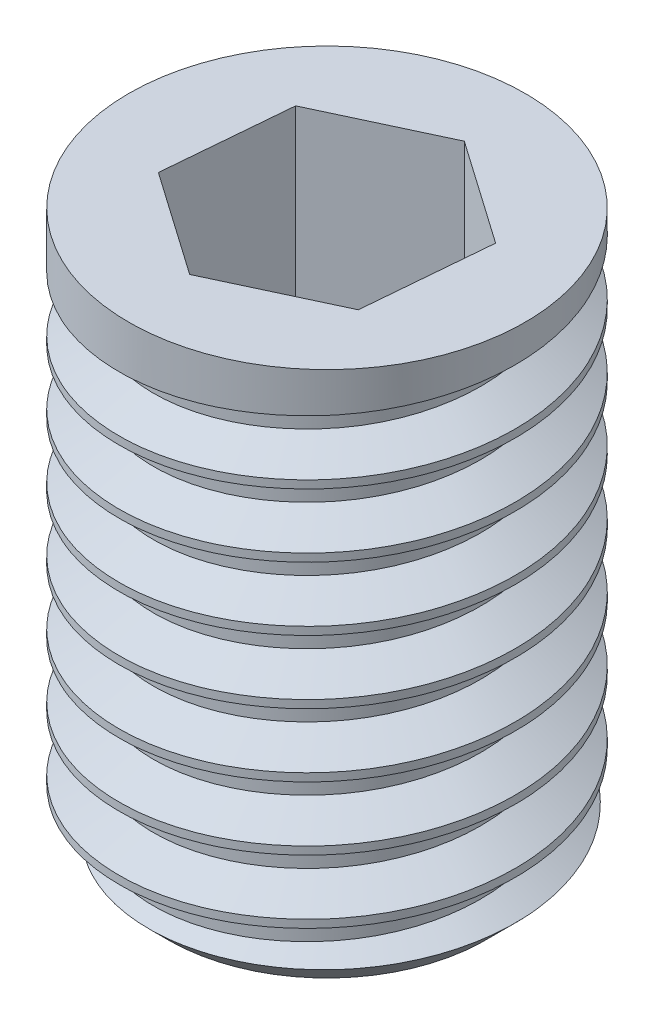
ISO-10303-21;
HEADER;
FILE_DESCRIPTION(('STEP AP214'),'2;1');
FILE_NAME('part.step','',(''),(''),'','','');
FILE_SCHEMA(('AUTOMOTIVE_DESIGN { 1 0 10303 214 1 1 1 1 }'));
ENDSEC;
DATA;
#1=APPLICATION_CONTEXT('core data for automotive mechanical design processes');
#2=APPLICATION_PROTOCOL_DEFINITION('international standard','automotive_design',2000,#1);
#3=PRODUCT_CONTEXT('',#1,'mechanical');
#4=PRODUCT('Part','Part','',(#3));
#5=PRODUCT_RELATED_PRODUCT_CATEGORY('part','',(#4));
#6=PRODUCT_DEFINITION_FORMATION('','',#4);
#7=PRODUCT_DEFINITION_CONTEXT('part definition',#1,'design');
#8=PRODUCT_DEFINITION('design','',#6,#7);
#9=PRODUCT_DEFINITION_SHAPE('','',#8);
#10=(LENGTH_UNIT() NAMED_UNIT(*) SI_UNIT(.MILLI.,.METRE.));
#11=(NAMED_UNIT(*) PLANE_ANGLE_UNIT() SI_UNIT($,.RADIAN.));
#12=(NAMED_UNIT(*) SI_UNIT($,.STERADIAN.) SOLID_ANGLE_UNIT());
#13=UNCERTAINTY_MEASURE_WITH_UNIT(LENGTH_MEASURE(1.E-05),#10,'distance_accuracy_value','');
#14=(GEOMETRIC_REPRESENTATION_CONTEXT(3) GLOBAL_UNCERTAINTY_ASSIGNED_CONTEXT((#13)) GLOBAL_UNIT_ASSIGNED_CONTEXT((#10,
#11,#12)) REPRESENTATION_CONTEXT('',''));
#15=CARTESIAN_POINT('',(0.,0.,0.));
#16=DIRECTION('',(0.,0.,1.));
#17=DIRECTION('',(1.,0.,0.));
#18=AXIS2_PLACEMENT_3D('',#15,#16,#17);
#19=CARTESIAN_POINT('',(0.,0.,0.266223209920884));
#20=DIRECTION('',(0.,1.,0.));
#21=DIRECTION('',(0.,0.,1.));
#22=AXIS2_PLACEMENT_3D('',#19,#20,#21);
#23=PLANE('',#22);
#24=CARTESIAN_POINT('',(0.,0.,0.266223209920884));
#25=DIRECTION('',(0.,1.,0.));
#26=DIRECTION('',(0.,0.,1.));
#27=AXIS2_PLACEMENT_3D('',#24,#25,#26);
#28=CIRCLE('',#27,2.);
#29=CARTESIAN_POINT('',(3.62013294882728E-08,0.,-1.73377679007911));
#30=VERTEX_POINT('',#29);
#31=EDGE_CURVE('E12',#30,#30,#28,.F.);
#32=ORIENTED_EDGE('',*,*,#31,.T.);
#33=EDGE_LOOP('',(#32));
#34=FACE_BOUND('',#33,.T.);
#35=ADVANCED_FACE('F38',(#34),#23,.F.);
#36=CARTESIAN_POINT('',(0.,7.,0.266223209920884));
#37=DIRECTION('',(0.,-1.,0.));
#38=DIRECTION('',(0.,0.,-1.));
#39=AXIS2_PLACEMENT_3D('',#36,#37,#38);
#40=CYLINDRICAL_SURFACE('',#39,2.5);
#41=CARTESIAN_POINT('',(-2.5,6.30000000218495,0.266223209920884));
#42=CARTESIAN_POINT('',(-2.5,6.25000000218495,-0.769310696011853));
#43=CARTESIAN_POINT('',(-1.76776695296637,6.20000000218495,-1.50154374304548));
#44=CARTESIAN_POINT('',(-1.03553390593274,6.15000000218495,-2.23377679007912));
#45=CARTESIAN_POINT('',(0.,6.10000000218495,-2.23377679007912));
#46=CARTESIAN_POINT('',(1.03553390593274,6.05000000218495,-2.23377679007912));
#47=CARTESIAN_POINT('',(1.76776695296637,6.00000000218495,-1.50154374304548));
#48=CARTESIAN_POINT('',(2.5,5.95000000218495,-0.769310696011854));
#49=CARTESIAN_POINT('',(2.5,5.90000000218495,0.266223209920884));
#50=CARTESIAN_POINT('',(2.5,5.85000000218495,1.30175711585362));
#51=CARTESIAN_POINT('',(1.76776695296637,5.80000000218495,2.03399016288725));
#52=CARTESIAN_POINT('',(1.03553390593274,5.75000000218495,2.76622320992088));
#53=CARTESIAN_POINT('',(0.,5.70000000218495,2.76622320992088));
#54=CARTESIAN_POINT('',(-1.03553390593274,5.65000000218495,2.76622320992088));
#55=CARTESIAN_POINT('',(-1.76776695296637,5.60000000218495,2.03399016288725));
#56=CARTESIAN_POINT('',(-2.5,5.55000000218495,1.30175711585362));
#57=CARTESIAN_POINT('',(-2.5,5.50000000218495,0.266223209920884));
#58=CARTESIAN_POINT('',(-2.5,5.45000000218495,-0.769310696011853));
#59=CARTESIAN_POINT('',(-1.76776695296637,5.40000000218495,-1.50154374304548));
#60=CARTESIAN_POINT('',(-1.03553390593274,5.35000000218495,-2.23377679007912));
#61=CARTESIAN_POINT('',(0.,5.30000000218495,-2.23377679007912));
#62=CARTESIAN_POINT('',(1.03553390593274,5.25000000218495,-2.23377679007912));
#63=CARTESIAN_POINT('',(1.76776695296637,5.20000000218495,-1.50154374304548));
#64=CARTESIAN_POINT('',(2.5,5.15000000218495,-0.769310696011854));
#65=CARTESIAN_POINT('',(2.5,5.10000000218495,0.266223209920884));
#66=CARTESIAN_POINT('',(2.5,5.05000000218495,1.30175711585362));
#67=CARTESIAN_POINT('',(1.76776695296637,5.00000000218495,2.03399016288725));
#68=CARTESIAN_POINT('',(1.03553390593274,4.95000000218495,2.76622320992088));
#69=CARTESIAN_POINT('',(0.,4.90000000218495,2.76622320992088));
#70=CARTESIAN_POINT('',(-1.03553390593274,4.85000000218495,2.76622320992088));
#71=CARTESIAN_POINT('',(-1.76776695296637,4.80000000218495,2.03399016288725));
#72=CARTESIAN_POINT('',(-2.5,4.75000000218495,1.30175711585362));
#73=CARTESIAN_POINT('',(-2.5,4.70000000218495,0.266223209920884));
#74=CARTESIAN_POINT('',(-2.5,4.65000000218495,-0.769310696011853));
#75=CARTESIAN_POINT('',(-1.76776695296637,4.60000000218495,-1.50154374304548));
#76=CARTESIAN_POINT('',(-1.03553390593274,4.55000000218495,-2.23377679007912));
#77=CARTESIAN_POINT('',(0.,4.50000000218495,-2.23377679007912));
#78=CARTESIAN_POINT('',(1.03553390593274,4.45000000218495,-2.23377679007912));
#79=CARTESIAN_POINT('',(1.76776695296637,4.40000000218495,-1.50154374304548));
#80=CARTESIAN_POINT('',(2.5,4.35000000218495,-0.769310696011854));
#81=CARTESIAN_POINT('',(2.5,4.30000000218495,0.266223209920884));
#82=CARTESIAN_POINT('',(2.5,4.25000000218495,1.30175711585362));
#83=CARTESIAN_POINT('',(1.76776695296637,4.20000000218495,2.03399016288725));
#84=CARTESIAN_POINT('',(1.03553390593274,4.15000000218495,2.76622320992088));
#85=CARTESIAN_POINT('',(0.,4.10000000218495,2.76622320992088));
#86=CARTESIAN_POINT('',(-1.03553390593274,4.05000000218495,2.76622320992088));
#87=CARTESIAN_POINT('',(-1.76776695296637,4.00000000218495,2.03399016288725));
#88=CARTESIAN_POINT('',(-2.5,3.95000000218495,1.30175711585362));
#89=CARTESIAN_POINT('',(-2.5,3.90000000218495,0.266223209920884));
#90=CARTESIAN_POINT('',(-2.5,3.85000000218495,-0.769310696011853));
#91=CARTESIAN_POINT('',(-1.76776695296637,3.80000000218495,-1.50154374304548));
#92=CARTESIAN_POINT('',(-1.03553390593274,3.75000000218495,-2.23377679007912));
#93=CARTESIAN_POINT('',(0.,3.70000000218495,-2.23377679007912));
#94=CARTESIAN_POINT('',(1.03553390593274,3.65000000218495,-2.23377679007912));
#95=CARTESIAN_POINT('',(1.76776695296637,3.60000000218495,-1.50154374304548));
#96=CARTESIAN_POINT('',(2.5,3.55000000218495,-0.769310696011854));
#97=CARTESIAN_POINT('',(2.5,3.50000000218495,0.266223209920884));
#98=CARTESIAN_POINT('',(2.5,3.45000000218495,1.30175711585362));
#99=CARTESIAN_POINT('',(1.76776695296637,3.40000000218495,2.03399016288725));
#100=CARTESIAN_POINT('',(1.03553390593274,3.35000000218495,2.76622320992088));
#101=CARTESIAN_POINT('',(0.,3.30000000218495,2.76622320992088));
#102=CARTESIAN_POINT('',(-1.03553390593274,3.25000000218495,2.76622320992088));
#103=CARTESIAN_POINT('',(-1.76776695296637,3.20000000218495,2.03399016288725));
#104=CARTESIAN_POINT('',(-2.5,3.15000000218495,1.30175711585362));
#105=CARTESIAN_POINT('',(-2.5,3.10000000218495,0.266223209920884));
#106=CARTESIAN_POINT('',(-2.5,3.05000000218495,-0.769310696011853));
#107=CARTESIAN_POINT('',(-1.76776695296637,3.00000000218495,-1.50154374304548));
#108=CARTESIAN_POINT('',(-1.03553390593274,2.95000000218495,-2.23377679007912));
#109=CARTESIAN_POINT('',(0.,2.90000000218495,-2.23377679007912));
#110=CARTESIAN_POINT('',(1.03553390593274,2.85000000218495,-2.23377679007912));
#111=CARTESIAN_POINT('',(1.76776695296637,2.80000000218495,-1.50154374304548));
#112=CARTESIAN_POINT('',(2.5,2.75000000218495,-0.769310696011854));
#113=CARTESIAN_POINT('',(2.5,2.70000000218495,0.266223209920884));
#114=CARTESIAN_POINT('',(2.5,2.65000000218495,1.30175711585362));
#115=CARTESIAN_POINT('',(1.76776695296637,2.60000000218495,2.03399016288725));
#116=CARTESIAN_POINT('',(1.03553390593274,2.55000000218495,2.76622320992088));
#117=CARTESIAN_POINT('',(0.,2.50000000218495,2.76622320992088));
#118=CARTESIAN_POINT('',(-1.03553390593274,2.45000000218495,2.76622320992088));
#119=CARTESIAN_POINT('',(-1.76776695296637,2.40000000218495,2.03399016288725));
#120=CARTESIAN_POINT('',(-2.5,2.35000000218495,1.30175711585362));
#121=CARTESIAN_POINT('',(-2.5,2.30000000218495,0.266223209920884));
#122=CARTESIAN_POINT('',(-2.5,2.25000000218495,-0.769310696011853));
#123=CARTESIAN_POINT('',(-1.76776695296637,2.20000000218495,-1.50154374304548));
#124=CARTESIAN_POINT('',(-1.03553390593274,2.15000000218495,-2.23377679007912));
#125=CARTESIAN_POINT('',(0.,2.10000000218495,-2.23377679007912));
#126=CARTESIAN_POINT('',(1.03553390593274,2.05000000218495,-2.23377679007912));
#127=CARTESIAN_POINT('',(1.76776695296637,2.00000000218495,-1.50154374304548));
#128=CARTESIAN_POINT('',(2.5,1.95000000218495,-0.769310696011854));
#129=CARTESIAN_POINT('',(2.5,1.90000000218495,0.266223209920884));
#130=CARTESIAN_POINT('',(2.5,1.85000000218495,1.30175711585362));
#131=CARTESIAN_POINT('',(1.76776695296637,1.80000000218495,2.03399016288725));
#132=CARTESIAN_POINT('',(1.03553390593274,1.75000000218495,2.76622320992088));
#133=CARTESIAN_POINT('',(0.,1.70000000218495,2.76622320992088));
#134=CARTESIAN_POINT('',(-1.03553390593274,1.65000000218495,2.76622320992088));
#135=CARTESIAN_POINT('',(-1.76776695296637,1.60000000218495,2.03399016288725));
#136=CARTESIAN_POINT('',(-2.5,1.55000000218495,1.30175711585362));
#137=CARTESIAN_POINT('',(-2.5,1.50000000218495,0.266223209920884));
#138=CARTESIAN_POINT('',(-2.5,1.45000000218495,-0.769310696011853));
#139=CARTESIAN_POINT('',(-1.76776695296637,1.40000000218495,-1.50154374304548));
#140=CARTESIAN_POINT('',(-1.03553390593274,1.35000000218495,-2.23377679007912));
#141=CARTESIAN_POINT('',(0.,1.30000000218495,-2.23377679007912));
#142=CARTESIAN_POINT('',(1.03553390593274,1.25000000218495,-2.23377679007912));
#143=CARTESIAN_POINT('',(1.76776695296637,1.20000000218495,-1.50154374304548));
#144=CARTESIAN_POINT('',(2.5,1.15000000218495,-0.769310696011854));
#145=CARTESIAN_POINT('',(2.5,1.10000000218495,0.266223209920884));
#146=CARTESIAN_POINT('',(2.5,1.05000000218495,1.30175711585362));
#147=CARTESIAN_POINT('',(1.76776695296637,1.00000000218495,2.03399016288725));
#148=CARTESIAN_POINT('',(1.03553390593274,0.950000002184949,2.76622320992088));
#149=CARTESIAN_POINT('',(0.,0.900000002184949,2.76622320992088));
#150=CARTESIAN_POINT('',(-1.03553390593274,0.850000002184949,2.76622320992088));
#151=CARTESIAN_POINT('',(-1.76776695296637,0.800000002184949,2.03399016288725));
#152=CARTESIAN_POINT('',(-2.5,0.750000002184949,1.30175711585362));
#153=CARTESIAN_POINT('',(-2.5,0.700000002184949,0.266223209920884));
#154=CARTESIAN_POINT('',(-2.5,0.650000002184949,-0.769310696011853));
#155=CARTESIAN_POINT('',(-1.76776695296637,0.600000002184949,-1.50154374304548));
#156=CARTESIAN_POINT('',(-1.03553390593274,0.550000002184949,-2.23377679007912));
#157=CARTESIAN_POINT('',(0.,0.500000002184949,-2.23377679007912));
#158=CARTESIAN_POINT('',(1.03553390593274,0.450000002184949,-2.23377679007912));
#159=CARTESIAN_POINT('',(1.76776695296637,0.400000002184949,-1.50154374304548));
#160=CARTESIAN_POINT('',(2.5,0.350000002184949,-0.769310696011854));
#161=CARTESIAN_POINT('',(2.5,0.300000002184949,0.266223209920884));
#162=CARTESIAN_POINT('',(2.5,0.250000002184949,1.30175711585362));
#163=CARTESIAN_POINT('',(1.76776695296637,0.200000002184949,2.03399016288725));
#164=CARTESIAN_POINT('',(1.03553390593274,0.150000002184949,2.76622320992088));
#165=CARTESIAN_POINT('',(0.,0.100000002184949,2.76622320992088));
#166=CARTESIAN_POINT('',(-1.03553390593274,0.050000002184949,2.76622320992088));
#167=CARTESIAN_POINT('',(-1.76776695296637,2.18494927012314E-09,2.03399016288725));
#168=CARTESIAN_POINT('',(-2.5,-0.0499999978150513,1.30175711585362));
#169=CARTESIAN_POINT('',(-2.5,-0.099999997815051,0.266223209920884));
#170=CARTESIAN_POINT('',(-2.5,-0.149999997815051,-0.769310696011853));
#171=CARTESIAN_POINT('',(-1.76776695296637,-0.199999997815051,-1.50154374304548));
#172=(BOUNDED_CURVE() B_SPLINE_CURVE(2,(#41,#42,#43,#44,#45,#46,#47,#48,#49,#50,#51,#52,#53,#54,
#55,#56,#57,#58,#59,#60,#61,#62,#63,#64,#65,#66,#67,#68,#69,#70,#71,#72,#73,#74,#75,#76,#77,#78,
#79,#80,#81,#82,#83,#84,#85,#86,#87,#88,#89,#90,#91,#92,#93,#94,#95,#96,#97,#98,#99,#100,#101,
#102,#103,#104,#105,#106,#107,#108,#109,#110,#111,#112,#113,#114,#115,#116,#117,#118,#119,#120,
#121,#122,#123,#124,#125,#126,#127,#128,#129,#130,#131,#132,#133,#134,#135,#136,#137,#138,#139,
#140,#141,#142,#143,#144,#145,#146,#147,#148,#149,#150,#151,#152,#153,#154,#155,#156,#157,#158,
#159,#160,#161,#162,#163,#164,#165,#166,#167,#168,#169,#170,#171),.UNSPECIFIED.,.F.,
.F.) B_SPLINE_CURVE_WITH_KNOTS((3,2,2,2,2,2,2,2,2,2,2,2,2,2,2,2,2,2,2,2,2,2,2,2,2,2,2,2,2,2,2,2,
2,2,2,2,2,2,2,2,2,2,2,2,2,2,2,2,2,2,2,2,2,2,2,2,2,2,2,2,2,2,2,2,2,3),(0.,0.0138888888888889,
0.0277777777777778,0.0416666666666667,0.0555555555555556,0.0694444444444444,0.0833333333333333,
0.0972222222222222,0.111111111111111,0.125,0.138888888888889,0.152777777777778,
0.166666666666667,0.180555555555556,0.194444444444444,0.208333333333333,0.222222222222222,
0.236111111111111,0.25,0.263888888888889,0.277777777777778,0.291666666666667,0.305555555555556,
0.319444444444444,0.333333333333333,0.347222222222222,0.361111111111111,0.375,0.388888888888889,
0.402777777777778,0.416666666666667,0.430555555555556,0.444444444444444,0.458333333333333,
0.472222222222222,0.486111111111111,0.5,0.513888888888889,0.527777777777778,0.541666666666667,
0.555555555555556,0.569444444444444,0.583333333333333,0.597222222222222,0.611111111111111,0.625,
0.638888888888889,0.652777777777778,0.666666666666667,0.680555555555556,0.694444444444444,
0.708333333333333,0.722222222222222,0.736111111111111,0.75,0.763888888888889,0.777777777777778,
0.791666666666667,0.805555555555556,0.819444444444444,0.833333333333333,0.847222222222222,
0.861111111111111,0.875,0.888888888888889,0.902777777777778),
.UNSPECIFIED.) CURVE() GEOMETRIC_REPRESENTATION_ITEM() RATIONAL_B_SPLINE_CURVE((1.,
0.923879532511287,1.,0.923879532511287,1.,0.923879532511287,1.,0.923879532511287,1.,
0.923879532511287,1.,0.923879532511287,1.,0.923879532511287,1.,0.923879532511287,1.,
0.923879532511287,1.,0.923879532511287,1.,0.923879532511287,1.,0.923879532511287,1.,
0.923879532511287,1.,0.923879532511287,1.,0.923879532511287,1.,0.923879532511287,1.,
0.923879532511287,1.,0.923879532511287,1.,0.923879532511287,1.,0.923879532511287,1.,
0.923879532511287,1.,0.923879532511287,1.,0.923879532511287,1.,0.923879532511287,1.,
0.923879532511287,1.,0.923879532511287,1.,0.923879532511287,1.,0.923879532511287,1.,
0.923879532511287,1.,0.923879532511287,1.,0.923879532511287,1.,0.923879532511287,1.,
0.923879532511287,1.,0.923879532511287,1.,0.923879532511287,1.,0.923879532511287,1.,
0.923879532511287,1.,0.923879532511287,1.,0.923879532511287,1.,0.923879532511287,1.,
0.923879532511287,1.,0.923879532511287,1.,0.923879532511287,1.,0.923879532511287,1.,
0.923879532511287,1.,0.923879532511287,1.,0.923879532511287,1.,0.923879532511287,1.,
0.923879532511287,1.,0.923879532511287,1.,0.923879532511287,1.,0.923879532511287,1.,
0.923879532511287,1.,0.923879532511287,1.,0.923879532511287,1.,0.923879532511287,1.,
0.923879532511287,1.,0.923879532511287,1.,0.923879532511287,1.,0.923879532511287,1.,
0.923879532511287,1.,0.923879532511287,1.,0.923879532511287,1.,0.923879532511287,1.,
0.923879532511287,1.)) REPRESENTATION_ITEM(''));
#173=CARTESIAN_POINT('',(-2.5,6.30000000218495,0.266223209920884));
#174=VERTEX_POINT('',#173);
#175=CARTESIAN_POINT('',(4.52393645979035E-08,0.500000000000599,-2.23377679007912));
#176=VERTEX_POINT('',#175);
#177=EDGE_CURVE('E120',#174,#176,#172,.T.);
#178=ORIENTED_EDGE('',*,*,#177,.T.);
#179=CARTESIAN_POINT('',(0.,0.500000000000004,0.266223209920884));
#180=DIRECTION('',(0.,1.,0.));
#181=DIRECTION('',(0.,0.,1.));
#182=AXIS2_PLACEMENT_3D('',#179,#180,#181);
#183=CIRCLE('',#182,2.5);
#184=CARTESIAN_POINT('',(-1.76776695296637,0.5,-1.50154374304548));
#185=VERTEX_POINT('',#184);
#186=EDGE_CURVE('E158',#176,#185,#183,.T.);
#187=ORIENTED_EDGE('',*,*,#186,.T.);
#188=CARTESIAN_POINT('',(-2.5,7.,0.266223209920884));
#189=CARTESIAN_POINT('',(-2.5,6.95,-0.769310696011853));
#190=CARTESIAN_POINT('',(-1.76776695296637,6.9,-1.50154374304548));
#191=CARTESIAN_POINT('',(-1.03553390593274,6.85,-2.23377679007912));
#192=CARTESIAN_POINT('',(0.,6.8,-2.23377679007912));
#193=CARTESIAN_POINT('',(1.03553390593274,6.75,-2.23377679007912));
#194=CARTESIAN_POINT('',(1.76776695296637,6.7,-1.50154374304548));
#195=CARTESIAN_POINT('',(2.5,6.65,-0.769310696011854));
#196=CARTESIAN_POINT('',(2.5,6.6,0.266223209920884));
#197=CARTESIAN_POINT('',(2.5,6.55,1.30175711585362));
#198=CARTESIAN_POINT('',(1.76776695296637,6.5,2.03399016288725));
#199=CARTESIAN_POINT('',(1.03553390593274,6.45,2.76622320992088));
#200=CARTESIAN_POINT('',(0.,6.4,2.76622320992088));
#201=CARTESIAN_POINT('',(-1.03553390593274,6.35,2.76622320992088));
#202=CARTESIAN_POINT('',(-1.76776695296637,6.3,2.03399016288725));
#203=CARTESIAN_POINT('',(-2.5,6.25,1.30175711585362));
#204=CARTESIAN_POINT('',(-2.5,6.2,0.266223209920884));
#205=CARTESIAN_POINT('',(-2.5,6.15,-0.769310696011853));
#206=CARTESIAN_POINT('',(-1.76776695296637,6.1,-1.50154374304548));
#207=CARTESIAN_POINT('',(-1.03553390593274,6.05,-2.23377679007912));
#208=CARTESIAN_POINT('',(0.,6.,-2.23377679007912));
#209=CARTESIAN_POINT('',(1.03553390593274,5.95,-2.23377679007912));
#210=CARTESIAN_POINT('',(1.76776695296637,5.9,-1.50154374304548));
#211=CARTESIAN_POINT('',(2.5,5.85,-0.769310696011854));
#212=CARTESIAN_POINT('',(2.5,5.8,0.266223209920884));
#213=CARTESIAN_POINT('',(2.5,5.75,1.30175711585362));
#214=CARTESIAN_POINT('',(1.76776695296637,5.7,2.03399016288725));
#215=CARTESIAN_POINT('',(1.03553390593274,5.65,2.76622320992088));
#216=CARTESIAN_POINT('',(0.,5.6,2.76622320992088));
#217=CARTESIAN_POINT('',(-1.03553390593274,5.55,2.76622320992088));
#218=CARTESIAN_POINT('',(-1.76776695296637,5.5,2.03399016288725));
#219=CARTESIAN_POINT('',(-2.5,5.45,1.30175711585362));
#220=CARTESIAN_POINT('',(-2.5,5.4,0.266223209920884));
#221=CARTESIAN_POINT('',(-2.5,5.35,-0.769310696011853));
#222=CARTESIAN_POINT('',(-1.76776695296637,5.3,-1.50154374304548));
#223=CARTESIAN_POINT('',(-1.03553390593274,5.25,-2.23377679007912));
#224=CARTESIAN_POINT('',(0.,5.2,-2.23377679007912));
#225=CARTESIAN_POINT('',(1.03553390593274,5.15,-2.23377679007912));
#226=CARTESIAN_POINT('',(1.76776695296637,5.1,-1.50154374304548));
#227=CARTESIAN_POINT('',(2.5,5.05,-0.769310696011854));
#228=CARTESIAN_POINT('',(2.5,5.,0.266223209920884));
#229=CARTESIAN_POINT('',(2.5,4.95,1.30175711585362));
#230=CARTESIAN_POINT('',(1.76776695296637,4.9,2.03399016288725));
#231=CARTESIAN_POINT('',(1.03553390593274,4.85,2.76622320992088));
#232=CARTESIAN_POINT('',(0.,4.8,2.76622320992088));
#233=CARTESIAN_POINT('',(-1.03553390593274,4.75,2.76622320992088));
#234=CARTESIAN_POINT('',(-1.76776695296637,4.7,2.03399016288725));
#235=CARTESIAN_POINT('',(-2.5,4.65,1.30175711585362));
#236=CARTESIAN_POINT('',(-2.5,4.6,0.266223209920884));
#237=CARTESIAN_POINT('',(-2.5,4.55,-0.769310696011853));
#238=CARTESIAN_POINT('',(-1.76776695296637,4.5,-1.50154374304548));
#239=CARTESIAN_POINT('',(-1.03553390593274,4.45,-2.23377679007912));
#240=CARTESIAN_POINT('',(0.,4.4,-2.23377679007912));
#241=CARTESIAN_POINT('',(1.03553390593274,4.35,-2.23377679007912));
#242=CARTESIAN_POINT('',(1.76776695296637,4.3,-1.50154374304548));
#243=CARTESIAN_POINT('',(2.5,4.25,-0.769310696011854));
#244=CARTESIAN_POINT('',(2.5,4.2,0.266223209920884));
#245=CARTESIAN_POINT('',(2.5,4.15,1.30175711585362));
#246=CARTESIAN_POINT('',(1.76776695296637,4.1,2.03399016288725));
#247=CARTESIAN_POINT('',(1.03553390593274,4.05,2.76622320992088));
#248=CARTESIAN_POINT('',(0.,4.,2.76622320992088));
#249=CARTESIAN_POINT('',(-1.03553390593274,3.95,2.76622320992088));
#250=CARTESIAN_POINT('',(-1.76776695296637,3.9,2.03399016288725));
#251=CARTESIAN_POINT('',(-2.5,3.85,1.30175711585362));
#252=CARTESIAN_POINT('',(-2.5,3.8,0.266223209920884));
#253=CARTESIAN_POINT('',(-2.5,3.75,-0.769310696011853));
#254=CARTESIAN_POINT('',(-1.76776695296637,3.7,-1.50154374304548));
#255=CARTESIAN_POINT('',(-1.03553390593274,3.65,-2.23377679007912));
#256=CARTESIAN_POINT('',(0.,3.6,-2.23377679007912));
#257=CARTESIAN_POINT('',(1.03553390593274,3.55,-2.23377679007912));
#258=CARTESIAN_POINT('',(1.76776695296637,3.5,-1.50154374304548));
#259=CARTESIAN_POINT('',(2.5,3.45,-0.769310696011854));
#260=CARTESIAN_POINT('',(2.5,3.4,0.266223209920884));
#261=CARTESIAN_POINT('',(2.5,3.35,1.30175711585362));
#262=CARTESIAN_POINT('',(1.76776695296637,3.3,2.03399016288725));
#263=CARTESIAN_POINT('',(1.03553390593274,3.25,2.76622320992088));
#264=CARTESIAN_POINT('',(0.,3.2,2.76622320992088));
#265=CARTESIAN_POINT('',(-1.03553390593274,3.15,2.76622320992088));
#266=CARTESIAN_POINT('',(-1.76776695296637,3.1,2.03399016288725));
#267=CARTESIAN_POINT('',(-2.5,3.05,1.30175711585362));
#268=CARTESIAN_POINT('',(-2.5,3.,0.266223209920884));
#269=CARTESIAN_POINT('',(-2.5,2.95,-0.769310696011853));
#270=CARTESIAN_POINT('',(-1.76776695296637,2.9,-1.50154374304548));
#271=CARTESIAN_POINT('',(-1.03553390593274,2.85,-2.23377679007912));
#272=CARTESIAN_POINT('',(0.,2.8,-2.23377679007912));
#273=CARTESIAN_POINT('',(1.03553390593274,2.75,-2.23377679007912));
#274=CARTESIAN_POINT('',(1.76776695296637,2.7,-1.50154374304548));
#275=CARTESIAN_POINT('',(2.5,2.65,-0.769310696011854));
#276=CARTESIAN_POINT('',(2.5,2.6,0.266223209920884));
#277=CARTESIAN_POINT('',(2.5,2.55,1.30175711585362));
#278=CARTESIAN_POINT('',(1.76776695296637,2.5,2.03399016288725));
#279=CARTESIAN_POINT('',(1.03553390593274,2.45,2.76622320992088));
#280=CARTESIAN_POINT('',(0.,2.4,2.76622320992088));
#281=CARTESIAN_POINT('',(-1.03553390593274,2.35,2.76622320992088));
#282=CARTESIAN_POINT('',(-1.76776695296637,2.3,2.03399016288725));
#283=CARTESIAN_POINT('',(-2.5,2.25,1.30175711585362));
#284=CARTESIAN_POINT('',(-2.5,2.2,0.266223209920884));
#285=CARTESIAN_POINT('',(-2.5,2.15,-0.769310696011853));
#286=CARTESIAN_POINT('',(-1.76776695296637,2.1,-1.50154374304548));
#287=CARTESIAN_POINT('',(-1.03553390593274,2.05,-2.23377679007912));
#288=CARTESIAN_POINT('',(0.,2.,-2.23377679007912));
#289=CARTESIAN_POINT('',(1.03553390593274,1.95,-2.23377679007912));
#290=CARTESIAN_POINT('',(1.76776695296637,1.9,-1.50154374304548));
#291=CARTESIAN_POINT('',(2.5,1.85,-0.769310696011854));
#292=CARTESIAN_POINT('',(2.5,1.8,0.266223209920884));
#293=CARTESIAN_POINT('',(2.5,1.75,1.30175711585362));
#294=CARTESIAN_POINT('',(1.76776695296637,1.7,2.03399016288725));
#295=CARTESIAN_POINT('',(1.03553390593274,1.65,2.76622320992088));
#296=CARTESIAN_POINT('',(0.,1.6,2.76622320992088));
#297=CARTESIAN_POINT('',(-1.03553390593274,1.55,2.76622320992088));
#298=CARTESIAN_POINT('',(-1.76776695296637,1.5,2.03399016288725));
#299=CARTESIAN_POINT('',(-2.5,1.45,1.30175711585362));
#300=CARTESIAN_POINT('',(-2.5,1.4,0.266223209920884));
#301=CARTESIAN_POINT('',(-2.5,1.35,-0.769310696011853));
#302=CARTESIAN_POINT('',(-1.76776695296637,1.3,-1.50154374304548));
#303=CARTESIAN_POINT('',(-1.03553390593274,1.25,-2.23377679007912));
#304=CARTESIAN_POINT('',(0.,1.2,-2.23377679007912));
#305=CARTESIAN_POINT('',(1.03553390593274,1.15,-2.23377679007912));
#306=CARTESIAN_POINT('',(1.76776695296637,1.1,-1.50154374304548));
#307=CARTESIAN_POINT('',(2.5,1.05,-0.769310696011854));
#308=CARTESIAN_POINT('',(2.5,1.,0.266223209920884));
#309=CARTESIAN_POINT('',(2.5,0.95,1.30175711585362));
#310=CARTESIAN_POINT('',(1.76776695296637,0.9,2.03399016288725));
#311=CARTESIAN_POINT('',(1.03553390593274,0.85,2.76622320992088));
#312=CARTESIAN_POINT('',(0.,0.799999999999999,2.76622320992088));
#313=CARTESIAN_POINT('',(-1.03553390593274,0.75,2.76622320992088));
#314=CARTESIAN_POINT('',(-1.76776695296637,0.7,2.03399016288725));
#315=CARTESIAN_POINT('',(-2.5,0.65,1.30175711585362));
#316=CARTESIAN_POINT('',(-2.5,0.6,0.266223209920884));
#317=CARTESIAN_POINT('',(-2.5,0.55,-0.769310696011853));
#318=CARTESIAN_POINT('',(-1.76776695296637,0.5,-1.50154374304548));
#319=(BOUNDED_CURVE() B_SPLINE_CURVE(2,(#188,#189,#190,#191,#192,#193,#194,#195,#196,#197,#198,
#199,#200,#201,#202,#203,#204,#205,#206,#207,#208,#209,#210,#211,#212,#213,#214,#215,#216,#217,
#218,#219,#220,#221,#222,#223,#224,#225,#226,#227,#228,#229,#230,#231,#232,#233,#234,#235,#236,
#237,#238,#239,#240,#241,#242,#243,#244,#245,#246,#247,#248,#249,#250,#251,#252,#253,#254,#255,
#256,#257,#258,#259,#260,#261,#262,#263,#264,#265,#266,#267,#268,#269,#270,#271,#272,#273,#274,
#275,#276,#277,#278,#279,#280,#281,#282,#283,#284,#285,#286,#287,#288,#289,#290,#291,#292,#293,
#294,#295,#296,#297,#298,#299,#300,#301,#302,#303,#304,#305,#306,#307,#308,#309,#310,#311,#312,
#313,#314,#315,#316,#317,#318),.UNSPECIFIED.,.F.,.F.) B_SPLINE_CURVE_WITH_KNOTS((3,2,2,2,2,2,2,
2,2,2,2,2,2,2,2,2,2,2,2,2,2,2,2,2,2,2,2,2,2,2,2,2,2,2,2,2,2,2,2,2,2,2,2,2,2,2,2,2,2,2,2,2,2,2,2,
2,2,2,2,2,2,2,2,2,2,3),(0.,0.0138888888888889,0.0277777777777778,0.0416666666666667,
0.0555555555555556,0.0694444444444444,0.0833333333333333,0.0972222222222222,0.111111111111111,
0.125,0.138888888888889,0.152777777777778,0.166666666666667,0.180555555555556,0.194444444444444,
0.208333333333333,0.222222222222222,0.236111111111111,0.25,0.263888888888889,0.277777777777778,
0.291666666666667,0.305555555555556,0.319444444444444,0.333333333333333,0.347222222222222,
0.361111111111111,0.375,0.388888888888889,0.402777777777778,0.416666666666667,0.430555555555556,
0.444444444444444,0.458333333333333,0.472222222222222,0.486111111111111,0.5,0.513888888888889,
0.527777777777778,0.541666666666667,0.555555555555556,0.569444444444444,0.583333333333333,
0.597222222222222,0.611111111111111,0.625,0.638888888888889,0.652777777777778,0.666666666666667,
0.680555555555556,0.694444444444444,0.708333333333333,0.722222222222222,0.736111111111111,0.75,
0.763888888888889,0.777777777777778,0.791666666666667,0.805555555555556,0.819444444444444,
0.833333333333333,0.847222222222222,0.861111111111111,0.875,0.888888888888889,
0.902777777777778),
.UNSPECIFIED.) CURVE() GEOMETRIC_REPRESENTATION_ITEM() RATIONAL_B_SPLINE_CURVE((1.,
0.923879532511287,1.,0.923879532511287,1.,0.923879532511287,1.,0.923879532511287,1.,
0.923879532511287,1.,0.923879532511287,1.,0.923879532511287,1.,0.923879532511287,1.,
0.923879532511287,1.,0.923879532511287,1.,0.923879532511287,1.,0.923879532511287,1.,
0.923879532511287,1.,0.923879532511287,1.,0.923879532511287,1.,0.923879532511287,1.,
0.923879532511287,1.,0.923879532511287,1.,0.923879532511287,1.,0.923879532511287,1.,
0.923879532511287,1.,0.923879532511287,1.,0.923879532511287,1.,0.923879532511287,1.,
0.923879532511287,1.,0.923879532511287,1.,0.923879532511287,1.,0.923879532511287,1.,
0.923879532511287,1.,0.923879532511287,1.,0.923879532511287,1.,0.923879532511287,1.,
0.923879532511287,1.,0.923879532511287,1.,0.923879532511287,1.,0.923879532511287,1.,
0.923879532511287,1.,0.923879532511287,1.,0.923879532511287,1.,0.923879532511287,1.,
0.923879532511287,1.,0.923879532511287,1.,0.923879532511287,1.,0.923879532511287,1.,
0.923879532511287,1.,0.923879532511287,1.,0.923879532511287,1.,0.923879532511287,1.,
0.923879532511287,1.,0.923879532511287,1.,0.923879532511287,1.,0.923879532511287,1.,
0.923879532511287,1.,0.923879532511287,1.,0.923879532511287,1.,0.923879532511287,1.,
0.923879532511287,1.,0.923879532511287,1.,0.923879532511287,1.,0.923879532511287,1.,
0.923879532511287,1.,0.923879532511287,1.,0.923879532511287,1.,0.923879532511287,1.,
0.923879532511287,1.)) REPRESENTATION_ITEM(''));
#320=CARTESIAN_POINT('',(-2.5,7.,0.266223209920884));
#321=VERTEX_POINT('',#320);
#322=EDGE_CURVE('E129',#321,#185,#319,.T.);
#323=ORIENTED_EDGE('',*,*,#322,.F.);
#324=CARTESIAN_POINT('',(0.,7.,0.266223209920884));
#325=DIRECTION('',(0.,1.,0.));
#326=DIRECTION('',(0.,0.,1.));
#327=AXIS2_PLACEMENT_3D('',#324,#325,#326);
#328=CIRCLE('',#327,2.5);
#329=EDGE_CURVE('E144',#321,#321,#328,.T.);
#330=ORIENTED_EDGE('',*,*,#329,.F.);
#331=DIRECTION('',(0.,-1.,0.));
#332=VECTOR('',#331,1.);
#333=CARTESIAN_POINT('',(-2.5,6.65000000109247,0.266223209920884));
#334=LINE('',#333,#332);
#335=EDGE_CURVE('E130',#321,#174,#334,.T.);
#336=ORIENTED_EDGE('',*,*,#335,.T.);
#337=EDGE_LOOP('',(#178,#187,#323,#330,#336));
#338=FACE_BOUND('',#337,.T.);
#339=ADVANCED_FACE('F141',(#338),#40,.T.);
#340=CARTESIAN_POINT('',(0.,7.,0.266223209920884));
#341=DIRECTION('',(0.,1.,0.));
#342=DIRECTION('',(0.,0.,1.));
#343=AXIS2_PLACEMENT_3D('',#340,#341,#342);
#344=PLANE('',#343);
#345=DIRECTION('',(0.905906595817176,0.,-0.423477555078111));
#346=VECTOR('',#345,1.);
#347=CARTESIAN_POINT('',(-0.137937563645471,7.,1.86026625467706));
#348=LINE('',#347,#346);
#349=CARTESIAN_POINT('',(-0.137937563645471,7.,1.86026625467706));
#350=VERTEX_POINT('',#349);
#351=CARTESIAN_POINT('',(1.31151298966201,7.,1.18270216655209));
#352=VERTEX_POINT('',#351);
#353=EDGE_CURVE('E308',#350,#352,#348,.T.);
#354=ORIENTED_EDGE('',*,*,#353,.F.);
#355=DIRECTION('',(0.819695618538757,0.,0.572799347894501));
#356=VECTOR('',#355,1.);
#357=CARTESIAN_POINT('',(-1.44945055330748,7.,0.943787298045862));
#358=LINE('',#357,#356);
#359=CARTESIAN_POINT('',(-1.44945055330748,7.,0.943787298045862));
#360=VERTEX_POINT('',#359);
#361=EDGE_CURVE('E292',#360,#350,#358,.T.);
#362=ORIENTED_EDGE('',*,*,#361,.F.);
#363=DIRECTION('',(-0.0862109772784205,0.,0.996276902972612));
#364=VECTOR('',#363,1.);
#365=CARTESIAN_POINT('',(-1.31151298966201,7.,-0.650255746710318));
#366=LINE('',#365,#364);
#367=CARTESIAN_POINT('',(-1.31151298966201,7.,-0.650255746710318));
#368=VERTEX_POINT('',#367);
#369=EDGE_CURVE('E319',#368,#360,#366,.T.);
#370=ORIENTED_EDGE('',*,*,#369,.F.);
#371=DIRECTION('',(-0.905906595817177,0.,0.423477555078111));
#372=VECTOR('',#371,1.);
#373=CARTESIAN_POINT('',(0.137937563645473,7.,-1.3278198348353));
#374=LINE('',#373,#372);
#375=CARTESIAN_POINT('',(0.137937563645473,7.,-1.3278198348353));
#376=VERTEX_POINT('',#375);
#377=EDGE_CURVE('E316',#376,#368,#374,.T.);
#378=ORIENTED_EDGE('',*,*,#377,.F.);
#379=DIRECTION('',(-0.819695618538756,0.,-0.572799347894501));
#380=VECTOR('',#379,1.);
#381=CARTESIAN_POINT('',(1.44945055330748,7.,-0.411340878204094));
#382=LINE('',#381,#380);
#383=CARTESIAN_POINT('',(1.44945055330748,7.,-0.411340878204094));
#384=VERTEX_POINT('',#383);
#385=EDGE_CURVE('E313',#384,#376,#382,.T.);
#386=ORIENTED_EDGE('',*,*,#385,.F.);
#387=DIRECTION('',(0.0862109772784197,0.,-0.996276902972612));
#388=VECTOR('',#387,1.);
#389=CARTESIAN_POINT('',(1.31151298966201,7.,1.18270216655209));
#390=LINE('',#389,#388);
#391=EDGE_CURVE('E310',#352,#384,#390,.T.);
#392=ORIENTED_EDGE('',*,*,#391,.F.);
#393=EDGE_LOOP('',(#354,#362,#370,#378,#386,#392));
#394=FACE_BOUND('',#393,.T.);
#395=ORIENTED_EDGE('',*,*,#329,.T.);
#396=EDGE_LOOP('',(#395));
#397=FACE_BOUND('',#396,.T.);
#398=ADVANCED_FACE('F336',(#394,#397),#344,.T.);
#399=CARTESIAN_POINT('',(-0.137937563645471,4.,1.86026625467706));
#400=DIRECTION('',(0.423477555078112,0.,0.905906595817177));
#401=DIRECTION('',(0.905906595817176,0.,-0.423477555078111));
#402=AXIS2_PLACEMENT_3D('',#399,#400,#401);
#403=PLANE('',#402);
#404=ORIENTED_EDGE('',*,*,#353,.T.);
#405=DIRECTION('',(0.,1.,0.));
#406=VECTOR('',#405,1.);
#407=CARTESIAN_POINT('',(1.31151298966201,4.,1.18270216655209));
#408=LINE('',#407,#406);
#409=CARTESIAN_POINT('',(1.31151298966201,4.,1.18270216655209));
#410=VERTEX_POINT('',#409);
#411=EDGE_CURVE('E307',#410,#352,#408,.T.);
#412=ORIENTED_EDGE('',*,*,#411,.F.);
#413=DIRECTION('',(0.905906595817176,0.,-0.423477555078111));
#414=VECTOR('',#413,1.);
#415=CARTESIAN_POINT('',(-0.137937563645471,4.,1.86026625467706));
#416=LINE('',#415,#414);
#417=CARTESIAN_POINT('',(-0.137937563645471,4.,1.86026625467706));
#418=VERTEX_POINT('',#417);
#419=EDGE_CURVE('E288',#418,#410,#416,.T.);
#420=ORIENTED_EDGE('',*,*,#419,.F.);
#421=DIRECTION('',(0.,1.,0.));
#422=VECTOR('',#421,1.);
#423=CARTESIAN_POINT('',(-0.137937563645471,4.,1.86026625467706));
#424=LINE('',#423,#422);
#425=EDGE_CURVE('E324',#418,#350,#424,.T.);
#426=ORIENTED_EDGE('',*,*,#425,.T.);
#427=EDGE_LOOP('',(#404,#412,#420,#426));
#428=FACE_BOUND('',#427,.T.);
#429=ADVANCED_FACE('F338',(#428),#403,.F.);
#430=CARTESIAN_POINT('',(-1.44945055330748,4.,0.943787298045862));
#431=DIRECTION('',(-0.572799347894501,0.,0.819695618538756));
#432=DIRECTION('',(0.819695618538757,0.,0.572799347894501));
#433=AXIS2_PLACEMENT_3D('',#430,#431,#432);
#434=PLANE('',#433);
#435=ORIENTED_EDGE('',*,*,#361,.T.);
#436=ORIENTED_EDGE('',*,*,#425,.F.);
#437=DIRECTION('',(0.819695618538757,0.,0.572799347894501));
#438=VECTOR('',#437,1.);
#439=CARTESIAN_POINT('',(-1.44945055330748,4.,0.943787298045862));
#440=LINE('',#439,#438);
#441=CARTESIAN_POINT('',(-1.44945055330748,4.,0.943787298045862));
#442=VERTEX_POINT('',#441);
#443=EDGE_CURVE('E304',#442,#418,#440,.T.);
#444=ORIENTED_EDGE('',*,*,#443,.F.);
#445=DIRECTION('',(0.,1.,0.));
#446=VECTOR('',#445,1.);
#447=CARTESIAN_POINT('',(-1.44945055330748,4.,0.943787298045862));
#448=LINE('',#447,#446);
#449=EDGE_CURVE('E326',#442,#360,#448,.T.);
#450=ORIENTED_EDGE('',*,*,#449,.T.);
#451=EDGE_LOOP('',(#435,#436,#444,#450));
#452=FACE_BOUND('',#451,.T.);
#453=ADVANCED_FACE('F345',(#452),#434,.F.);
#454=CARTESIAN_POINT('',(-1.31151298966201,4.,-0.650255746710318));
#455=DIRECTION('',(-0.996276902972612,0.,-0.0862109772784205));
#456=DIRECTION('',(-0.0862109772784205,0.,0.996276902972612));
#457=AXIS2_PLACEMENT_3D('',#454,#455,#456);
#458=PLANE('',#457);
#459=ORIENTED_EDGE('',*,*,#369,.T.);
#460=ORIENTED_EDGE('',*,*,#449,.F.);
#461=DIRECTION('',(-0.0862109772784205,0.,0.996276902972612));
#462=VECTOR('',#461,1.);
#463=CARTESIAN_POINT('',(-1.31151298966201,4.,-0.650255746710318));
#464=LINE('',#463,#462);
#465=CARTESIAN_POINT('',(-1.31151298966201,4.,-0.650255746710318));
#466=VERTEX_POINT('',#465);
#467=EDGE_CURVE('E301',#466,#442,#464,.T.);
#468=ORIENTED_EDGE('',*,*,#467,.F.);
#469=DIRECTION('',(0.,1.,0.));
#470=VECTOR('',#469,1.);
#471=CARTESIAN_POINT('',(-1.31151298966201,4.,-0.650255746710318));
#472=LINE('',#471,#470);
#473=EDGE_CURVE('E328',#466,#368,#472,.T.);
#474=ORIENTED_EDGE('',*,*,#473,.T.);
#475=EDGE_LOOP('',(#459,#460,#468,#474));
#476=FACE_BOUND('',#475,.T.);
#477=ADVANCED_FACE('F442',(#476),#458,.F.);
#478=CARTESIAN_POINT('',(0.137937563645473,4.,-1.3278198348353));
#479=DIRECTION('',(-0.423477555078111,0.,-0.905906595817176));
#480=DIRECTION('',(-0.905906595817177,0.,0.423477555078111));
#481=AXIS2_PLACEMENT_3D('',#478,#479,#480);
#482=PLANE('',#481);
#483=ORIENTED_EDGE('',*,*,#377,.T.);
#484=ORIENTED_EDGE('',*,*,#473,.F.);
#485=DIRECTION('',(-0.905906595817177,0.,0.423477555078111));
#486=VECTOR('',#485,1.);
#487=CARTESIAN_POINT('',(0.137937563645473,4.,-1.3278198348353));
#488=LINE('',#487,#486);
#489=CARTESIAN_POINT('',(0.137937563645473,4.,-1.3278198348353));
#490=VERTEX_POINT('',#489);
#491=EDGE_CURVE('E298',#490,#466,#488,.T.);
#492=ORIENTED_EDGE('',*,*,#491,.F.);
#493=DIRECTION('',(0.,1.,0.));
#494=VECTOR('',#493,1.);
#495=CARTESIAN_POINT('',(0.137937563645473,4.,-1.3278198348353));
#496=LINE('',#495,#494);
#497=EDGE_CURVE('E330',#490,#376,#496,.T.);
#498=ORIENTED_EDGE('',*,*,#497,.T.);
#499=EDGE_LOOP('',(#483,#484,#492,#498));
#500=FACE_BOUND('',#499,.T.);
#501=ADVANCED_FACE('F432',(#500),#482,.F.);
#502=CARTESIAN_POINT('',(1.44945055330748,4.,-0.411340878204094));
#503=DIRECTION('',(0.572799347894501,0.,-0.819695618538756));
#504=DIRECTION('',(-0.819695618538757,0.,-0.572799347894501));
#505=AXIS2_PLACEMENT_3D('',#502,#503,#504);
#506=PLANE('',#505);
#507=ORIENTED_EDGE('',*,*,#385,.T.);
#508=ORIENTED_EDGE('',*,*,#497,.F.);
#509=DIRECTION('',(-0.819695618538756,0.,-0.572799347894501));
#510=VECTOR('',#509,1.);
#511=CARTESIAN_POINT('',(1.44945055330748,4.,-0.411340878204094));
#512=LINE('',#511,#510);
#513=CARTESIAN_POINT('',(1.44945055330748,4.,-0.411340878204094));
#514=VERTEX_POINT('',#513);
#515=EDGE_CURVE('E295',#514,#490,#512,.T.);
#516=ORIENTED_EDGE('',*,*,#515,.F.);
#517=DIRECTION('',(0.,1.,0.));
#518=VECTOR('',#517,1.);
#519=CARTESIAN_POINT('',(1.44945055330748,4.,-0.411340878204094));
#520=LINE('',#519,#518);
#521=EDGE_CURVE('E332',#514,#384,#520,.T.);
#522=ORIENTED_EDGE('',*,*,#521,.T.);
#523=EDGE_LOOP('',(#507,#508,#516,#522));
#524=FACE_BOUND('',#523,.T.);
#525=ADVANCED_FACE('F422',(#524),#506,.F.);
#526=CARTESIAN_POINT('',(1.31151298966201,4.,1.18270216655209));
#527=DIRECTION('',(0.996276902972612,0.,0.0862109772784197));
#528=DIRECTION('',(0.0862109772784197,0.,-0.996276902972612));
#529=AXIS2_PLACEMENT_3D('',#526,#527,#528);
#530=PLANE('',#529);
#531=ORIENTED_EDGE('',*,*,#391,.T.);
#532=ORIENTED_EDGE('',*,*,#521,.F.);
#533=DIRECTION('',(0.0862109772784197,0.,-0.996276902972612));
#534=VECTOR('',#533,1.);
#535=CARTESIAN_POINT('',(1.31151298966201,4.,1.18270216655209));
#536=LINE('',#535,#534);
#537=EDGE_CURVE('E291',#410,#514,#536,.T.);
#538=ORIENTED_EDGE('',*,*,#537,.F.);
#539=ORIENTED_EDGE('',*,*,#411,.T.);
#540=EDGE_LOOP('',(#531,#532,#538,#539));
#541=FACE_BOUND('',#540,.T.);
#542=ADVANCED_FACE('F413',(#541),#530,.F.);
#543=CARTESIAN_POINT('',(0.,4.,0.));
#544=DIRECTION('',(0.,1.,0.));
#545=DIRECTION('',(0.,0.,1.));
#546=AXIS2_PLACEMENT_3D('',#543,#544,#545);
#547=PLANE('',#546);
#548=ORIENTED_EDGE('',*,*,#419,.T.);
#549=ORIENTED_EDGE('',*,*,#537,.T.);
#550=ORIENTED_EDGE('',*,*,#515,.T.);
#551=ORIENTED_EDGE('',*,*,#491,.T.);
#552=ORIENTED_EDGE('',*,*,#467,.T.);
#553=ORIENTED_EDGE('',*,*,#443,.T.);
#554=EDGE_LOOP('',(#548,#549,#550,#551,#552,#553));
#555=FACE_BOUND('',#554,.T.);
#556=ADVANCED_FACE('F276',(#555),#547,.T.);
#557=CARTESIAN_POINT('',(-1.69122039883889,0.437500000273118,-1.42499718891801));
#558=DIRECTION('',(-0.707106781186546,0.,0.707106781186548));
#559=DIRECTION('',(0.707106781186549,0.,0.707106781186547));
#560=AXIS2_PLACEMENT_3D('',#557,#558,#559);
#561=PLANE('',#560);
#562=CARTESIAN_POINT('',(-1.76776695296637,0.5,-1.50154374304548));
#563=CARTESIAN_POINT('',(-1.46158073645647,0.250000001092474,-1.19535752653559));
#564=(BOUNDED_CURVE() B_SPLINE_CURVE(1,(#562,#563),.UNSPECIFIED.,.F.,
.F.) B_SPLINE_CURVE_WITH_KNOTS((2,2),(0.,1.),
.UNSPECIFIED.) CURVE() GEOMETRIC_REPRESENTATION_ITEM() RATIONAL_B_SPLINE_CURVE((1.,1.)) REPRESENTATION_ITEM(''));
#565=CARTESIAN_POINT('',(-1.46158073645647,0.250000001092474,-1.19535752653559));
#566=VERTEX_POINT('',#565);
#567=EDGE_CURVE('E154',#185,#566,#564,.T.);
#568=ORIENTED_EDGE('',*,*,#567,.F.);
#569=DIRECTION('',(0.5,-0.707106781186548,0.499999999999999));
#570=VECTOR('',#569,1.);
#571=CARTESIAN_POINT('',(0.,-2.,0.266223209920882));
#572=LINE('',#571,#570);
#573=CARTESIAN_POINT('',(-1.46158073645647,0.0669873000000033,-1.19535752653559));
#574=VERTEX_POINT('',#573);
#575=EDGE_CURVE('E160',#185,#574,#572,.T.);
#576=ORIENTED_EDGE('',*,*,#575,.T.);
#577=CARTESIAN_POINT('',(-1.46158073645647,0.250000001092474,-1.19535752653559));
#578=CARTESIAN_POINT('',(-1.46158073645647,0.0500000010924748,-1.19535752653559));
#579=(BOUNDED_CURVE() B_SPLINE_CURVE(1,(#577,#578),.UNSPECIFIED.,.F.,
.F.) B_SPLINE_CURVE_WITH_KNOTS((2,2),(0.,1.),
.UNSPECIFIED.) CURVE() GEOMETRIC_REPRESENTATION_ITEM() RATIONAL_B_SPLINE_CURVE((1.,1.)) REPRESENTATION_ITEM(''));
#580=EDGE_CURVE('E155',#566,#574,#579,.T.);
#581=ORIENTED_EDGE('',*,*,#580,.F.);
#582=EDGE_LOOP('',(#568,#576,#581));
#583=FACE_BOUND('',#582,.T.);
#584=ADVANCED_FACE('F267',(#583),#561,.T.);
#585=CARTESIAN_POINT('',(-2.50656880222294,6.29620750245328,0.266223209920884));
#586=CARTESIAN_POINT('',(-2.50656880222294,6.24620750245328,-0.772031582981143));
#587=CARTESIAN_POINT('',(-1.77241179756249,6.19620750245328,-1.5061885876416));
#588=CARTESIAN_POINT('',(-1.03825479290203,6.14620750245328,-2.24034559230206));
#589=CARTESIAN_POINT('',(0.,6.09620750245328,-2.24034559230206));
#590=CARTESIAN_POINT('',(1.03825479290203,6.04620750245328,-2.24034559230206));
#591=CARTESIAN_POINT('',(1.77241179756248,5.99620750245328,-1.5061885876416));
#592=CARTESIAN_POINT('',(2.50656880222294,5.94620750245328,-0.772031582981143));
#593=CARTESIAN_POINT('',(2.50656880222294,5.89620750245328,0.266223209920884));
#594=CARTESIAN_POINT('',(2.50656880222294,5.84620750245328,1.30447800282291));
#595=CARTESIAN_POINT('',(1.77241179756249,5.79620750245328,2.03863500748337));
#596=CARTESIAN_POINT('',(1.03825479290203,5.74620750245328,2.77279201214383));
#597=CARTESIAN_POINT('',(0.,5.69620750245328,2.77279201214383));
#598=CARTESIAN_POINT('',(-1.03825479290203,5.64620750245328,2.77279201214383));
#599=CARTESIAN_POINT('',(-1.77241179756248,5.59620750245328,2.03863500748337));
#600=CARTESIAN_POINT('',(-2.50656880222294,5.54620750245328,1.30447800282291));
#601=CARTESIAN_POINT('',(-2.50656880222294,5.49620750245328,0.266223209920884));
#602=CARTESIAN_POINT('',(-2.50656880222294,5.44620750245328,-0.772031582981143));
#603=CARTESIAN_POINT('',(-1.77241179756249,5.39620750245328,-1.5061885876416));
#604=CARTESIAN_POINT('',(-1.03825479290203,5.34620750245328,-2.24034559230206));
#605=CARTESIAN_POINT('',(0.,5.29620750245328,-2.24034559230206));
#606=CARTESIAN_POINT('',(1.03825479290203,5.24620750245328,-2.24034559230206));
#607=CARTESIAN_POINT('',(1.77241179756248,5.19620750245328,-1.5061885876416));
#608=CARTESIAN_POINT('',(2.50656880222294,5.14620750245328,-0.772031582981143));
#609=CARTESIAN_POINT('',(2.50656880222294,5.09620750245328,0.266223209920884));
#610=CARTESIAN_POINT('',(2.50656880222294,5.04620750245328,1.30447800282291));
#611=CARTESIAN_POINT('',(1.77241179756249,4.99620750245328,2.03863500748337));
#612=CARTESIAN_POINT('',(1.03825479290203,4.94620750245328,2.77279201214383));
#613=CARTESIAN_POINT('',(0.,4.89620750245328,2.77279201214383));
#614=CARTESIAN_POINT('',(-1.03825479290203,4.84620750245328,2.77279201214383));
#615=CARTESIAN_POINT('',(-1.77241179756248,4.79620750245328,2.03863500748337));
#616=CARTESIAN_POINT('',(-2.50656880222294,4.74620750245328,1.30447800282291));
#617=CARTESIAN_POINT('',(-2.50656880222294,4.69620750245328,0.266223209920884));
#618=CARTESIAN_POINT('',(-2.50656880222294,4.64620750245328,-0.772031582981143));
#619=CARTESIAN_POINT('',(-1.77241179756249,4.59620750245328,-1.5061885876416));
#620=CARTESIAN_POINT('',(-1.03825479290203,4.54620750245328,-2.24034559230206));
#621=CARTESIAN_POINT('',(0.,4.49620750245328,-2.24034559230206));
#622=CARTESIAN_POINT('',(1.03825479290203,4.44620750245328,-2.24034559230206));
#623=CARTESIAN_POINT('',(1.77241179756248,4.39620750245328,-1.5061885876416));
#624=CARTESIAN_POINT('',(2.50656880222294,4.34620750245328,-0.772031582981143));
#625=CARTESIAN_POINT('',(2.50656880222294,4.29620750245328,0.266223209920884));
#626=CARTESIAN_POINT('',(2.50656880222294,4.24620750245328,1.30447800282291));
#627=CARTESIAN_POINT('',(1.77241179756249,4.19620750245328,2.03863500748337));
#628=CARTESIAN_POINT('',(1.03825479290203,4.14620750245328,2.77279201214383));
#629=CARTESIAN_POINT('',(0.,4.09620750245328,2.77279201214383));
#630=CARTESIAN_POINT('',(-1.03825479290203,4.04620750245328,2.77279201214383));
#631=CARTESIAN_POINT('',(-1.77241179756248,3.99620750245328,2.03863500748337));
#632=CARTESIAN_POINT('',(-2.50656880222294,3.94620750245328,1.30447800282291));
#633=CARTESIAN_POINT('',(-2.50656880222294,3.89620750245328,0.266223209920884));
#634=CARTESIAN_POINT('',(-2.50656880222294,3.84620750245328,-0.772031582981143));
#635=CARTESIAN_POINT('',(-1.77241179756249,3.79620750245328,-1.5061885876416));
#636=CARTESIAN_POINT('',(-1.03825479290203,3.74620750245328,-2.24034559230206));
#637=CARTESIAN_POINT('',(0.,3.69620750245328,-2.24034559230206));
#638=CARTESIAN_POINT('',(1.03825479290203,3.64620750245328,-2.24034559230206));
#639=CARTESIAN_POINT('',(1.77241179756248,3.59620750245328,-1.5061885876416));
#640=CARTESIAN_POINT('',(2.50656880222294,3.54620750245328,-0.772031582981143));
#641=CARTESIAN_POINT('',(2.50656880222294,3.49620750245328,0.266223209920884));
#642=CARTESIAN_POINT('',(2.50656880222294,3.44620750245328,1.30447800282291));
#643=CARTESIAN_POINT('',(1.77241179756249,3.39620750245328,2.03863500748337));
#644=CARTESIAN_POINT('',(1.03825479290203,3.34620750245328,2.77279201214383));
#645=CARTESIAN_POINT('',(0.,3.29620750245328,2.77279201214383));
#646=CARTESIAN_POINT('',(-1.03825479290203,3.24620750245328,2.77279201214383));
#647=CARTESIAN_POINT('',(-1.77241179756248,3.19620750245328,2.03863500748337));
#648=CARTESIAN_POINT('',(-2.50656880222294,3.14620750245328,1.30447800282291));
#649=CARTESIAN_POINT('',(-2.50656880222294,3.09620750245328,0.266223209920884));
#650=CARTESIAN_POINT('',(-2.50656880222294,3.04620750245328,-0.772031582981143));
#651=CARTESIAN_POINT('',(-1.77241179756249,2.99620750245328,-1.5061885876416));
#652=CARTESIAN_POINT('',(-1.03825479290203,2.94620750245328,-2.24034559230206));
#653=CARTESIAN_POINT('',(0.,2.89620750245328,-2.24034559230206));
#654=CARTESIAN_POINT('',(1.03825479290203,2.84620750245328,-2.24034559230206));
#655=CARTESIAN_POINT('',(1.77241179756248,2.79620750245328,-1.5061885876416));
#656=CARTESIAN_POINT('',(2.50656880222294,2.74620750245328,-0.772031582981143));
#657=CARTESIAN_POINT('',(2.50656880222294,2.69620750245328,0.266223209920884));
#658=CARTESIAN_POINT('',(2.50656880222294,2.64620750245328,1.30447800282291));
#659=CARTESIAN_POINT('',(1.77241179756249,2.59620750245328,2.03863500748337));
#660=CARTESIAN_POINT('',(1.03825479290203,2.54620750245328,2.77279201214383));
#661=CARTESIAN_POINT('',(0.,2.49620750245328,2.77279201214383));
#662=CARTESIAN_POINT('',(-1.03825479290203,2.44620750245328,2.77279201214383));
#663=CARTESIAN_POINT('',(-1.77241179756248,2.39620750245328,2.03863500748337));
#664=CARTESIAN_POINT('',(-2.50656880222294,2.34620750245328,1.30447800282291));
#665=CARTESIAN_POINT('',(-2.50656880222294,2.29620750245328,0.266223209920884));
#666=CARTESIAN_POINT('',(-2.50656880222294,2.24620750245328,-0.772031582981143));
#667=CARTESIAN_POINT('',(-1.77241179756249,2.19620750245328,-1.5061885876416));
#668=CARTESIAN_POINT('',(-1.03825479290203,2.14620750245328,-2.24034559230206));
#669=CARTESIAN_POINT('',(0.,2.09620750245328,-2.24034559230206));
#670=CARTESIAN_POINT('',(1.03825479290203,2.04620750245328,-2.24034559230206));
#671=CARTESIAN_POINT('',(1.77241179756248,1.99620750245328,-1.5061885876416));
#672=CARTESIAN_POINT('',(2.50656880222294,1.94620750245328,-0.772031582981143));
#673=CARTESIAN_POINT('',(2.50656880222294,1.89620750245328,0.266223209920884));
#674=CARTESIAN_POINT('',(2.50656880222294,1.84620750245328,1.30447800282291));
#675=CARTESIAN_POINT('',(1.77241179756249,1.79620750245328,2.03863500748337));
#676=CARTESIAN_POINT('',(1.03825479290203,1.74620750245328,2.77279201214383));
#677=CARTESIAN_POINT('',(0.,1.69620750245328,2.77279201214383));
#678=CARTESIAN_POINT('',(-1.03825479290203,1.64620750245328,2.77279201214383));
#679=CARTESIAN_POINT('',(-1.77241179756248,1.59620750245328,2.03863500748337));
#680=CARTESIAN_POINT('',(-2.50656880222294,1.54620750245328,1.30447800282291));
#681=CARTESIAN_POINT('',(-2.50656880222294,1.49620750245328,0.266223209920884));
#682=CARTESIAN_POINT('',(-2.50656880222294,1.44620750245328,-0.772031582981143));
#683=CARTESIAN_POINT('',(-1.77241179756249,1.39620750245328,-1.5061885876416));
#684=CARTESIAN_POINT('',(-1.03825479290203,1.34620750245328,-2.24034559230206));
#685=CARTESIAN_POINT('',(0.,1.29620750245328,-2.24034559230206));
#686=CARTESIAN_POINT('',(1.03825479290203,1.24620750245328,-2.24034559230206));
#687=CARTESIAN_POINT('',(1.77241179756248,1.19620750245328,-1.5061885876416));
#688=CARTESIAN_POINT('',(2.50656880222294,1.14620750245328,-0.772031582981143));
#689=CARTESIAN_POINT('',(2.50656880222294,1.09620750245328,0.266223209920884));
#690=CARTESIAN_POINT('',(2.50656880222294,1.04620750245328,1.30447800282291));
#691=CARTESIAN_POINT('',(1.77241179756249,0.996207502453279,2.03863500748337));
#692=CARTESIAN_POINT('',(1.03825479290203,0.946207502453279,2.77279201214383));
#693=CARTESIAN_POINT('',(0.,0.896207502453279,2.77279201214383));
#694=CARTESIAN_POINT('',(-1.03825479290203,0.84620750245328,2.77279201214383));
#695=CARTESIAN_POINT('',(-1.77241179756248,0.796207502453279,2.03863500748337));
#696=CARTESIAN_POINT('',(-2.50656880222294,0.746207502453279,1.30447800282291));
#697=CARTESIAN_POINT('',(-2.50656880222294,0.69620750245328,0.266223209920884));
#698=CARTESIAN_POINT('',(-2.50656880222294,0.646207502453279,-0.772031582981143));
#699=CARTESIAN_POINT('',(-1.77241179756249,0.596207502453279,-1.5061885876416));
#700=CARTESIAN_POINT('',(-1.03825479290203,0.54620750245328,-2.24034559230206));
#701=CARTESIAN_POINT('',(0.,0.496207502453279,-2.24034559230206));
#702=CARTESIAN_POINT('',(1.03825479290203,0.446207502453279,-2.24034559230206));
#703=CARTESIAN_POINT('',(1.77241179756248,0.39620750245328,-1.5061885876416));
#704=CARTESIAN_POINT('',(2.50656880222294,0.346207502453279,-0.772031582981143));
#705=CARTESIAN_POINT('',(2.50656880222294,0.296207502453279,0.266223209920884));
#706=CARTESIAN_POINT('',(2.50656880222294,0.246207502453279,1.30447800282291));
#707=CARTESIAN_POINT('',(1.77241179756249,0.196207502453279,2.03863500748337));
#708=CARTESIAN_POINT('',(1.03825479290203,0.14620750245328,2.77279201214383));
#709=CARTESIAN_POINT('',(0.,0.096207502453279,2.77279201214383));
#710=CARTESIAN_POINT('',(-1.03825479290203,0.0462075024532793,2.77279201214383));
#711=CARTESIAN_POINT('',(-1.77241179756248,-0.00379249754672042,2.03863500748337));
#712=CARTESIAN_POINT('',(-2.50656880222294,-0.053792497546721,1.30447800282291));
#713=CARTESIAN_POINT('',(-2.50656880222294,-0.103792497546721,0.266223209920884));
#714=CARTESIAN_POINT('',(-2.50656880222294,-0.15379249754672,-0.772031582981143));
#715=CARTESIAN_POINT('',(-1.77241179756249,-0.203792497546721,-1.5061885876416));
#716=CARTESIAN_POINT('',(-2.5,6.30000000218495,0.266223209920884));
#717=CARTESIAN_POINT('',(-2.5,6.25000000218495,-0.769310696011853));
#718=CARTESIAN_POINT('',(-1.76776695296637,6.20000000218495,-1.50154374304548));
#719=CARTESIAN_POINT('',(-1.03553390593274,6.15000000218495,-2.23377679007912));
#720=CARTESIAN_POINT('',(0.,6.10000000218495,-2.23377679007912));
#721=CARTESIAN_POINT('',(1.03553390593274,6.05000000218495,-2.23377679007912));
#722=CARTESIAN_POINT('',(1.76776695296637,6.00000000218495,-1.50154374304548));
#723=CARTESIAN_POINT('',(2.5,5.95000000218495,-0.769310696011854));
#724=CARTESIAN_POINT('',(2.5,5.90000000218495,0.266223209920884));
#725=CARTESIAN_POINT('',(2.5,5.85000000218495,1.30175711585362));
#726=CARTESIAN_POINT('',(1.76776695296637,5.80000000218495,2.03399016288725));
#727=CARTESIAN_POINT('',(1.03553390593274,5.75000000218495,2.76622320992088));
#728=CARTESIAN_POINT('',(0.,5.70000000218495,2.76622320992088));
#729=CARTESIAN_POINT('',(-1.03553390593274,5.65000000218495,2.76622320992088));
#730=CARTESIAN_POINT('',(-1.76776695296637,5.60000000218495,2.03399016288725));
#731=CARTESIAN_POINT('',(-2.5,5.55000000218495,1.30175711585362));
#732=CARTESIAN_POINT('',(-2.5,5.50000000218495,0.266223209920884));
#733=CARTESIAN_POINT('',(-2.5,5.45000000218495,-0.769310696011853));
#734=CARTESIAN_POINT('',(-1.76776695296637,5.40000000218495,-1.50154374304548));
#735=CARTESIAN_POINT('',(-1.03553390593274,5.35000000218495,-2.23377679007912));
#736=CARTESIAN_POINT('',(0.,5.30000000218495,-2.23377679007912));
#737=CARTESIAN_POINT('',(1.03553390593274,5.25000000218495,-2.23377679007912));
#738=CARTESIAN_POINT('',(1.76776695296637,5.20000000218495,-1.50154374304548));
#739=CARTESIAN_POINT('',(2.5,5.15000000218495,-0.769310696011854));
#740=CARTESIAN_POINT('',(2.5,5.10000000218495,0.266223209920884));
#741=CARTESIAN_POINT('',(2.5,5.05000000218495,1.30175711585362));
#742=CARTESIAN_POINT('',(1.76776695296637,5.00000000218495,2.03399016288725));
#743=CARTESIAN_POINT('',(1.03553390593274,4.95000000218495,2.76622320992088));
#744=CARTESIAN_POINT('',(0.,4.90000000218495,2.76622320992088));
#745=CARTESIAN_POINT('',(-1.03553390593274,4.85000000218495,2.76622320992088));
#746=CARTESIAN_POINT('',(-1.76776695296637,4.80000000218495,2.03399016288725));
#747=CARTESIAN_POINT('',(-2.5,4.75000000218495,1.30175711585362));
#748=CARTESIAN_POINT('',(-2.5,4.70000000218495,0.266223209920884));
#749=CARTESIAN_POINT('',(-2.5,4.65000000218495,-0.769310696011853));
#750=CARTESIAN_POINT('',(-1.76776695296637,4.60000000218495,-1.50154374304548));
#751=CARTESIAN_POINT('',(-1.03553390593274,4.55000000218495,-2.23377679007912));
#752=CARTESIAN_POINT('',(0.,4.50000000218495,-2.23377679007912));
#753=CARTESIAN_POINT('',(1.03553390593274,4.45000000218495,-2.23377679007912));
#754=CARTESIAN_POINT('',(1.76776695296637,4.40000000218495,-1.50154374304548));
#755=CARTESIAN_POINT('',(2.5,4.35000000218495,-0.769310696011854));
#756=CARTESIAN_POINT('',(2.5,4.30000000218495,0.266223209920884));
#757=CARTESIAN_POINT('',(2.5,4.25000000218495,1.30175711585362));
#758=CARTESIAN_POINT('',(1.76776695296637,4.20000000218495,2.03399016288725));
#759=CARTESIAN_POINT('',(1.03553390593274,4.15000000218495,2.76622320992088));
#760=CARTESIAN_POINT('',(0.,4.10000000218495,2.76622320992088));
#761=CARTESIAN_POINT('',(-1.03553390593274,4.05000000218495,2.76622320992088));
#762=CARTESIAN_POINT('',(-1.76776695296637,4.00000000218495,2.03399016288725));
#763=CARTESIAN_POINT('',(-2.5,3.95000000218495,1.30175711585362));
#764=CARTESIAN_POINT('',(-2.5,3.90000000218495,0.266223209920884));
#765=CARTESIAN_POINT('',(-2.5,3.85000000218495,-0.769310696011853));
#766=CARTESIAN_POINT('',(-1.76776695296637,3.80000000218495,-1.50154374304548));
#767=CARTESIAN_POINT('',(-1.03553390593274,3.75000000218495,-2.23377679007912));
#768=CARTESIAN_POINT('',(0.,3.70000000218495,-2.23377679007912));
#769=CARTESIAN_POINT('',(1.03553390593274,3.65000000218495,-2.23377679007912));
#770=CARTESIAN_POINT('',(1.76776695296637,3.60000000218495,-1.50154374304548));
#771=CARTESIAN_POINT('',(2.5,3.55000000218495,-0.769310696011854));
#772=CARTESIAN_POINT('',(2.5,3.50000000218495,0.266223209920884));
#773=CARTESIAN_POINT('',(2.5,3.45000000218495,1.30175711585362));
#774=CARTESIAN_POINT('',(1.76776695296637,3.40000000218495,2.03399016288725));
#775=CARTESIAN_POINT('',(1.03553390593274,3.35000000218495,2.76622320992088));
#776=CARTESIAN_POINT('',(0.,3.30000000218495,2.76622320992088));
#777=CARTESIAN_POINT('',(-1.03553390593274,3.25000000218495,2.76622320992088));
#778=CARTESIAN_POINT('',(-1.76776695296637,3.20000000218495,2.03399016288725));
#779=CARTESIAN_POINT('',(-2.5,3.15000000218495,1.30175711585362));
#780=CARTESIAN_POINT('',(-2.5,3.10000000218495,0.266223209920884));
#781=CARTESIAN_POINT('',(-2.5,3.05000000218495,-0.769310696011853));
#782=CARTESIAN_POINT('',(-1.76776695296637,3.00000000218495,-1.50154374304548));
#783=CARTESIAN_POINT('',(-1.03553390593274,2.95000000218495,-2.23377679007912));
#784=CARTESIAN_POINT('',(0.,2.90000000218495,-2.23377679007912));
#785=CARTESIAN_POINT('',(1.03553390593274,2.85000000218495,-2.23377679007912));
#786=CARTESIAN_POINT('',(1.76776695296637,2.80000000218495,-1.50154374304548));
#787=CARTESIAN_POINT('',(2.5,2.75000000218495,-0.769310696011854));
#788=CARTESIAN_POINT('',(2.5,2.70000000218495,0.266223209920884));
#789=CARTESIAN_POINT('',(2.5,2.65000000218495,1.30175711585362));
#790=CARTESIAN_POINT('',(1.76776695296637,2.60000000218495,2.03399016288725));
#791=CARTESIAN_POINT('',(1.03553390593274,2.55000000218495,2.76622320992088));
#792=CARTESIAN_POINT('',(0.,2.50000000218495,2.76622320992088));
#793=CARTESIAN_POINT('',(-1.03553390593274,2.45000000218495,2.76622320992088));
#794=CARTESIAN_POINT('',(-1.76776695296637,2.40000000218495,2.03399016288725));
#795=CARTESIAN_POINT('',(-2.5,2.35000000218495,1.30175711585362));
#796=CARTESIAN_POINT('',(-2.5,2.30000000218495,0.266223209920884));
#797=CARTESIAN_POINT('',(-2.5,2.25000000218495,-0.769310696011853));
#798=CARTESIAN_POINT('',(-1.76776695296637,2.20000000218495,-1.50154374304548));
#799=CARTESIAN_POINT('',(-1.03553390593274,2.15000000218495,-2.23377679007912));
#800=CARTESIAN_POINT('',(0.,2.10000000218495,-2.23377679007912));
#801=CARTESIAN_POINT('',(1.03553390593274,2.05000000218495,-2.23377679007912));
#802=CARTESIAN_POINT('',(1.76776695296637,2.00000000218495,-1.50154374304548));
#803=CARTESIAN_POINT('',(2.5,1.95000000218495,-0.769310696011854));
#804=CARTESIAN_POINT('',(2.5,1.90000000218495,0.266223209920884));
#805=CARTESIAN_POINT('',(2.5,1.85000000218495,1.30175711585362));
#806=CARTESIAN_POINT('',(1.76776695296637,1.80000000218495,2.03399016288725));
#807=CARTESIAN_POINT('',(1.03553390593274,1.75000000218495,2.76622320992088));
#808=CARTESIAN_POINT('',(0.,1.70000000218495,2.76622320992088));
#809=CARTESIAN_POINT('',(-1.03553390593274,1.65000000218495,2.76622320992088));
#810=CARTESIAN_POINT('',(-1.76776695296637,1.60000000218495,2.03399016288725));
#811=CARTESIAN_POINT('',(-2.5,1.55000000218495,1.30175711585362));
#812=CARTESIAN_POINT('',(-2.5,1.50000000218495,0.266223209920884));
#813=CARTESIAN_POINT('',(-2.5,1.45000000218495,-0.769310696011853));
#814=CARTESIAN_POINT('',(-1.76776695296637,1.40000000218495,-1.50154374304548));
#815=CARTESIAN_POINT('',(-1.03553390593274,1.35000000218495,-2.23377679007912));
#816=CARTESIAN_POINT('',(0.,1.30000000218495,-2.23377679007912));
#817=CARTESIAN_POINT('',(1.03553390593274,1.25000000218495,-2.23377679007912));
#818=CARTESIAN_POINT('',(1.76776695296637,1.20000000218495,-1.50154374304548));
#819=CARTESIAN_POINT('',(2.5,1.15000000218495,-0.769310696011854));
#820=CARTESIAN_POINT('',(2.5,1.10000000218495,0.266223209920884));
#821=CARTESIAN_POINT('',(2.5,1.05000000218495,1.30175711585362));
#822=CARTESIAN_POINT('',(1.76776695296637,1.00000000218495,2.03399016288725));
#823=CARTESIAN_POINT('',(1.03553390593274,0.950000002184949,2.76622320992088));
#824=CARTESIAN_POINT('',(0.,0.900000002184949,2.76622320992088));
#825=CARTESIAN_POINT('',(-1.03553390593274,0.850000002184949,2.76622320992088));
#826=CARTESIAN_POINT('',(-1.76776695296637,0.800000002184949,2.03399016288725));
#827=CARTESIAN_POINT('',(-2.5,0.750000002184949,1.30175711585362));
#828=CARTESIAN_POINT('',(-2.5,0.700000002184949,0.266223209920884));
#829=CARTESIAN_POINT('',(-2.5,0.650000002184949,-0.769310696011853));
#830=CARTESIAN_POINT('',(-1.76776695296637,0.600000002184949,-1.50154374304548));
#831=CARTESIAN_POINT('',(-1.03553390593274,0.550000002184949,-2.23377679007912));
#832=CARTESIAN_POINT('',(0.,0.500000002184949,-2.23377679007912));
#833=CARTESIAN_POINT('',(1.03553390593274,0.450000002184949,-2.23377679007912));
#834=CARTESIAN_POINT('',(1.76776695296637,0.400000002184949,-1.50154374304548));
#835=CARTESIAN_POINT('',(2.5,0.350000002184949,-0.769310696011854));
#836=CARTESIAN_POINT('',(2.5,0.300000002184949,0.266223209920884));
#837=CARTESIAN_POINT('',(2.5,0.250000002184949,1.30175711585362));
#838=CARTESIAN_POINT('',(1.76776695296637,0.200000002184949,2.03399016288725));
#839=CARTESIAN_POINT('',(1.03553390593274,0.150000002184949,2.76622320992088));
#840=CARTESIAN_POINT('',(0.,0.100000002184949,2.76622320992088));
#841=CARTESIAN_POINT('',(-1.03553390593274,0.050000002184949,2.76622320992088));
#842=CARTESIAN_POINT('',(-1.76776695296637,2.18494927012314E-09,2.03399016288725));
#843=CARTESIAN_POINT('',(-2.5,-0.0499999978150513,1.30175711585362));
#844=CARTESIAN_POINT('',(-2.5,-0.099999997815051,0.266223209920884));
#845=CARTESIAN_POINT('',(-2.5,-0.149999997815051,-0.769310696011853));
#846=CARTESIAN_POINT('',(-1.76776695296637,-0.199999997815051,-1.50154374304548));
#847=CARTESIAN_POINT('',(-2.0669873,6.55000000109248,0.266223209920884));
#848=CARTESIAN_POINT('',(-2.0669873,6.50000000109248,-0.589950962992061));
#849=CARTESIAN_POINT('',(-1.46158073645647,6.45000000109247,-1.19535752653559));
#850=CARTESIAN_POINT('',(-0.856174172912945,6.40000000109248,-1.80076409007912));
#851=CARTESIAN_POINT('',(0.,6.35000000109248,-1.80076409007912));
#852=CARTESIAN_POINT('',(0.856174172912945,6.30000000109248,-1.80076409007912));
#853=CARTESIAN_POINT('',(1.46158073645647,6.25000000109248,-1.19535752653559));
#854=CARTESIAN_POINT('',(2.0669873,6.20000000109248,-0.589950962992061));
#855=CARTESIAN_POINT('',(2.0669873,6.15000000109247,0.266223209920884));
#856=CARTESIAN_POINT('',(2.0669873,6.10000000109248,1.12239738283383));
#857=CARTESIAN_POINT('',(1.46158073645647,6.05000000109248,1.72780394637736));
#858=CARTESIAN_POINT('',(0.856174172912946,6.00000000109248,2.33321050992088));
#859=CARTESIAN_POINT('',(0.,5.95000000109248,2.33321050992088));
#860=CARTESIAN_POINT('',(-0.856174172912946,5.90000000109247,2.33321050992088));
#861=CARTESIAN_POINT('',(-1.46158073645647,5.85000000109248,1.72780394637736));
#862=CARTESIAN_POINT('',(-2.0669873,5.80000000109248,1.12239738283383));
#863=CARTESIAN_POINT('',(-2.0669873,5.75000000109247,0.266223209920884));
#864=CARTESIAN_POINT('',(-2.0669873,5.70000000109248,-0.589950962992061));
#865=CARTESIAN_POINT('',(-1.46158073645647,5.65000000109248,-1.19535752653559));
#866=CARTESIAN_POINT('',(-0.856174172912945,5.60000000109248,-1.80076409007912));
#867=CARTESIAN_POINT('',(0.,5.55000000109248,-1.80076409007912));
#868=CARTESIAN_POINT('',(0.856174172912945,5.50000000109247,-1.80076409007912));
#869=CARTESIAN_POINT('',(1.46158073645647,5.45000000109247,-1.19535752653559));
#870=CARTESIAN_POINT('',(2.0669873,5.40000000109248,-0.589950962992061));
#871=CARTESIAN_POINT('',(2.0669873,5.35000000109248,0.266223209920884));
#872=CARTESIAN_POINT('',(2.0669873,5.30000000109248,1.12239738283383));
#873=CARTESIAN_POINT('',(1.46158073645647,5.25000000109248,1.72780394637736));
#874=CARTESIAN_POINT('',(0.856174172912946,5.20000000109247,2.33321050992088));
#875=CARTESIAN_POINT('',(0.,5.15000000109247,2.33321050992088));
#876=CARTESIAN_POINT('',(-0.856174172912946,5.10000000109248,2.33321050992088));
#877=CARTESIAN_POINT('',(-1.46158073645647,5.05000000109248,1.72780394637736));
#878=CARTESIAN_POINT('',(-2.0669873,5.00000000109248,1.12239738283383));
#879=CARTESIAN_POINT('',(-2.0669873,4.95000000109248,0.266223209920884));
#880=CARTESIAN_POINT('',(-2.0669873,4.90000000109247,-0.589950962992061));
#881=CARTESIAN_POINT('',(-1.46158073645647,4.85000000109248,-1.19535752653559));
#882=CARTESIAN_POINT('',(-0.856174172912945,4.80000000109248,-1.80076409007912));
#883=CARTESIAN_POINT('',(0.,4.75000000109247,-1.80076409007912));
#884=CARTESIAN_POINT('',(0.856174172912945,4.70000000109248,-1.80076409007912));
#885=CARTESIAN_POINT('',(1.46158073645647,4.65000000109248,-1.19535752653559));
#886=CARTESIAN_POINT('',(2.0669873,4.60000000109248,-0.589950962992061));
#887=CARTESIAN_POINT('',(2.0669873,4.55000000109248,0.266223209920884));
#888=CARTESIAN_POINT('',(2.0669873,4.50000000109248,1.12239738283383));
#889=CARTESIAN_POINT('',(1.46158073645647,4.45000000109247,1.72780394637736));
#890=CARTESIAN_POINT('',(0.856174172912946,4.40000000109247,2.33321050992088));
#891=CARTESIAN_POINT('',(0.,4.35000000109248,2.33321050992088));
#892=CARTESIAN_POINT('',(-0.856174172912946,4.30000000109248,2.33321050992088));
#893=CARTESIAN_POINT('',(-1.46158073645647,4.25000000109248,1.72780394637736));
#894=CARTESIAN_POINT('',(-2.0669873,4.20000000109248,1.12239738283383));
#895=CARTESIAN_POINT('',(-2.0669873,4.15000000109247,0.266223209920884));
#896=CARTESIAN_POINT('',(-2.0669873,4.10000000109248,-0.589950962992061));
#897=CARTESIAN_POINT('',(-1.46158073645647,4.05000000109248,-1.19535752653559));
#898=CARTESIAN_POINT('',(-0.856174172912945,4.00000000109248,-1.80076409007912));
#899=CARTESIAN_POINT('',(0.,3.95000000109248,-1.80076409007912));
#900=CARTESIAN_POINT('',(0.856174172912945,3.90000000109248,-1.80076409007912));
#901=CARTESIAN_POINT('',(1.46158073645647,3.85000000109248,-1.19535752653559));
#902=CARTESIAN_POINT('',(2.0669873,3.80000000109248,-0.589950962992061));
#903=CARTESIAN_POINT('',(2.0669873,3.75000000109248,0.266223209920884));
#904=CARTESIAN_POINT('',(2.0669873,3.70000000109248,1.12239738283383));
#905=CARTESIAN_POINT('',(1.46158073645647,3.65000000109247,1.72780394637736));
#906=CARTESIAN_POINT('',(0.856174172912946,3.60000000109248,2.33321050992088));
#907=CARTESIAN_POINT('',(0.,3.55000000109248,2.33321050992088));
#908=CARTESIAN_POINT('',(-0.856174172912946,3.50000000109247,2.33321050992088));
#909=CARTESIAN_POINT('',(-1.46158073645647,3.45000000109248,1.72780394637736));
#910=CARTESIAN_POINT('',(-2.0669873,3.40000000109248,1.12239738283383));
#911=CARTESIAN_POINT('',(-2.0669873,3.35000000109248,0.266223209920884));
#912=CARTESIAN_POINT('',(-2.0669873,3.30000000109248,-0.589950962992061));
#913=CARTESIAN_POINT('',(-1.46158073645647,3.25000000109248,-1.19535752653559));
#914=CARTESIAN_POINT('',(-0.856174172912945,3.20000000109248,-1.80076409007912));
#915=CARTESIAN_POINT('',(0.,3.15000000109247,-1.80076409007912));
#916=CARTESIAN_POINT('',(0.856174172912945,3.10000000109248,-1.80076409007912));
#917=CARTESIAN_POINT('',(1.46158073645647,3.05000000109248,-1.19535752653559));
#918=CARTESIAN_POINT('',(2.0669873,3.00000000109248,-0.589950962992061));
#919=CARTESIAN_POINT('',(2.0669873,2.95000000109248,0.266223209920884));
#920=CARTESIAN_POINT('',(2.0669873,2.90000000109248,1.12239738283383));
#921=CARTESIAN_POINT('',(1.46158073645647,2.85000000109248,1.72780394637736));
#922=CARTESIAN_POINT('',(0.856174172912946,2.80000000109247,2.33321050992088));
#923=CARTESIAN_POINT('',(0.,2.75000000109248,2.33321050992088));
#924=CARTESIAN_POINT('',(-0.856174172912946,2.70000000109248,2.33321050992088));
#925=CARTESIAN_POINT('',(-1.46158073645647,2.65000000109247,1.72780394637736));
#926=CARTESIAN_POINT('',(-2.0669873,2.60000000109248,1.12239738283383));
#927=CARTESIAN_POINT('',(-2.0669873,2.55000000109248,0.266223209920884));
#928=CARTESIAN_POINT('',(-2.0669873,2.50000000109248,-0.589950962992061));
#929=CARTESIAN_POINT('',(-1.46158073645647,2.45000000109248,-1.19535752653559));
#930=CARTESIAN_POINT('',(-0.856174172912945,2.40000000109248,-1.80076409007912));
#931=CARTESIAN_POINT('',(0.,2.35000000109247,-1.80076409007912));
#932=CARTESIAN_POINT('',(0.856174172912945,2.30000000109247,-1.80076409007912));
#933=CARTESIAN_POINT('',(1.46158073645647,2.25000000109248,-1.19535752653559));
#934=CARTESIAN_POINT('',(2.0669873,2.20000000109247,-0.589950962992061));
#935=CARTESIAN_POINT('',(2.0669873,2.15000000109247,0.266223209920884));
#936=CARTESIAN_POINT('',(2.0669873,2.10000000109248,1.12239738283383));
#937=CARTESIAN_POINT('',(1.46158073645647,2.05000000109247,1.72780394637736));
#938=CARTESIAN_POINT('',(0.856174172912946,2.00000000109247,2.33321050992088));
#939=CARTESIAN_POINT('',(0.,1.95000000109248,2.33321050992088));
#940=CARTESIAN_POINT('',(-0.856174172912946,1.90000000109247,2.33321050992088));
#941=CARTESIAN_POINT('',(-1.46158073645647,1.85000000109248,1.72780394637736));
#942=CARTESIAN_POINT('',(-2.0669873,1.80000000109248,1.12239738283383));
#943=CARTESIAN_POINT('',(-2.0669873,1.75000000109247,0.266223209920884));
#944=CARTESIAN_POINT('',(-2.0669873,1.70000000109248,-0.589950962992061));
#945=CARTESIAN_POINT('',(-1.46158073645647,1.65000000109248,-1.19535752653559));
#946=CARTESIAN_POINT('',(-0.856174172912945,1.60000000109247,-1.80076409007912));
#947=CARTESIAN_POINT('',(0.,1.55000000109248,-1.80076409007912));
#948=CARTESIAN_POINT('',(0.856174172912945,1.50000000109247,-1.80076409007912));
#949=CARTESIAN_POINT('',(1.46158073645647,1.45000000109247,-1.19535752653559));
#950=CARTESIAN_POINT('',(2.0669873,1.40000000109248,-0.589950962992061));
#951=CARTESIAN_POINT('',(2.0669873,1.35000000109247,0.266223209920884));
#952=CARTESIAN_POINT('',(2.0669873,1.30000000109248,1.12239738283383));
#953=CARTESIAN_POINT('',(1.46158073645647,1.25000000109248,1.72780394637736));
#954=CARTESIAN_POINT('',(0.856174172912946,1.20000000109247,2.33321050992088));
#955=CARTESIAN_POINT('',(0.,1.15000000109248,2.33321050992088));
#956=CARTESIAN_POINT('',(-0.856174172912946,1.10000000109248,2.33321050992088));
#957=CARTESIAN_POINT('',(-1.46158073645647,1.05000000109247,1.72780394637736));
#958=CARTESIAN_POINT('',(-2.0669873,1.00000000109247,1.12239738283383));
#959=CARTESIAN_POINT('',(-2.0669873,0.950000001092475,0.266223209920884));
#960=CARTESIAN_POINT('',(-2.0669873,0.900000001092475,-0.589950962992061));
#961=CARTESIAN_POINT('',(-1.46158073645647,0.850000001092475,-1.19535752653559));
#962=CARTESIAN_POINT('',(-0.856174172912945,0.800000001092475,-1.80076409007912));
#963=CARTESIAN_POINT('',(0.,0.750000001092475,-1.80076409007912));
#964=CARTESIAN_POINT('',(0.856174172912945,0.700000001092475,-1.80076409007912));
#965=CARTESIAN_POINT('',(1.46158073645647,0.650000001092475,-1.19535752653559));
#966=CARTESIAN_POINT('',(2.0669873,0.600000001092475,-0.589950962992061));
#967=CARTESIAN_POINT('',(2.0669873,0.550000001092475,0.266223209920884));
#968=CARTESIAN_POINT('',(2.0669873,0.500000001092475,1.12239738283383));
#969=CARTESIAN_POINT('',(1.46158073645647,0.450000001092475,1.72780394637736));
#970=CARTESIAN_POINT('',(0.856174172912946,0.400000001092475,2.33321050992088));
#971=CARTESIAN_POINT('',(0.,0.350000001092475,2.33321050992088));
#972=CARTESIAN_POINT('',(-0.856174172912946,0.300000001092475,2.33321050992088));
#973=CARTESIAN_POINT('',(-1.46158073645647,0.250000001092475,1.72780394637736));
#974=CARTESIAN_POINT('',(-2.0669873,0.200000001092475,1.12239738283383));
#975=CARTESIAN_POINT('',(-2.0669873,0.150000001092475,0.266223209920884));
#976=CARTESIAN_POINT('',(-2.0669873,0.100000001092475,-0.589950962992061));
#977=CARTESIAN_POINT('',(-1.46158073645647,0.0500000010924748,-1.19535752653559));
#978=(BOUNDED_SURFACE() B_SPLINE_SURFACE(1,2,((#585,#586,#587,#588,#589,#590,#591,#592,#593,
#594,#595,#596,#597,#598,#599,#600,#601,#602,#603,#604,#605,#606,#607,#608,#609,#610,#611,#612,
#613,#614,#615,#616,#617,#618,#619,#620,#621,#622,#623,#624,#625,#626,#627,#628,#629,#630,#631,
#632,#633,#634,#635,#636,#637,#638,#639,#640,#641,#642,#643,#644,#645,#646,#647,#648,#649,#650,
#651,#652,#653,#654,#655,#656,#657,#658,#659,#660,#661,#662,#663,#664,#665,#666,#667,#668,#669,
#670,#671,#672,#673,#674,#675,#676,#677,#678,#679,#680,#681,#682,#683,#684,#685,#686,#687,#688,
#689,#690,#691,#692,#693,#694,#695,#696,#697,#698,#699,#700,#701,#702,#703,#704,#705,#706,#707,
#708,#709,#710,#711,#712,#713,#714,#715),(#716,#717,#718,#719,#720,#721,#722,#723,#724,#725,
#726,#727,#728,#729,#730,#731,#732,#733,#734,#735,#736,#737,#738,#739,#740,#741,#742,#743,#744,
#745,#746,#747,#748,#749,#750,#751,#752,#753,#754,#755,#756,#757,#758,#759,#760,#761,#762,#763,
#764,#765,#766,#767,#768,#769,#770,#771,#772,#773,#774,#775,#776,#777,#778,#779,#780,#781,#782,
#783,#784,#785,#786,#787,#788,#789,#790,#791,#792,#793,#794,#795,#796,#797,#798,#799,#800,#801,
#802,#803,#804,#805,#806,#807,#808,#809,#810,#811,#812,#813,#814,#815,#816,#817,#818,#819,#820,
#821,#822,#823,#824,#825,#826,#827,#828,#829,#830,#831,#832,#833,#834,#835,#836,#837,#838,#839,
#840,#841,#842,#843,#844,#845,#846),(#847,#848,#849,#850,#851,#852,#853,#854,#855,#856,#857,
#858,#859,#860,#861,#862,#863,#864,#865,#866,#867,#868,#869,#870,#871,#872,#873,#874,#875,#876,
#877,#878,#879,#880,#881,#882,#883,#884,#885,#886,#887,#888,#889,#890,#891,#892,#893,#894,#895,
#896,#897,#898,#899,#900,#901,#902,#903,#904,#905,#906,#907,#908,#909,#910,#911,#912,#913,#914,
#915,#916,#917,#918,#919,#920,#921,#922,#923,#924,#925,#926,#927,#928,#929,#930,#931,#932,#933,
#934,#935,#936,#937,#938,#939,#940,#941,#942,#943,#944,#945,#946,#947,#948,#949,#950,#951,#952,
#953,#954,#955,#956,#957,#958,#959,#960,#961,#962,#963,#964,#965,#966,#967,#968,#969,#970,#971,
#972,#973,#974,#975,#976,#977)),.UNSPECIFIED.,.F.,.F.,.F.) B_SPLINE_SURFACE_WITH_KNOTS((2,1,2),
(3,2,2,2,2,2,2,2,2,2,2,2,2,2,2,2,2,2,2,2,2,2,2,2,2,2,2,2,2,2,2,2,2,2,2,2,2,2,2,2,2,2,2,2,2,2,2,
2,2,2,2,2,2,2,2,2,2,2,2,2,2,2,2,2,2,3),(-0.0151699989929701,0.,1.),(0.,0.0138888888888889,
0.0277777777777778,0.0416666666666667,0.0555555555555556,0.0694444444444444,0.0833333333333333,
0.0972222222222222,0.111111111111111,0.125,0.138888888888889,0.152777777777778,
0.166666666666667,0.180555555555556,0.194444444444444,0.208333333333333,0.222222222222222,
0.236111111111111,0.25,0.263888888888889,0.277777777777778,0.291666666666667,0.305555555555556,
0.319444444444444,0.333333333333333,0.347222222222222,0.361111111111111,0.375,0.388888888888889,
0.402777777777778,0.416666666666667,0.430555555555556,0.444444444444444,0.458333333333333,
0.472222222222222,0.486111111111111,0.5,0.513888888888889,0.527777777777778,0.541666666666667,
0.555555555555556,0.569444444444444,0.583333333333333,0.597222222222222,0.611111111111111,0.625,
0.638888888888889,0.652777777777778,0.666666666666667,0.680555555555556,0.694444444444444,
0.708333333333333,0.722222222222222,0.736111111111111,0.75,0.763888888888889,0.777777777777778,
0.791666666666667,0.805555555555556,0.819444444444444,0.833333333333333,0.847222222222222,
0.861111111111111,0.875,0.888888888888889,0.902777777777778),
.UNSPECIFIED.) GEOMETRIC_REPRESENTATION_ITEM() RATIONAL_B_SPLINE_SURFACE(((1.,0.923879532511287,
1.,0.923879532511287,1.,0.923879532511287,1.,0.923879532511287,1.,0.923879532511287,1.,
0.923879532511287,1.,0.923879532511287,1.,0.923879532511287,1.,0.923879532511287,1.,
0.923879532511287,1.,0.923879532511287,1.,0.923879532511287,1.,0.923879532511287,1.,
0.923879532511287,1.,0.923879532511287,1.,0.923879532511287,1.,0.923879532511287,1.,
0.923879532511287,1.,0.923879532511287,1.,0.923879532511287,1.,0.923879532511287,1.,
0.923879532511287,1.,0.923879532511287,1.,0.923879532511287,1.,0.923879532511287,1.,
0.923879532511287,1.,0.923879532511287,1.,0.923879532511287,1.,0.923879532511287,1.,
0.923879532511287,1.,0.923879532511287,1.,0.923879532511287,1.,0.923879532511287,1.,
0.923879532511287,1.,0.923879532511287,1.,0.923879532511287,1.,0.923879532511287,1.,
0.923879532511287,1.,0.923879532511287,1.,0.923879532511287,1.,0.923879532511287,1.,
0.923879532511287,1.,0.923879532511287,1.,0.923879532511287,1.,0.923879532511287,1.,
0.923879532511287,1.,0.923879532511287,1.,0.923879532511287,1.,0.923879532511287,1.,
0.923879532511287,1.,0.923879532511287,1.,0.923879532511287,1.,0.923879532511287,1.,
0.923879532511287,1.,0.923879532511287,1.,0.923879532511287,1.,0.923879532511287,1.,
0.923879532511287,1.,0.923879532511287,1.,0.923879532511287,1.,0.923879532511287,1.,
0.923879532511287,1.,0.923879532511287,1.,0.923879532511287,1.,0.923879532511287,1.),(1.,
0.923879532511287,1.,0.923879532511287,1.,0.923879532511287,1.,0.923879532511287,1.,
0.923879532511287,1.,0.923879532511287,1.,0.923879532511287,1.,0.923879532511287,1.,
0.923879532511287,1.,0.923879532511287,1.,0.923879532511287,1.,0.923879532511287,1.,
0.923879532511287,1.,0.923879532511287,1.,0.923879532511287,1.,0.923879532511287,1.,
0.923879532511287,1.,0.923879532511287,1.,0.923879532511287,1.,0.923879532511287,1.,
0.923879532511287,1.,0.923879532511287,1.,0.923879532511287,1.,0.923879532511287,1.,
0.923879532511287,1.,0.923879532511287,1.,0.923879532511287,1.,0.923879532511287,1.,
0.923879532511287,1.,0.923879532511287,1.,0.923879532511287,1.,0.923879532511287,1.,
0.923879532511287,1.,0.923879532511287,1.,0.923879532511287,1.,0.923879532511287,1.,
0.923879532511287,1.,0.923879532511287,1.,0.923879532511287,1.,0.923879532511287,1.,
0.923879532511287,1.,0.923879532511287,1.,0.923879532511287,1.,0.923879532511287,1.,
0.923879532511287,1.,0.923879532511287,1.,0.923879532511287,1.,0.923879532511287,1.,
0.923879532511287,1.,0.923879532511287,1.,0.923879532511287,1.,0.923879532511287,1.,
0.923879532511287,1.,0.923879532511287,1.,0.923879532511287,1.,0.923879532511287,1.,
0.923879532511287,1.,0.923879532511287,1.,0.923879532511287,1.,0.923879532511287,1.,
0.923879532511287,1.,0.923879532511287,1.,0.923879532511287,1.,0.923879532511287,1.,
0.923879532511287,1.),(1.,0.923879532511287,1.,0.923879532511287,1.,0.923879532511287,1.,
0.923879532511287,1.,0.923879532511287,1.,0.923879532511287,1.,0.923879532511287,1.,
0.923879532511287,1.,0.923879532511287,1.,0.923879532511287,1.,0.923879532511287,1.,
0.923879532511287,1.,0.923879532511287,1.,0.923879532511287,1.,0.923879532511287,1.,
0.923879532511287,1.,0.923879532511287,1.,0.923879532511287,1.,0.923879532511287,1.,
0.923879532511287,1.,0.923879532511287,1.,0.923879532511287,1.,0.923879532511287,1.,
0.923879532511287,1.,0.923879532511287,1.,0.923879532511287,1.,0.923879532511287,1.,
0.923879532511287,1.,0.923879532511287,1.,0.923879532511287,1.,0.923879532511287,1.,
0.923879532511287,1.,0.923879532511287,1.,0.923879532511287,1.,0.923879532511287,1.,
0.923879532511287,1.,0.923879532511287,1.,0.923879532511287,1.,0.923879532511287,1.,
0.923879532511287,1.,0.923879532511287,1.,0.923879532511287,1.,0.923879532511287,1.,
0.923879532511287,1.,0.923879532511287,1.,0.923879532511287,1.,0.923879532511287,1.,
0.923879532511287,1.,0.923879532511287,1.,0.923879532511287,1.,0.923879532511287,1.,
0.923879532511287,1.,0.923879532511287,1.,0.923879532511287,1.,0.923879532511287,1.,
0.923879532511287,1.,0.923879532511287,1.,0.923879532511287,1.,0.923879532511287,1.,
0.923879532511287,1.,0.923879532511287,1.,0.923879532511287,1.,0.923879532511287,1.,
0.923879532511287,1.,0.923879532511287,1.))) REPRESENTATION_ITEM('') SURFACE());
#979=CARTESIAN_POINT('',(-2.0669873,6.55000000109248,0.266223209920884));
#980=CARTESIAN_POINT('',(-2.0669873,6.50000000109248,-0.589950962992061));
#981=CARTESIAN_POINT('',(-1.46158073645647,6.45000000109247,-1.19535752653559));
#982=CARTESIAN_POINT('',(-0.856174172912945,6.40000000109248,-1.80076409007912));
#983=CARTESIAN_POINT('',(0.,6.35000000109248,-1.80076409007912));
#984=CARTESIAN_POINT('',(0.856174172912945,6.30000000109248,-1.80076409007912));
#985=CARTESIAN_POINT('',(1.46158073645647,6.25000000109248,-1.19535752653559));
#986=CARTESIAN_POINT('',(2.0669873,6.20000000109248,-0.589950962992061));
#987=CARTESIAN_POINT('',(2.0669873,6.15000000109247,0.266223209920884));
#988=CARTESIAN_POINT('',(2.0669873,6.10000000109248,1.12239738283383));
#989=CARTESIAN_POINT('',(1.46158073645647,6.05000000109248,1.72780394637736));
#990=CARTESIAN_POINT('',(0.856174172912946,6.00000000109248,2.33321050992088));
#991=CARTESIAN_POINT('',(0.,5.95000000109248,2.33321050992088));
#992=CARTESIAN_POINT('',(-0.856174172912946,5.90000000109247,2.33321050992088));
#993=CARTESIAN_POINT('',(-1.46158073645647,5.85000000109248,1.72780394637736));
#994=CARTESIAN_POINT('',(-2.0669873,5.80000000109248,1.12239738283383));
#995=CARTESIAN_POINT('',(-2.0669873,5.75000000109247,0.266223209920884));
#996=CARTESIAN_POINT('',(-2.0669873,5.70000000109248,-0.589950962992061));
#997=CARTESIAN_POINT('',(-1.46158073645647,5.65000000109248,-1.19535752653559));
#998=CARTESIAN_POINT('',(-0.856174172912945,5.60000000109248,-1.80076409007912));
#999=CARTESIAN_POINT('',(0.,5.55000000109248,-1.80076409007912));
#1000=CARTESIAN_POINT('',(0.856174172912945,5.50000000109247,-1.80076409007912));
#1001=CARTESIAN_POINT('',(1.46158073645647,5.45000000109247,-1.19535752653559));
#1002=CARTESIAN_POINT('',(2.0669873,5.40000000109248,-0.589950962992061));
#1003=CARTESIAN_POINT('',(2.0669873,5.35000000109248,0.266223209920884));
#1004=CARTESIAN_POINT('',(2.0669873,5.30000000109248,1.12239738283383));
#1005=CARTESIAN_POINT('',(1.46158073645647,5.25000000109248,1.72780394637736));
#1006=CARTESIAN_POINT('',(0.856174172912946,5.20000000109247,2.33321050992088));
#1007=CARTESIAN_POINT('',(0.,5.15000000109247,2.33321050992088));
#1008=CARTESIAN_POINT('',(-0.856174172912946,5.10000000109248,2.33321050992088));
#1009=CARTESIAN_POINT('',(-1.46158073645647,5.05000000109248,1.72780394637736));
#1010=CARTESIAN_POINT('',(-2.0669873,5.00000000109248,1.12239738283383));
#1011=CARTESIAN_POINT('',(-2.0669873,4.95000000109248,0.266223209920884));
#1012=CARTESIAN_POINT('',(-2.0669873,4.90000000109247,-0.589950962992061));
#1013=CARTESIAN_POINT('',(-1.46158073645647,4.85000000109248,-1.19535752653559));
#1014=CARTESIAN_POINT('',(-0.856174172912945,4.80000000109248,-1.80076409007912));
#1015=CARTESIAN_POINT('',(0.,4.75000000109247,-1.80076409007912));
#1016=CARTESIAN_POINT('',(0.856174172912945,4.70000000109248,-1.80076409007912));
#1017=CARTESIAN_POINT('',(1.46158073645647,4.65000000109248,-1.19535752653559));
#1018=CARTESIAN_POINT('',(2.0669873,4.60000000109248,-0.589950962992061));
#1019=CARTESIAN_POINT('',(2.0669873,4.55000000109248,0.266223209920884));
#1020=CARTESIAN_POINT('',(2.0669873,4.50000000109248,1.12239738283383));
#1021=CARTESIAN_POINT('',(1.46158073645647,4.45000000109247,1.72780394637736));
#1022=CARTESIAN_POINT('',(0.856174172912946,4.40000000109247,2.33321050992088));
#1023=CARTESIAN_POINT('',(0.,4.35000000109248,2.33321050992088));
#1024=CARTESIAN_POINT('',(-0.856174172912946,4.30000000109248,2.33321050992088));
#1025=CARTESIAN_POINT('',(-1.46158073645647,4.25000000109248,1.72780394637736));
#1026=CARTESIAN_POINT('',(-2.0669873,4.20000000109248,1.12239738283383));
#1027=CARTESIAN_POINT('',(-2.0669873,4.15000000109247,0.266223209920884));
#1028=CARTESIAN_POINT('',(-2.0669873,4.10000000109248,-0.589950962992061));
#1029=CARTESIAN_POINT('',(-1.46158073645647,4.05000000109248,-1.19535752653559));
#1030=CARTESIAN_POINT('',(-0.856174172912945,4.00000000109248,-1.80076409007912));
#1031=CARTESIAN_POINT('',(0.,3.95000000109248,-1.80076409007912));
#1032=CARTESIAN_POINT('',(0.856174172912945,3.90000000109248,-1.80076409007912));
#1033=CARTESIAN_POINT('',(1.46158073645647,3.85000000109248,-1.19535752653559));
#1034=CARTESIAN_POINT('',(2.0669873,3.80000000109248,-0.589950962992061));
#1035=CARTESIAN_POINT('',(2.0669873,3.75000000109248,0.266223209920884));
#1036=CARTESIAN_POINT('',(2.0669873,3.70000000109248,1.12239738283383));
#1037=CARTESIAN_POINT('',(1.46158073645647,3.65000000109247,1.72780394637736));
#1038=CARTESIAN_POINT('',(0.856174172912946,3.60000000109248,2.33321050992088));
#1039=CARTESIAN_POINT('',(0.,3.55000000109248,2.33321050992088));
#1040=CARTESIAN_POINT('',(-0.856174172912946,3.50000000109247,2.33321050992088));
#1041=CARTESIAN_POINT('',(-1.46158073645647,3.45000000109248,1.72780394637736));
#1042=CARTESIAN_POINT('',(-2.0669873,3.40000000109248,1.12239738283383));
#1043=CARTESIAN_POINT('',(-2.0669873,3.35000000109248,0.266223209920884));
#1044=CARTESIAN_POINT('',(-2.0669873,3.30000000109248,-0.589950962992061));
#1045=CARTESIAN_POINT('',(-1.46158073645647,3.25000000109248,-1.19535752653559));
#1046=CARTESIAN_POINT('',(-0.856174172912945,3.20000000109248,-1.80076409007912));
#1047=CARTESIAN_POINT('',(0.,3.15000000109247,-1.80076409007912));
#1048=CARTESIAN_POINT('',(0.856174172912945,3.10000000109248,-1.80076409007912));
#1049=CARTESIAN_POINT('',(1.46158073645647,3.05000000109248,-1.19535752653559));
#1050=CARTESIAN_POINT('',(2.0669873,3.00000000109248,-0.589950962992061));
#1051=CARTESIAN_POINT('',(2.0669873,2.95000000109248,0.266223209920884));
#1052=CARTESIAN_POINT('',(2.0669873,2.90000000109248,1.12239738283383));
#1053=CARTESIAN_POINT('',(1.46158073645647,2.85000000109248,1.72780394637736));
#1054=CARTESIAN_POINT('',(0.856174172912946,2.80000000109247,2.33321050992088));
#1055=CARTESIAN_POINT('',(0.,2.75000000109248,2.33321050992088));
#1056=CARTESIAN_POINT('',(-0.856174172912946,2.70000000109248,2.33321050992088));
#1057=CARTESIAN_POINT('',(-1.46158073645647,2.65000000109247,1.72780394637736));
#1058=CARTESIAN_POINT('',(-2.0669873,2.60000000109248,1.12239738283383));
#1059=CARTESIAN_POINT('',(-2.0669873,2.55000000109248,0.266223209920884));
#1060=CARTESIAN_POINT('',(-2.0669873,2.50000000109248,-0.589950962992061));
#1061=CARTESIAN_POINT('',(-1.46158073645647,2.45000000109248,-1.19535752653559));
#1062=CARTESIAN_POINT('',(-0.856174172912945,2.40000000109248,-1.80076409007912));
#1063=CARTESIAN_POINT('',(0.,2.35000000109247,-1.80076409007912));
#1064=CARTESIAN_POINT('',(0.856174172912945,2.30000000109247,-1.80076409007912));
#1065=CARTESIAN_POINT('',(1.46158073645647,2.25000000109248,-1.19535752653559));
#1066=CARTESIAN_POINT('',(2.0669873,2.20000000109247,-0.589950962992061));
#1067=CARTESIAN_POINT('',(2.0669873,2.15000000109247,0.266223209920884));
#1068=CARTESIAN_POINT('',(2.0669873,2.10000000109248,1.12239738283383));
#1069=CARTESIAN_POINT('',(1.46158073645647,2.05000000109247,1.72780394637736));
#1070=CARTESIAN_POINT('',(0.856174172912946,2.00000000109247,2.33321050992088));
#1071=CARTESIAN_POINT('',(0.,1.95000000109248,2.33321050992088));
#1072=CARTESIAN_POINT('',(-0.856174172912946,1.90000000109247,2.33321050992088));
#1073=CARTESIAN_POINT('',(-1.46158073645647,1.85000000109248,1.72780394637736));
#1074=CARTESIAN_POINT('',(-2.0669873,1.80000000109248,1.12239738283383));
#1075=CARTESIAN_POINT('',(-2.0669873,1.75000000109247,0.266223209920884));
#1076=CARTESIAN_POINT('',(-2.0669873,1.70000000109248,-0.589950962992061));
#1077=CARTESIAN_POINT('',(-1.46158073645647,1.65000000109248,-1.19535752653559));
#1078=CARTESIAN_POINT('',(-0.856174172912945,1.60000000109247,-1.80076409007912));
#1079=CARTESIAN_POINT('',(0.,1.55000000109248,-1.80076409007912));
#1080=CARTESIAN_POINT('',(0.856174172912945,1.50000000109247,-1.80076409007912));
#1081=CARTESIAN_POINT('',(1.46158073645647,1.45000000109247,-1.19535752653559));
#1082=CARTESIAN_POINT('',(2.0669873,1.40000000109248,-0.589950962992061));
#1083=CARTESIAN_POINT('',(2.0669873,1.35000000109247,0.266223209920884));
#1084=CARTESIAN_POINT('',(2.0669873,1.30000000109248,1.12239738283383));
#1085=CARTESIAN_POINT('',(1.46158073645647,1.25000000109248,1.72780394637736));
#1086=CARTESIAN_POINT('',(0.856174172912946,1.20000000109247,2.33321050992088));
#1087=CARTESIAN_POINT('',(0.,1.15000000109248,2.33321050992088));
#1088=CARTESIAN_POINT('',(-0.856174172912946,1.10000000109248,2.33321050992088));
#1089=CARTESIAN_POINT('',(-1.46158073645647,1.05000000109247,1.72780394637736));
#1090=CARTESIAN_POINT('',(-2.0669873,1.00000000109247,1.12239738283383));
#1091=CARTESIAN_POINT('',(-2.0669873,0.950000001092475,0.266223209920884));
#1092=CARTESIAN_POINT('',(-2.0669873,0.900000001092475,-0.589950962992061));
#1093=CARTESIAN_POINT('',(-1.46158073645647,0.850000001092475,-1.19535752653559));
#1094=CARTESIAN_POINT('',(-0.856174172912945,0.800000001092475,-1.80076409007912));
#1095=CARTESIAN_POINT('',(0.,0.750000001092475,-1.80076409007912));
#1096=CARTESIAN_POINT('',(0.856174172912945,0.700000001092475,-1.80076409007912));
#1097=CARTESIAN_POINT('',(1.46158073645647,0.650000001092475,-1.19535752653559));
#1098=CARTESIAN_POINT('',(2.0669873,0.600000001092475,-0.589950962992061));
#1099=CARTESIAN_POINT('',(2.0669873,0.550000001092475,0.266223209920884));
#1100=CARTESIAN_POINT('',(2.0669873,0.500000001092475,1.12239738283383));
#1101=CARTESIAN_POINT('',(1.46158073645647,0.450000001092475,1.72780394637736));
#1102=CARTESIAN_POINT('',(0.856174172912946,0.400000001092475,2.33321050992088));
#1103=CARTESIAN_POINT('',(0.,0.350000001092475,2.33321050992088));
#1104=CARTESIAN_POINT('',(-0.856174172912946,0.300000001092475,2.33321050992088));
#1105=CARTESIAN_POINT('',(-1.46158073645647,0.250000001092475,1.72780394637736));
#1106=CARTESIAN_POINT('',(-2.0669873,0.200000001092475,1.12239738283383));
#1107=CARTESIAN_POINT('',(-2.0669873,0.150000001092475,0.266223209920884));
#1108=CARTESIAN_POINT('',(-2.0669873,0.100000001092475,-0.589950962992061));
#1109=CARTESIAN_POINT('',(-1.46158073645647,0.0500000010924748,-1.19535752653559));
#1110=(BOUNDED_CURVE() B_SPLINE_CURVE(2,(#979,#980,#981,#982,#983,#984,#985,#986,#987,#988,#989,
#990,#991,#992,#993,#994,#995,#996,#997,#998,#999,#1000,#1001,#1002,#1003,#1004,#1005,#1006,
#1007,#1008,#1009,#1010,#1011,#1012,#1013,#1014,#1015,#1016,#1017,#1018,#1019,#1020,#1021,#1022,
#1023,#1024,#1025,#1026,#1027,#1028,#1029,#1030,#1031,#1032,#1033,#1034,#1035,#1036,#1037,#1038,
#1039,#1040,#1041,#1042,#1043,#1044,#1045,#1046,#1047,#1048,#1049,#1050,#1051,#1052,#1053,#1054,
#1055,#1056,#1057,#1058,#1059,#1060,#1061,#1062,#1063,#1064,#1065,#1066,#1067,#1068,#1069,#1070,
#1071,#1072,#1073,#1074,#1075,#1076,#1077,#1078,#1079,#1080,#1081,#1082,#1083,#1084,#1085,#1086,
#1087,#1088,#1089,#1090,#1091,#1092,#1093,#1094,#1095,#1096,#1097,#1098,#1099,#1100,#1101,#1102,
#1103,#1104,#1105,#1106,#1107,#1108,#1109),.UNSPECIFIED.,.F.,.F.) B_SPLINE_CURVE_WITH_KNOTS((3,
2,2,2,2,2,2,2,2,2,2,2,2,2,2,2,2,2,2,2,2,2,2,2,2,2,2,2,2,2,2,2,2,2,2,2,2,2,2,2,2,2,2,2,2,2,2,2,2,
2,2,2,2,2,2,2,2,2,2,2,2,2,2,2,2,3),(0.,0.0138888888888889,0.0277777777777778,0.0416666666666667,
0.0555555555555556,0.0694444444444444,0.0833333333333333,0.0972222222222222,0.111111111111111,
0.125,0.138888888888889,0.152777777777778,0.166666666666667,0.180555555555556,0.194444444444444,
0.208333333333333,0.222222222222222,0.236111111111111,0.25,0.263888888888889,0.277777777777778,
0.291666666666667,0.305555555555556,0.319444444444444,0.333333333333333,0.347222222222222,
0.361111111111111,0.375,0.388888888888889,0.402777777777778,0.416666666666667,0.430555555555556,
0.444444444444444,0.458333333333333,0.472222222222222,0.486111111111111,0.5,0.513888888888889,
0.527777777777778,0.541666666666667,0.555555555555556,0.569444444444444,0.583333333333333,
0.597222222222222,0.611111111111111,0.625,0.638888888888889,0.652777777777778,0.666666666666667,
0.680555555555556,0.694444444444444,0.708333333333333,0.722222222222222,0.736111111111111,0.75,
0.763888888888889,0.777777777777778,0.791666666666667,0.805555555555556,0.819444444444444,
0.833333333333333,0.847222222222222,0.861111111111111,0.875,0.888888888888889,
0.902777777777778),
.UNSPECIFIED.) CURVE() GEOMETRIC_REPRESENTATION_ITEM() RATIONAL_B_SPLINE_CURVE((1.,
0.923879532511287,1.,0.923879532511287,1.,0.923879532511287,1.,0.923879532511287,1.,
0.923879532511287,1.,0.923879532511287,1.,0.923879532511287,1.,0.923879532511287,1.,
0.923879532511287,1.,0.923879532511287,1.,0.923879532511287,1.,0.923879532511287,1.,
0.923879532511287,1.,0.923879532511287,1.,0.923879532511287,1.,0.923879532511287,1.,
0.923879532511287,1.,0.923879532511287,1.,0.923879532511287,1.,0.923879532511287,1.,
0.923879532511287,1.,0.923879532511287,1.,0.923879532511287,1.,0.923879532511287,1.,
0.923879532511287,1.,0.923879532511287,1.,0.923879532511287,1.,0.923879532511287,1.,
0.923879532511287,1.,0.923879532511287,1.,0.923879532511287,1.,0.923879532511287,1.,
0.923879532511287,1.,0.923879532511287,1.,0.923879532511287,1.,0.923879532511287,1.,
0.923879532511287,1.,0.923879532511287,1.,0.923879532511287,1.,0.923879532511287,1.,
0.923879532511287,1.,0.923879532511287,1.,0.923879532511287,1.,0.923879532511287,1.,
0.923879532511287,1.,0.923879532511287,1.,0.923879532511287,1.,0.923879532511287,1.,
0.923879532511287,1.,0.923879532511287,1.,0.923879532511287,1.,0.923879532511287,1.,
0.923879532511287,1.,0.923879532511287,1.,0.923879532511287,1.,0.923879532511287,1.,
0.923879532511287,1.,0.923879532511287,1.,0.923879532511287,1.,0.923879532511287,1.,
0.923879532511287,1.,0.923879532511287,1.,0.923879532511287,1.,0.923879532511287,1.,
0.923879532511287,1.)) REPRESENTATION_ITEM(''));
#1111=CARTESIAN_POINT('',(-2.0669873,6.55000000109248,0.266223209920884));
#1112=VERTEX_POINT('',#1111);
#1113=CARTESIAN_POINT('',(-1.64782381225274,0.0669873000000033,-0.981620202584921));
#1114=VERTEX_POINT('',#1113);
#1115=EDGE_CURVE('E138',#1112,#1114,#1110,.T.);
#1116=CARTESIAN_POINT('',(-1.64782381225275,0.0669873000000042,-0.981620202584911));
#1117=CARTESIAN_POINT('',(-1.68508166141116,0.0692634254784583,-0.936198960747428));
#1118=CARTESIAN_POINT('',(-1.72041013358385,0.0715609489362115,-0.889200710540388));
#1119=CARTESIAN_POINT('',(-1.78697773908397,0.0761817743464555,-0.792398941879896));
#1120=CARTESIAN_POINT('',(-1.81821720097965,0.0785050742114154,-0.742595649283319));
#1121=CARTESIAN_POINT('',(-1.87634286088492,0.0831576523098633,-0.640594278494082));
#1122=CARTESIAN_POINT('',(-1.90323489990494,0.0854869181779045,-0.588399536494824));
#1123=CARTESIAN_POINT('',(-1.95252434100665,0.0901375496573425,-0.481951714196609));
#1124=CARTESIAN_POINT('',(-1.97492169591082,0.0924589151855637,-0.427698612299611));
#1125=CARTESIAN_POINT('',(-2.03514451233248,0.0993888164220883,-0.262291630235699));
#1126=CARTESIAN_POINT('',(-2.06601170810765,0.103964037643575,-0.148470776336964));
#1127=CARTESIAN_POINT('',(-2.09763577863,0.110669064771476,0.0247440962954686));
#1128=CARTESIAN_POINT('',(-2.1057313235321,0.11287865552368,0.0829209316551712));
#1129=CARTESIAN_POINT('',(-2.11697276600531,0.117204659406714,0.199775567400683));
#1130=CARTESIAN_POINT('',(-2.12011846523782,0.119321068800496,0.258453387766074));
#1131=CARTESIAN_POINT('',(-2.12158261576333,0.123604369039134,0.375915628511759));
#1132=CARTESIAN_POINT('',(-2.11989668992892,0.125771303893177,0.434700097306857));
#1133=CARTESIAN_POINT('',(-2.1117261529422,0.130154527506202,0.551918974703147));
#1134=CARTESIAN_POINT('',(-2.10524159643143,0.132370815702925,0.610353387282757));
#1135=CARTESIAN_POINT('',(-2.07862054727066,0.139065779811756,0.784579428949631));
#1136=CARTESIAN_POINT('',(-2.05131744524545,0.14359297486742,0.899360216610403));
#1137=CARTESIAN_POINT('',(-1.97728617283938,0.152777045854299,1.12612384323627));
#1138=CARTESIAN_POINT('',(-1.93001461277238,0.157433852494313,1.23792740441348));
#1139=CARTESIAN_POINT('',(-1.8173225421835,0.166620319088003,1.45204276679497));
#1140=CARTESIAN_POINT('',(-1.75190576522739,0.171150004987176,1.55435651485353));
#1141=CARTESIAN_POINT('',(-1.6416981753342,0.177746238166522,1.6983787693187));
#1142=CARTESIAN_POINT('',(-1.60294550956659,0.179912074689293,1.74481431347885));
#1143=CARTESIAN_POINT('',(-1.54199374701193,0.183108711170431,1.81190415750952));
#1144=CARTESIAN_POINT('',(-1.52120431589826,0.184165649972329,1.83384179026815));
#1145=CARTESIAN_POINT('',(-1.47874633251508,0.186301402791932,1.87685546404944));
#1146=CARTESIAN_POINT('',(-1.45707757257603,0.187380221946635,1.89793129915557));
#1147=CARTESIAN_POINT('',(-1.39079978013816,0.190635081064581,1.95980022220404));
#1148=CARTESIAN_POINT('',(-1.3449125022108,0.192829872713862,1.99924213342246));
#1149=CARTESIAN_POINT('',(-1.25007190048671,0.197258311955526,2.07423947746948));
#1150=CARTESIAN_POINT('',(-1.201117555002,0.199491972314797,2.10979360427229));
#1151=CARTESIAN_POINT('',(-1.04803759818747,0.206319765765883,2.21163593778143));
#1152=CARTESIAN_POINT('',(-0.939476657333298,0.210953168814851,2.27143801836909));
#1153=CARTESIAN_POINT('',(-0.714024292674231,0.22017451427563,2.37206995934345));
#1154=CARTESIAN_POINT('',(-0.597135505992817,0.224762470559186,2.41290579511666));
#1155=CARTESIAN_POINT('',(-0.357059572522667,0.233833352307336,2.47483499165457));
#1156=CARTESIAN_POINT('',(-0.233826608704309,0.238315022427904,2.49575413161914));
#1157=CARTESIAN_POINT('',(-0.0477710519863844,0.244781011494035,2.51136273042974));
#1158=CARTESIAN_POINT('',(0.0144864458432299,0.246894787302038,2.51393402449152));
#1159=CARTESIAN_POINT('',(0.139017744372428,0.251185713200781,2.51397284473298));
#1160=CARTESIAN_POINT('',(0.201291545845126,0.253362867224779,2.51144005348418));
#1161=CARTESIAN_POINT('',(0.325987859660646,0.257781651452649,2.50122975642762));
#1162=CARTESIAN_POINT('',(0.388406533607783,0.260023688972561,2.49350546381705));
#1163=CARTESIAN_POINT('',(0.512374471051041,0.264536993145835,2.4729282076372));
#1164=CARTESIAN_POINT('',(0.573923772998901,0.266808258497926,2.46007547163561));
#1165=CARTESIAN_POINT('',(0.756614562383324,0.273641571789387,2.41394421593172));
#1166=CARTESIAN_POINT('',(0.875926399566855,0.278227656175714,2.37308208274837));
#1167=CARTESIAN_POINT('',(1.10840709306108,0.28741479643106,2.27123950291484));
#1168=CARTESIAN_POINT('',(1.22141245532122,0.292014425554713,2.20988514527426));
#1169=CARTESIAN_POINT('',(1.38191774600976,0.298770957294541,2.10436490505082));
#1170=CARTESIAN_POINT('',(1.43394293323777,0.301000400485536,2.06692115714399));
#1171=CARTESIAN_POINT('',(1.53465702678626,0.305377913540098,1.98775970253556));
#1172=CARTESIAN_POINT('',(1.5833458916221,0.307525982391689,1.94604194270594));
#1173=CARTESIAN_POINT('',(1.6770225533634,0.311808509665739,1.85875054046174));
#1174=CARTESIAN_POINT('',(1.72201466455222,0.31394298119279,1.81318152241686));
#1175=CARTESIAN_POINT('',(1.80812262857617,0.318283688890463,1.71854057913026));
#1176=CARTESIAN_POINT('',(1.84923843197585,0.320489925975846,1.66946860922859));
#1177=CARTESIAN_POINT('',(1.96632933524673,0.327157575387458,1.51743003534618));
#1178=CARTESIAN_POINT('',(2.03611328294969,0.331670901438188,1.40957974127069));
#1179=CARTESIAN_POINT('',(2.15883037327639,0.340850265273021,1.18075804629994));
#1180=CARTESIAN_POINT('',(2.21122344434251,0.345516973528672,1.05949924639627));
#1181=CARTESIAN_POINT('',(2.29489935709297,0.354741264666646,0.80984089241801));
#1182=CARTESIAN_POINT('',(2.32618586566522,0.35929886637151,0.681442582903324));
#1183=CARTESIAN_POINT('',(2.35661121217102,0.36595991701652,0.486431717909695));
#1184=CARTESIAN_POINT('',(2.3640020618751,0.368151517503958,0.421010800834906));
#1185=CARTESIAN_POINT('',(2.37324968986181,0.3724559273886,0.289774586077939));
#1186=CARTESIAN_POINT('',(2.37510618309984,0.374568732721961,0.223959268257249));
#1187=CARTESIAN_POINT('',(2.37256646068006,0.381013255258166,0.0266043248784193));
#1188=CARTESIAN_POINT('',(2.36007169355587,0.385453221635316,-0.10491466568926));
#1189=CARTESIAN_POINT('',(2.31333294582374,0.394507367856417,-0.366291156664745));
#1190=CARTESIAN_POINT('',(2.2787222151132,0.39912322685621,-0.496082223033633));
#1191=CARTESIAN_POINT('',(2.18842418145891,0.408335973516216,-0.748059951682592));
#1192=CARTESIAN_POINT('',(2.13274334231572,0.412932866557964,-0.870248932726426));
#1193=CARTESIAN_POINT('',(2.00113443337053,0.42205077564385,-1.10491760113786));
#1194=CARTESIAN_POINT('',(1.92500684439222,0.42657055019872,-1.21728631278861));
#1195=CARTESIAN_POINT('',(1.7975235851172,0.433096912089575,-1.37495174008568));
#1196=CARTESIAN_POINT('',(1.75278213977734,0.435231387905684,-1.42572022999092));
#1197=CARTESIAN_POINT('',(1.65925532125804,0.439520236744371,-1.5233852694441));
#1198=CARTESIAN_POINT('',(1.61046969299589,0.441674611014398,-1.57028157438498));
#1199=CARTESIAN_POINT('',(1.45793852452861,0.448253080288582,-1.70527728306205));
#1200=CARTESIAN_POINT('',(1.34850041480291,0.452769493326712,-1.78709062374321));
#1201=CARTESIAN_POINT('',(1.11774980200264,0.461864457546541,-1.93149068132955));
#1202=CARTESIAN_POINT('',(0.996441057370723,0.466442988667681,-1.99408345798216));
#1203=CARTESIAN_POINT('',(0.742597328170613,0.475644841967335,-2.09948170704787));
#1204=CARTESIAN_POINT('',(0.609888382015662,0.480267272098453,-2.14187348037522));
#1205=CARTESIAN_POINT('',(0.407019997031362,0.487063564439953,-2.18829456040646));
#1206=CARTESIAN_POINT('',(0.338714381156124,0.489307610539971,-2.20090993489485));
#1207=CARTESIAN_POINT('',(0.201262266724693,0.493733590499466,-2.22034174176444));
#1208=CARTESIAN_POINT('',(0.132115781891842,0.495915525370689,-2.22715826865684));
#1209=CARTESIAN_POINT('',(-0.00641902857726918,0.500213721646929,-2.23494311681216));
#1210=CARTESIAN_POINT('',(-0.0758069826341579,0.502330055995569,-2.23591818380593));
#1211=CARTESIAN_POINT('',(-0.214431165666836,0.506645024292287,-2.23219468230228));
#1212=CARTESIAN_POINT('',(-0.283667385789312,0.508843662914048,-2.22749579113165));
#1213=CARTESIAN_POINT('',(-0.421525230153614,0.513276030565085,-2.21242036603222));
#1214=CARTESIAN_POINT('',(-0.490146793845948,0.51550976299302,-2.20204327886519));
#1215=CARTESIAN_POINT('',(-0.626298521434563,0.520002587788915,-2.17569710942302));
#1216=CARTESIAN_POINT('',(-0.693828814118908,0.522261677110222,-2.15972869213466));
#1217=CARTESIAN_POINT('',(-0.760586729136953,0.524528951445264,-2.14100637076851));
#1218=B_SPLINE_CURVE_WITH_KNOTS('',3,(#1116,#1117,#1118,#1119,#1120,#1121,#1122,#1123,#1124,
#1125,#1126,#1127,#1128,#1129,#1130,#1131,#1132,#1133,#1134,#1135,#1136,#1137,#1138,#1139,#1140,
#1141,#1142,#1143,#1144,#1145,#1146,#1147,#1148,#1149,#1150,#1151,#1152,#1153,#1154,#1155,#1156,
#1157,#1158,#1159,#1160,#1161,#1162,#1163,#1164,#1165,#1166,#1167,#1168,#1169,#1170,#1171,#1172,
#1173,#1174,#1175,#1176,#1177,#1178,#1179,#1180,#1181,#1182,#1183,#1184,#1185,#1186,#1187,#1188,
#1189,#1190,#1191,#1192,#1193,#1194,#1195,#1196,#1197,#1198,#1199,#1200,#1201,#1202,#1203,#1204,
#1205,#1206,#1207,#1208,#1209,#1210,#1211,#1212,#1213,#1214,#1215,#1216,#1217),.UNSPECIFIED.,
.F.,.F.,(4,2,2,2,2,2,2,2,2,2,2,2,2,2,2,2,2,2,2,2,2,2,2,2,2,2,2,2,2,2,2,2,2,2,2,2,2,2,2,2,2,2,2,
2,2,2,2,2,2,2,4),(0.,0.176315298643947,0.352616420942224,0.528678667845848,0.704742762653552,
1.05680508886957,1.23298226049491,1.40916649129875,1.5855103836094,1.76185226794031,
2.11433920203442,2.47710802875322,2.83980226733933,3.02117420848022,3.11187420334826,
3.20259574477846,3.38400887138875,3.56548275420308,3.93566522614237,4.30573099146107,
4.67900493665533,4.86586772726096,5.05274213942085,5.24132369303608,5.42989687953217,
5.80666402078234,6.19072000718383,6.38294133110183,6.57516504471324,6.76716114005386,
6.95915968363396,7.34289157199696,7.73761766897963,8.13227517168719,8.329693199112,
8.52712139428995,8.92176674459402,9.32313262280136,9.72437547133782,10.1296856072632,
10.3325911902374,10.5355095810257,10.9436113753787,11.3515843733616,11.7675870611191,
11.97587730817,12.1841641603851,12.3922104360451,12.6002685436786,12.8083469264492,
13.0164005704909),.UNSPECIFIED.);
#1219=EDGE_CURVE('E47',#1114,#176,#1218,.T.);
#1220=DIRECTION('',(0.866025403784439,0.499999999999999,0.));
#1221=VECTOR('',#1220,1.);
#1222=CARTESIAN_POINT('',(-2.28349365,6.42500000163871,0.266223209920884));
#1223=LINE('',#1222,#1221);
#1224=EDGE_CURVE('E123',#174,#1112,#1223,.T.);
#1225=ORIENTED_EDGE('',*,*,#1115,.T.);
#1226=ORIENTED_EDGE('',*,*,#1219,.T.);
#1227=ORIENTED_EDGE('',*,*,#177,.F.);
#1228=ORIENTED_EDGE('',*,*,#1224,.T.);
#1229=EDGE_LOOP('',(#1225,#1226,#1227,#1228));
#1230=FACE_BOUND('',#1229,.T.);
#1231=ADVANCED_FACE('F122',(#1230),#978,.T.);
#1232=CARTESIAN_POINT('',(-2.28349365,6.87500000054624,0.266223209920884));
#1233=DIRECTION('',(0.,0.,1.));
#1234=DIRECTION('',(1.,0.,0.));
#1235=AXIS2_PLACEMENT_3D('',#1232,#1233,#1234);
#1236=PLANE('',#1235);
#1237=DIRECTION('',(-0.86602540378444,0.499999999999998,0.));
#1238=VECTOR('',#1237,1.);
#1239=CARTESIAN_POINT('',(-2.28349365,6.87500000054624,0.266223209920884));
#1240=LINE('',#1239,#1238);
#1241=CARTESIAN_POINT('',(-2.0669873,6.75000000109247,0.266223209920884));
#1242=VERTEX_POINT('',#1241);
#1243=EDGE_CURVE('E152',#1242,#321,#1240,.T.);
#1244=ORIENTED_EDGE('',*,*,#1243,.F.);
#1245=DIRECTION('',(0.,1.,0.));
#1246=VECTOR('',#1245,1.);
#1247=CARTESIAN_POINT('',(-2.0669873,6.65000000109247,0.266223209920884));
#1248=LINE('',#1247,#1246);
#1249=EDGE_CURVE('E137',#1112,#1242,#1248,.T.);
#1250=ORIENTED_EDGE('',*,*,#1249,.F.);
#1251=ORIENTED_EDGE('',*,*,#1224,.F.);
#1252=ORIENTED_EDGE('',*,*,#335,.F.);
#1253=EDGE_LOOP('',(#1244,#1250,#1251,#1252));
#1254=FACE_BOUND('',#1253,.T.);
#1255=ADVANCED_FACE('F135',(#1254),#1236,.F.);
#1256=CARTESIAN_POINT('',(-2.0669873,6.75000000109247,0.266223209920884));
#1257=CARTESIAN_POINT('',(-2.0669873,6.70000000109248,-0.589950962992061));
#1258=CARTESIAN_POINT('',(-1.46158073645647,6.65000000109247,-1.19535752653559));
#1259=CARTESIAN_POINT('',(-0.856174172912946,6.60000000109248,-1.80076409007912));
#1260=CARTESIAN_POINT('',(0.,6.55000000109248,-1.80076409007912));
#1261=CARTESIAN_POINT('',(0.856174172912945,6.50000000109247,-1.80076409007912));
#1262=CARTESIAN_POINT('',(1.46158073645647,6.45000000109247,-1.19535752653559));
#1263=CARTESIAN_POINT('',(2.0669873,6.40000000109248,-0.589950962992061));
#1264=CARTESIAN_POINT('',(2.0669873,6.35000000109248,0.266223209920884));
#1265=CARTESIAN_POINT('',(2.0669873,6.30000000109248,1.12239738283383));
#1266=CARTESIAN_POINT('',(1.46158073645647,6.25000000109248,1.72780394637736));
#1267=CARTESIAN_POINT('',(0.856174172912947,6.20000000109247,2.33321050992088));
#1268=CARTESIAN_POINT('',(0.,6.15000000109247,2.33321050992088));
#1269=CARTESIAN_POINT('',(-0.856174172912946,6.10000000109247,2.33321050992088));
#1270=CARTESIAN_POINT('',(-1.46158073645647,6.05000000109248,1.72780394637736));
#1271=CARTESIAN_POINT('',(-2.0669873,6.00000000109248,1.12239738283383));
#1272=CARTESIAN_POINT('',(-2.0669873,5.95000000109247,0.266223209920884));
#1273=CARTESIAN_POINT('',(-2.0669873,5.90000000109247,-0.589950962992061));
#1274=CARTESIAN_POINT('',(-1.46158073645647,5.85000000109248,-1.19535752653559));
#1275=CARTESIAN_POINT('',(-0.856174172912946,5.80000000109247,-1.80076409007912));
#1276=CARTESIAN_POINT('',(0.,5.75000000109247,-1.80076409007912));
#1277=CARTESIAN_POINT('',(0.856174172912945,5.70000000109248,-1.80076409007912));
#1278=CARTESIAN_POINT('',(1.46158073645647,5.65000000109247,-1.19535752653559));
#1279=CARTESIAN_POINT('',(2.0669873,5.60000000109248,-0.589950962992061));
#1280=CARTESIAN_POINT('',(2.0669873,5.55000000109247,0.266223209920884));
#1281=CARTESIAN_POINT('',(2.0669873,5.50000000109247,1.12239738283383));
#1282=CARTESIAN_POINT('',(1.46158073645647,5.45000000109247,1.72780394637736));
#1283=CARTESIAN_POINT('',(0.856174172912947,5.40000000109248,2.33321050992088));
#1284=CARTESIAN_POINT('',(0.,5.35000000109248,2.33321050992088));
#1285=CARTESIAN_POINT('',(-0.856174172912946,5.30000000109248,2.33321050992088));
#1286=CARTESIAN_POINT('',(-1.46158073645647,5.25000000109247,1.72780394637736));
#1287=CARTESIAN_POINT('',(-2.0669873,5.20000000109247,1.12239738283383));
#1288=CARTESIAN_POINT('',(-2.0669873,5.15000000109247,0.266223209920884));
#1289=CARTESIAN_POINT('',(-2.0669873,5.10000000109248,-0.589950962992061));
#1290=CARTESIAN_POINT('',(-1.46158073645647,5.05000000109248,-1.19535752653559));
#1291=CARTESIAN_POINT('',(-0.856174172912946,5.00000000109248,-1.80076409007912));
#1292=CARTESIAN_POINT('',(0.,4.95000000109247,-1.80076409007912));
#1293=CARTESIAN_POINT('',(0.856174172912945,4.90000000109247,-1.80076409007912));
#1294=CARTESIAN_POINT('',(1.46158073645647,4.85000000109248,-1.19535752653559));
#1295=CARTESIAN_POINT('',(2.0669873,4.80000000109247,-0.589950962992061));
#1296=CARTESIAN_POINT('',(2.0669873,4.75000000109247,0.266223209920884));
#1297=CARTESIAN_POINT('',(2.0669873,4.70000000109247,1.12239738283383));
#1298=CARTESIAN_POINT('',(1.46158073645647,4.65000000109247,1.72780394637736));
#1299=CARTESIAN_POINT('',(0.856174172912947,4.60000000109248,2.33321050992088));
#1300=CARTESIAN_POINT('',(0.,4.55000000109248,2.33321050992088));
#1301=CARTESIAN_POINT('',(-0.856174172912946,4.50000000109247,2.33321050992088));
#1302=CARTESIAN_POINT('',(-1.46158073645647,4.45000000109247,1.72780394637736));
#1303=CARTESIAN_POINT('',(-2.0669873,4.40000000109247,1.12239738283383));
#1304=CARTESIAN_POINT('',(-2.0669873,4.35000000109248,0.266223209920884));
#1305=CARTESIAN_POINT('',(-2.0669873,4.30000000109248,-0.589950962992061));
#1306=CARTESIAN_POINT('',(-1.46158073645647,4.25000000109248,-1.19535752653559));
#1307=CARTESIAN_POINT('',(-0.856174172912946,4.20000000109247,-1.80076409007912));
#1308=CARTESIAN_POINT('',(0.,4.15000000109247,-1.80076409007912));
#1309=CARTESIAN_POINT('',(0.856174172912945,4.10000000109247,-1.80076409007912));
#1310=CARTESIAN_POINT('',(1.46158073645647,4.05000000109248,-1.19535752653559));
#1311=CARTESIAN_POINT('',(2.0669873,4.00000000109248,-0.589950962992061));
#1312=CARTESIAN_POINT('',(2.0669873,3.95000000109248,0.266223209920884));
#1313=CARTESIAN_POINT('',(2.0669873,3.90000000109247,1.12239738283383));
#1314=CARTESIAN_POINT('',(1.46158073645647,3.85000000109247,1.72780394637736));
#1315=CARTESIAN_POINT('',(0.856174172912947,3.80000000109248,2.33321050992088));
#1316=CARTESIAN_POINT('',(0.,3.75000000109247,2.33321050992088));
#1317=CARTESIAN_POINT('',(-0.856174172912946,3.70000000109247,2.33321050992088));
#1318=CARTESIAN_POINT('',(-1.46158073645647,3.65000000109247,1.72780394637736));
#1319=CARTESIAN_POINT('',(-2.0669873,3.60000000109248,1.12239738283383));
#1320=CARTESIAN_POINT('',(-2.0669873,3.55000000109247,0.266223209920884));
#1321=CARTESIAN_POINT('',(-2.0669873,3.50000000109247,-0.589950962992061));
#1322=CARTESIAN_POINT('',(-1.46158073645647,3.45000000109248,-1.19535752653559));
#1323=CARTESIAN_POINT('',(-0.856174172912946,3.40000000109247,-1.80076409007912));
#1324=CARTESIAN_POINT('',(0.,3.35000000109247,-1.80076409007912));
#1325=CARTESIAN_POINT('',(0.856174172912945,3.30000000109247,-1.80076409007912));
#1326=CARTESIAN_POINT('',(1.46158073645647,3.25000000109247,-1.19535752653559));
#1327=CARTESIAN_POINT('',(2.0669873,3.20000000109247,-0.589950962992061));
#1328=CARTESIAN_POINT('',(2.0669873,3.15000000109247,0.266223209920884));
#1329=CARTESIAN_POINT('',(2.0669873,3.10000000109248,1.12239738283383));
#1330=CARTESIAN_POINT('',(1.46158073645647,3.05000000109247,1.72780394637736));
#1331=CARTESIAN_POINT('',(0.856174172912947,3.00000000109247,2.33321050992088));
#1332=CARTESIAN_POINT('',(0.,2.95000000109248,2.33321050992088));
#1333=CARTESIAN_POINT('',(-0.856174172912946,2.90000000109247,2.33321050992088));
#1334=CARTESIAN_POINT('',(-1.46158073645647,2.85000000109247,1.72780394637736));
#1335=CARTESIAN_POINT('',(-2.0669873,2.80000000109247,1.12239738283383));
#1336=CARTESIAN_POINT('',(-2.0669873,2.75000000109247,0.266223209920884));
#1337=CARTESIAN_POINT('',(-2.0669873,2.70000000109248,-0.589950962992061));
#1338=CARTESIAN_POINT('',(-1.46158073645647,2.65000000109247,-1.19535752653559));
#1339=CARTESIAN_POINT('',(-0.856174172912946,2.60000000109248,-1.80076409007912));
#1340=CARTESIAN_POINT('',(0.,2.55000000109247,-1.80076409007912));
#1341=CARTESIAN_POINT('',(0.856174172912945,2.50000000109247,-1.80076409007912));
#1342=CARTESIAN_POINT('',(1.46158073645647,2.45000000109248,-1.19535752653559));
#1343=CARTESIAN_POINT('',(2.0669873,2.40000000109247,-0.589950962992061));
#1344=CARTESIAN_POINT('',(2.0669873,2.35000000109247,0.266223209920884));
#1345=CARTESIAN_POINT('',(2.0669873,2.30000000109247,1.12239738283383));
#1346=CARTESIAN_POINT('',(1.46158073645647,2.25000000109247,1.72780394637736));
#1347=CARTESIAN_POINT('',(0.856174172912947,2.20000000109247,2.33321050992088));
#1348=CARTESIAN_POINT('',(0.,2.15000000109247,2.33321050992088));
#1349=CARTESIAN_POINT('',(-0.856174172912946,2.10000000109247,2.33321050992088));
#1350=CARTESIAN_POINT('',(-1.46158073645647,2.05000000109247,1.72780394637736));
#1351=CARTESIAN_POINT('',(-2.0669873,2.00000000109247,1.12239738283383));
#1352=CARTESIAN_POINT('',(-2.0669873,1.95000000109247,0.266223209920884));
#1353=CARTESIAN_POINT('',(-2.0669873,1.90000000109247,-0.589950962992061));
#1354=CARTESIAN_POINT('',(-1.46158073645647,1.85000000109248,-1.19535752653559));
#1355=CARTESIAN_POINT('',(-0.856174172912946,1.80000000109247,-1.80076409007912));
#1356=CARTESIAN_POINT('',(0.,1.75000000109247,-1.80076409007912));
#1357=CARTESIAN_POINT('',(0.856174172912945,1.70000000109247,-1.80076409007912));
#1358=CARTESIAN_POINT('',(1.46158073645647,1.65000000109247,-1.19535752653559));
#1359=CARTESIAN_POINT('',(2.0669873,1.60000000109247,-0.589950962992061));
#1360=CARTESIAN_POINT('',(2.0669873,1.55000000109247,0.266223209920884));
#1361=CARTESIAN_POINT('',(2.0669873,1.50000000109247,1.12239738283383));
#1362=CARTESIAN_POINT('',(1.46158073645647,1.45000000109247,1.72780394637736));
#1363=CARTESIAN_POINT('',(0.856174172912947,1.40000000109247,2.33321050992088));
#1364=CARTESIAN_POINT('',(0.,1.35000000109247,2.33321050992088));
#1365=CARTESIAN_POINT('',(-0.856174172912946,1.30000000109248,2.33321050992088));
#1366=CARTESIAN_POINT('',(-1.46158073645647,1.25000000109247,1.72780394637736));
#1367=CARTESIAN_POINT('',(-2.0669873,1.20000000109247,1.12239738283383));
#1368=CARTESIAN_POINT('',(-2.0669873,1.15000000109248,0.266223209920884));
#1369=CARTESIAN_POINT('',(-2.0669873,1.10000000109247,-0.589950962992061));
#1370=CARTESIAN_POINT('',(-1.46158073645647,1.05000000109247,-1.19535752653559));
#1371=CARTESIAN_POINT('',(-0.856174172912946,1.00000000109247,-1.80076409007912));
#1372=CARTESIAN_POINT('',(0.,0.950000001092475,-1.80076409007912));
#1373=CARTESIAN_POINT('',(0.856174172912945,0.900000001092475,-1.80076409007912));
#1374=CARTESIAN_POINT('',(1.46158073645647,0.850000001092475,-1.19535752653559));
#1375=CARTESIAN_POINT('',(2.0669873,0.800000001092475,-0.589950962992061));
#1376=CARTESIAN_POINT('',(2.0669873,0.750000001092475,0.266223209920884));
#1377=CARTESIAN_POINT('',(2.0669873,0.700000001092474,1.12239738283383));
#1378=CARTESIAN_POINT('',(1.46158073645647,0.650000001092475,1.72780394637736));
#1379=CARTESIAN_POINT('',(0.856174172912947,0.600000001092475,2.33321050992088));
#1380=CARTESIAN_POINT('',(0.,0.550000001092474,2.33321050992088));
#1381=CARTESIAN_POINT('',(-0.856174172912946,0.500000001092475,2.33321050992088));
#1382=CARTESIAN_POINT('',(-1.46158073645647,0.450000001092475,1.72780394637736));
#1383=CARTESIAN_POINT('',(-2.0669873,0.400000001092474,1.12239738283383));
#1384=CARTESIAN_POINT('',(-2.0669873,0.350000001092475,0.266223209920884));
#1385=CARTESIAN_POINT('',(-2.0669873,0.300000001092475,-0.589950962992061));
#1386=CARTESIAN_POINT('',(-1.46158073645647,0.250000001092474,-1.19535752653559));
#1387=CARTESIAN_POINT('',(-2.5,7.,0.266223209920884));
#1388=CARTESIAN_POINT('',(-2.5,6.95,-0.769310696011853));
#1389=CARTESIAN_POINT('',(-1.76776695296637,6.9,-1.50154374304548));
#1390=CARTESIAN_POINT('',(-1.03553390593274,6.85,-2.23377679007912));
#1391=CARTESIAN_POINT('',(0.,6.8,-2.23377679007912));
#1392=CARTESIAN_POINT('',(1.03553390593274,6.75,-2.23377679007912));
#1393=CARTESIAN_POINT('',(1.76776695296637,6.7,-1.50154374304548));
#1394=CARTESIAN_POINT('',(2.5,6.65,-0.769310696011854));
#1395=CARTESIAN_POINT('',(2.5,6.6,0.266223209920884));
#1396=CARTESIAN_POINT('',(2.5,6.55,1.30175711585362));
#1397=CARTESIAN_POINT('',(1.76776695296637,6.5,2.03399016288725));
#1398=CARTESIAN_POINT('',(1.03553390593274,6.45,2.76622320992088));
#1399=CARTESIAN_POINT('',(0.,6.4,2.76622320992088));
#1400=CARTESIAN_POINT('',(-1.03553390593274,6.35,2.76622320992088));
#1401=CARTESIAN_POINT('',(-1.76776695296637,6.3,2.03399016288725));
#1402=CARTESIAN_POINT('',(-2.5,6.25,1.30175711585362));
#1403=CARTESIAN_POINT('',(-2.5,6.2,0.266223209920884));
#1404=CARTESIAN_POINT('',(-2.5,6.15,-0.769310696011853));
#1405=CARTESIAN_POINT('',(-1.76776695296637,6.1,-1.50154374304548));
#1406=CARTESIAN_POINT('',(-1.03553390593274,6.05,-2.23377679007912));
#1407=CARTESIAN_POINT('',(0.,6.,-2.23377679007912));
#1408=CARTESIAN_POINT('',(1.03553390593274,5.95,-2.23377679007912));
#1409=CARTESIAN_POINT('',(1.76776695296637,5.9,-1.50154374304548));
#1410=CARTESIAN_POINT('',(2.5,5.85,-0.769310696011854));
#1411=CARTESIAN_POINT('',(2.5,5.8,0.266223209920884));
#1412=CARTESIAN_POINT('',(2.5,5.75,1.30175711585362));
#1413=CARTESIAN_POINT('',(1.76776695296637,5.7,2.03399016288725));
#1414=CARTESIAN_POINT('',(1.03553390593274,5.65,2.76622320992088));
#1415=CARTESIAN_POINT('',(0.,5.6,2.76622320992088));
#1416=CARTESIAN_POINT('',(-1.03553390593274,5.55,2.76622320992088));
#1417=CARTESIAN_POINT('',(-1.76776695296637,5.5,2.03399016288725));
#1418=CARTESIAN_POINT('',(-2.5,5.45,1.30175711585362));
#1419=CARTESIAN_POINT('',(-2.5,5.4,0.266223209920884));
#1420=CARTESIAN_POINT('',(-2.5,5.35,-0.769310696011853));
#1421=CARTESIAN_POINT('',(-1.76776695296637,5.3,-1.50154374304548));
#1422=CARTESIAN_POINT('',(-1.03553390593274,5.25,-2.23377679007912));
#1423=CARTESIAN_POINT('',(0.,5.2,-2.23377679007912));
#1424=CARTESIAN_POINT('',(1.03553390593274,5.15,-2.23377679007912));
#1425=CARTESIAN_POINT('',(1.76776695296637,5.1,-1.50154374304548));
#1426=CARTESIAN_POINT('',(2.5,5.05,-0.769310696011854));
#1427=CARTESIAN_POINT('',(2.5,5.,0.266223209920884));
#1428=CARTESIAN_POINT('',(2.5,4.95,1.30175711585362));
#1429=CARTESIAN_POINT('',(1.76776695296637,4.9,2.03399016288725));
#1430=CARTESIAN_POINT('',(1.03553390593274,4.85,2.76622320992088));
#1431=CARTESIAN_POINT('',(0.,4.8,2.76622320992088));
#1432=CARTESIAN_POINT('',(-1.03553390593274,4.75,2.76622320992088));
#1433=CARTESIAN_POINT('',(-1.76776695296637,4.7,2.03399016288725));
#1434=CARTESIAN_POINT('',(-2.5,4.65,1.30175711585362));
#1435=CARTESIAN_POINT('',(-2.5,4.6,0.266223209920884));
#1436=CARTESIAN_POINT('',(-2.5,4.55,-0.769310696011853));
#1437=CARTESIAN_POINT('',(-1.76776695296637,4.5,-1.50154374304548));
#1438=CARTESIAN_POINT('',(-1.03553390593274,4.45,-2.23377679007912));
#1439=CARTESIAN_POINT('',(0.,4.4,-2.23377679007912));
#1440=CARTESIAN_POINT('',(1.03553390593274,4.35,-2.23377679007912));
#1441=CARTESIAN_POINT('',(1.76776695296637,4.3,-1.50154374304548));
#1442=CARTESIAN_POINT('',(2.5,4.25,-0.769310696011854));
#1443=CARTESIAN_POINT('',(2.5,4.2,0.266223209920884));
#1444=CARTESIAN_POINT('',(2.5,4.15,1.30175711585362));
#1445=CARTESIAN_POINT('',(1.76776695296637,4.1,2.03399016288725));
#1446=CARTESIAN_POINT('',(1.03553390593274,4.05,2.76622320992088));
#1447=CARTESIAN_POINT('',(0.,4.,2.76622320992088));
#1448=CARTESIAN_POINT('',(-1.03553390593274,3.95,2.76622320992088));
#1449=CARTESIAN_POINT('',(-1.76776695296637,3.9,2.03399016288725));
#1450=CARTESIAN_POINT('',(-2.5,3.85,1.30175711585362));
#1451=CARTESIAN_POINT('',(-2.5,3.8,0.266223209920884));
#1452=CARTESIAN_POINT('',(-2.5,3.75,-0.769310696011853));
#1453=CARTESIAN_POINT('',(-1.76776695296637,3.7,-1.50154374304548));
#1454=CARTESIAN_POINT('',(-1.03553390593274,3.65,-2.23377679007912));
#1455=CARTESIAN_POINT('',(0.,3.6,-2.23377679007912));
#1456=CARTESIAN_POINT('',(1.03553390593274,3.55,-2.23377679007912));
#1457=CARTESIAN_POINT('',(1.76776695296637,3.5,-1.50154374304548));
#1458=CARTESIAN_POINT('',(2.5,3.45,-0.769310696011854));
#1459=CARTESIAN_POINT('',(2.5,3.4,0.266223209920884));
#1460=CARTESIAN_POINT('',(2.5,3.35,1.30175711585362));
#1461=CARTESIAN_POINT('',(1.76776695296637,3.3,2.03399016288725));
#1462=CARTESIAN_POINT('',(1.03553390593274,3.25,2.76622320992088));
#1463=CARTESIAN_POINT('',(0.,3.2,2.76622320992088));
#1464=CARTESIAN_POINT('',(-1.03553390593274,3.15,2.76622320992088));
#1465=CARTESIAN_POINT('',(-1.76776695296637,3.1,2.03399016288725));
#1466=CARTESIAN_POINT('',(-2.5,3.05,1.30175711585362));
#1467=CARTESIAN_POINT('',(-2.5,3.,0.266223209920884));
#1468=CARTESIAN_POINT('',(-2.5,2.95,-0.769310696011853));
#1469=CARTESIAN_POINT('',(-1.76776695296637,2.9,-1.50154374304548));
#1470=CARTESIAN_POINT('',(-1.03553390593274,2.85,-2.23377679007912));
#1471=CARTESIAN_POINT('',(0.,2.8,-2.23377679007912));
#1472=CARTESIAN_POINT('',(1.03553390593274,2.75,-2.23377679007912));
#1473=CARTESIAN_POINT('',(1.76776695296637,2.7,-1.50154374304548));
#1474=CARTESIAN_POINT('',(2.5,2.65,-0.769310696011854));
#1475=CARTESIAN_POINT('',(2.5,2.6,0.266223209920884));
#1476=CARTESIAN_POINT('',(2.5,2.55,1.30175711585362));
#1477=CARTESIAN_POINT('',(1.76776695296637,2.5,2.03399016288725));
#1478=CARTESIAN_POINT('',(1.03553390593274,2.45,2.76622320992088));
#1479=CARTESIAN_POINT('',(0.,2.4,2.76622320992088));
#1480=CARTESIAN_POINT('',(-1.03553390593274,2.35,2.76622320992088));
#1481=CARTESIAN_POINT('',(-1.76776695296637,2.3,2.03399016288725));
#1482=CARTESIAN_POINT('',(-2.5,2.25,1.30175711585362));
#1483=CARTESIAN_POINT('',(-2.5,2.2,0.266223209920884));
#1484=CARTESIAN_POINT('',(-2.5,2.15,-0.769310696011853));
#1485=CARTESIAN_POINT('',(-1.76776695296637,2.1,-1.50154374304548));
#1486=CARTESIAN_POINT('',(-1.03553390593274,2.05,-2.23377679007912));
#1487=CARTESIAN_POINT('',(0.,2.,-2.23377679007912));
#1488=CARTESIAN_POINT('',(1.03553390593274,1.95,-2.23377679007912));
#1489=CARTESIAN_POINT('',(1.76776695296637,1.9,-1.50154374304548));
#1490=CARTESIAN_POINT('',(2.5,1.85,-0.769310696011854));
#1491=CARTESIAN_POINT('',(2.5,1.8,0.266223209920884));
#1492=CARTESIAN_POINT('',(2.5,1.75,1.30175711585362));
#1493=CARTESIAN_POINT('',(1.76776695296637,1.7,2.03399016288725));
#1494=CARTESIAN_POINT('',(1.03553390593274,1.65,2.76622320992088));
#1495=CARTESIAN_POINT('',(0.,1.6,2.76622320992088));
#1496=CARTESIAN_POINT('',(-1.03553390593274,1.55,2.76622320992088));
#1497=CARTESIAN_POINT('',(-1.76776695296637,1.5,2.03399016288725));
#1498=CARTESIAN_POINT('',(-2.5,1.45,1.30175711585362));
#1499=CARTESIAN_POINT('',(-2.5,1.4,0.266223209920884));
#1500=CARTESIAN_POINT('',(-2.5,1.35,-0.769310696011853));
#1501=CARTESIAN_POINT('',(-1.76776695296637,1.3,-1.50154374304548));
#1502=CARTESIAN_POINT('',(-1.03553390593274,1.25,-2.23377679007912));
#1503=CARTESIAN_POINT('',(0.,1.2,-2.23377679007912));
#1504=CARTESIAN_POINT('',(1.03553390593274,1.15,-2.23377679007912));
#1505=CARTESIAN_POINT('',(1.76776695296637,1.1,-1.50154374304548));
#1506=CARTESIAN_POINT('',(2.5,1.05,-0.769310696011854));
#1507=CARTESIAN_POINT('',(2.5,1.,0.266223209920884));
#1508=CARTESIAN_POINT('',(2.5,0.95,1.30175711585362));
#1509=CARTESIAN_POINT('',(1.76776695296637,0.9,2.03399016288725));
#1510=CARTESIAN_POINT('',(1.03553390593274,0.85,2.76622320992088));
#1511=CARTESIAN_POINT('',(0.,0.799999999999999,2.76622320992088));
#1512=CARTESIAN_POINT('',(-1.03553390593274,0.75,2.76622320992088));
#1513=CARTESIAN_POINT('',(-1.76776695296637,0.7,2.03399016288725));
#1514=CARTESIAN_POINT('',(-2.5,0.65,1.30175711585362));
#1515=CARTESIAN_POINT('',(-2.5,0.6,0.266223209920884));
#1516=CARTESIAN_POINT('',(-2.5,0.55,-0.769310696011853));
#1517=CARTESIAN_POINT('',(-1.76776695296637,0.5,-1.50154374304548));
#1518=(BOUNDED_SURFACE() B_SPLINE_SURFACE(1,2,((#1256,#1257,#1258,#1259,#1260,#1261,#1262,#1263,
#1264,#1265,#1266,#1267,#1268,#1269,#1270,#1271,#1272,#1273,#1274,#1275,#1276,#1277,#1278,#1279,
#1280,#1281,#1282,#1283,#1284,#1285,#1286,#1287,#1288,#1289,#1290,#1291,#1292,#1293,#1294,#1295,
#1296,#1297,#1298,#1299,#1300,#1301,#1302,#1303,#1304,#1305,#1306,#1307,#1308,#1309,#1310,#1311,
#1312,#1313,#1314,#1315,#1316,#1317,#1318,#1319,#1320,#1321,#1322,#1323,#1324,#1325,#1326,#1327,
#1328,#1329,#1330,#1331,#1332,#1333,#1334,#1335,#1336,#1337,#1338,#1339,#1340,#1341,#1342,#1343,
#1344,#1345,#1346,#1347,#1348,#1349,#1350,#1351,#1352,#1353,#1354,#1355,#1356,#1357,#1358,#1359,
#1360,#1361,#1362,#1363,#1364,#1365,#1366,#1367,#1368,#1369,#1370,#1371,#1372,#1373,#1374,#1375,
#1376,#1377,#1378,#1379,#1380,#1381,#1382,#1383,#1384,#1385,#1386),(#1387,#1388,#1389,#1390,
#1391,#1392,#1393,#1394,#1395,#1396,#1397,#1398,#1399,#1400,#1401,#1402,#1403,#1404,#1405,#1406,
#1407,#1408,#1409,#1410,#1411,#1412,#1413,#1414,#1415,#1416,#1417,#1418,#1419,#1420,#1421,#1422,
#1423,#1424,#1425,#1426,#1427,#1428,#1429,#1430,#1431,#1432,#1433,#1434,#1435,#1436,#1437,#1438,
#1439,#1440,#1441,#1442,#1443,#1444,#1445,#1446,#1447,#1448,#1449,#1450,#1451,#1452,#1453,#1454,
#1455,#1456,#1457,#1458,#1459,#1460,#1461,#1462,#1463,#1464,#1465,#1466,#1467,#1468,#1469,#1470,
#1471,#1472,#1473,#1474,#1475,#1476,#1477,#1478,#1479,#1480,#1481,#1482,#1483,#1484,#1485,#1486,
#1487,#1488,#1489,#1490,#1491,#1492,#1493,#1494,#1495,#1496,#1497,#1498,#1499,#1500,#1501,#1502,
#1503,#1504,#1505,#1506,#1507,#1508,#1509,#1510,#1511,#1512,#1513,#1514,#1515,#1516,#1517)),
.UNSPECIFIED.,.F.,.F.,.F.) B_SPLINE_SURFACE_WITH_KNOTS((2,2),(3,2,2,2,2,2,2,2,2,2,2,2,2,2,2,2,2,
2,2,2,2,2,2,2,2,2,2,2,2,2,2,2,2,2,2,2,2,2,2,2,2,2,2,2,2,2,2,2,2,2,2,2,2,2,2,2,2,2,2,2,2,2,2,2,2,
3),(0.,1.),(0.,0.0138888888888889,0.0277777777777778,0.0416666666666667,0.0555555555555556,
0.0694444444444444,0.0833333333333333,0.0972222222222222,0.111111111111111,0.125,
0.138888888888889,0.152777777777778,0.166666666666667,0.180555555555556,0.194444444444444,
0.208333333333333,0.222222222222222,0.236111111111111,0.25,0.263888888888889,0.277777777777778,
0.291666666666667,0.305555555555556,0.319444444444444,0.333333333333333,0.347222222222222,
0.361111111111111,0.375,0.388888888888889,0.402777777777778,0.416666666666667,0.430555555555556,
0.444444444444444,0.458333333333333,0.472222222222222,0.486111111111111,0.5,0.513888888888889,
0.527777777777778,0.541666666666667,0.555555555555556,0.569444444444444,0.583333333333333,
0.597222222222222,0.611111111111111,0.625,0.638888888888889,0.652777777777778,0.666666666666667,
0.680555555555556,0.694444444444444,0.708333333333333,0.722222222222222,0.736111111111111,0.75,
0.763888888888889,0.777777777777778,0.791666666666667,0.805555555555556,0.819444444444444,
0.833333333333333,0.847222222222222,0.861111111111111,0.875,0.888888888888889,
0.902777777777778),
.UNSPECIFIED.) GEOMETRIC_REPRESENTATION_ITEM() RATIONAL_B_SPLINE_SURFACE(((1.,0.923879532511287,
1.,0.923879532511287,1.,0.923879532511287,1.,0.923879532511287,1.,0.923879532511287,1.,
0.923879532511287,1.,0.923879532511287,1.,0.923879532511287,1.,0.923879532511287,1.,
0.923879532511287,1.,0.923879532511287,1.,0.923879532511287,1.,0.923879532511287,1.,
0.923879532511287,1.,0.923879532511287,1.,0.923879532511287,1.,0.923879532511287,1.,
0.923879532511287,1.,0.923879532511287,1.,0.923879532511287,1.,0.923879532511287,1.,
0.923879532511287,1.,0.923879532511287,1.,0.923879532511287,1.,0.923879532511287,1.,
0.923879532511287,1.,0.923879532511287,1.,0.923879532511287,1.,0.923879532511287,1.,
0.923879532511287,1.,0.923879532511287,1.,0.923879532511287,1.,0.923879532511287,1.,
0.923879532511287,1.,0.923879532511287,1.,0.923879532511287,1.,0.923879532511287,1.,
0.923879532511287,1.,0.923879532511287,1.,0.923879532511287,1.,0.923879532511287,1.,
0.923879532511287,1.,0.923879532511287,1.,0.923879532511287,1.,0.923879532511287,1.,
0.923879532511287,1.,0.923879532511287,1.,0.923879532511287,1.,0.923879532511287,1.,
0.923879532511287,1.,0.923879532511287,1.,0.923879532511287,1.,0.923879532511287,1.,
0.923879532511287,1.,0.923879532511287,1.,0.923879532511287,1.,0.923879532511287,1.,
0.923879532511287,1.,0.923879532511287,1.,0.923879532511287,1.,0.923879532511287,1.,
0.923879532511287,1.,0.923879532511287,1.,0.923879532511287,1.,0.923879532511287,1.),(1.,
0.923879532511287,1.,0.923879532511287,1.,0.923879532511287,1.,0.923879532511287,1.,
0.923879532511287,1.,0.923879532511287,1.,0.923879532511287,1.,0.923879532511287,1.,
0.923879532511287,1.,0.923879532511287,1.,0.923879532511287,1.,0.923879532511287,1.,
0.923879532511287,1.,0.923879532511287,1.,0.923879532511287,1.,0.923879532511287,1.,
0.923879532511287,1.,0.923879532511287,1.,0.923879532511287,1.,0.923879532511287,1.,
0.923879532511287,1.,0.923879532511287,1.,0.923879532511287,1.,0.923879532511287,1.,
0.923879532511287,1.,0.923879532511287,1.,0.923879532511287,1.,0.923879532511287,1.,
0.923879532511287,1.,0.923879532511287,1.,0.923879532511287,1.,0.923879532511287,1.,
0.923879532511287,1.,0.923879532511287,1.,0.923879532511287,1.,0.923879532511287,1.,
0.923879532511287,1.,0.923879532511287,1.,0.923879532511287,1.,0.923879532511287,1.,
0.923879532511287,1.,0.923879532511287,1.,0.923879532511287,1.,0.923879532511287,1.,
0.923879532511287,1.,0.923879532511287,1.,0.923879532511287,1.,0.923879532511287,1.,
0.923879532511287,1.,0.923879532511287,1.,0.923879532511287,1.,0.923879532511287,1.,
0.923879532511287,1.,0.923879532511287,1.,0.923879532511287,1.,0.923879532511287,1.,
0.923879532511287,1.,0.923879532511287,1.,0.923879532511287,1.,0.923879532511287,1.,
0.923879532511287,1.,0.923879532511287,1.,0.923879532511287,1.,0.923879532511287,1.,
0.923879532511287,1.))) REPRESENTATION_ITEM('') SURFACE());
#1519=CARTESIAN_POINT('',(-2.0669873,6.75000000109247,0.266223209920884));
#1520=CARTESIAN_POINT('',(-2.0669873,6.70000000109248,-0.589950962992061));
#1521=CARTESIAN_POINT('',(-1.46158073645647,6.65000000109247,-1.19535752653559));
#1522=CARTESIAN_POINT('',(-0.856174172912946,6.60000000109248,-1.80076409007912));
#1523=CARTESIAN_POINT('',(0.,6.55000000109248,-1.80076409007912));
#1524=CARTESIAN_POINT('',(0.856174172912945,6.50000000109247,-1.80076409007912));
#1525=CARTESIAN_POINT('',(1.46158073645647,6.45000000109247,-1.19535752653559));
#1526=CARTESIAN_POINT('',(2.0669873,6.40000000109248,-0.589950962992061));
#1527=CARTESIAN_POINT('',(2.0669873,6.35000000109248,0.266223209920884));
#1528=CARTESIAN_POINT('',(2.0669873,6.30000000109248,1.12239738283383));
#1529=CARTESIAN_POINT('',(1.46158073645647,6.25000000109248,1.72780394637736));
#1530=CARTESIAN_POINT('',(0.856174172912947,6.20000000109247,2.33321050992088));
#1531=CARTESIAN_POINT('',(0.,6.15000000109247,2.33321050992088));
#1532=CARTESIAN_POINT('',(-0.856174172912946,6.10000000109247,2.33321050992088));
#1533=CARTESIAN_POINT('',(-1.46158073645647,6.05000000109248,1.72780394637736));
#1534=CARTESIAN_POINT('',(-2.0669873,6.00000000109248,1.12239738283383));
#1535=CARTESIAN_POINT('',(-2.0669873,5.95000000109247,0.266223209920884));
#1536=CARTESIAN_POINT('',(-2.0669873,5.90000000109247,-0.589950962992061));
#1537=CARTESIAN_POINT('',(-1.46158073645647,5.85000000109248,-1.19535752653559));
#1538=CARTESIAN_POINT('',(-0.856174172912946,5.80000000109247,-1.80076409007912));
#1539=CARTESIAN_POINT('',(0.,5.75000000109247,-1.80076409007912));
#1540=CARTESIAN_POINT('',(0.856174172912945,5.70000000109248,-1.80076409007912));
#1541=CARTESIAN_POINT('',(1.46158073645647,5.65000000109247,-1.19535752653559));
#1542=CARTESIAN_POINT('',(2.0669873,5.60000000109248,-0.589950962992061));
#1543=CARTESIAN_POINT('',(2.0669873,5.55000000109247,0.266223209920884));
#1544=CARTESIAN_POINT('',(2.0669873,5.50000000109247,1.12239738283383));
#1545=CARTESIAN_POINT('',(1.46158073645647,5.45000000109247,1.72780394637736));
#1546=CARTESIAN_POINT('',(0.856174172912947,5.40000000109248,2.33321050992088));
#1547=CARTESIAN_POINT('',(0.,5.35000000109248,2.33321050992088));
#1548=CARTESIAN_POINT('',(-0.856174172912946,5.30000000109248,2.33321050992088));
#1549=CARTESIAN_POINT('',(-1.46158073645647,5.25000000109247,1.72780394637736));
#1550=CARTESIAN_POINT('',(-2.0669873,5.20000000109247,1.12239738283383));
#1551=CARTESIAN_POINT('',(-2.0669873,5.15000000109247,0.266223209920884));
#1552=CARTESIAN_POINT('',(-2.0669873,5.10000000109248,-0.589950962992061));
#1553=CARTESIAN_POINT('',(-1.46158073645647,5.05000000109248,-1.19535752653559));
#1554=CARTESIAN_POINT('',(-0.856174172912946,5.00000000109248,-1.80076409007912));
#1555=CARTESIAN_POINT('',(0.,4.95000000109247,-1.80076409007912));
#1556=CARTESIAN_POINT('',(0.856174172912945,4.90000000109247,-1.80076409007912));
#1557=CARTESIAN_POINT('',(1.46158073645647,4.85000000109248,-1.19535752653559));
#1558=CARTESIAN_POINT('',(2.0669873,4.80000000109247,-0.589950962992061));
#1559=CARTESIAN_POINT('',(2.0669873,4.75000000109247,0.266223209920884));
#1560=CARTESIAN_POINT('',(2.0669873,4.70000000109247,1.12239738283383));
#1561=CARTESIAN_POINT('',(1.46158073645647,4.65000000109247,1.72780394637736));
#1562=CARTESIAN_POINT('',(0.856174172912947,4.60000000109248,2.33321050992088));
#1563=CARTESIAN_POINT('',(0.,4.55000000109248,2.33321050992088));
#1564=CARTESIAN_POINT('',(-0.856174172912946,4.50000000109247,2.33321050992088));
#1565=CARTESIAN_POINT('',(-1.46158073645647,4.45000000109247,1.72780394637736));
#1566=CARTESIAN_POINT('',(-2.0669873,4.40000000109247,1.12239738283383));
#1567=CARTESIAN_POINT('',(-2.0669873,4.35000000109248,0.266223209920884));
#1568=CARTESIAN_POINT('',(-2.0669873,4.30000000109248,-0.589950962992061));
#1569=CARTESIAN_POINT('',(-1.46158073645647,4.25000000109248,-1.19535752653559));
#1570=CARTESIAN_POINT('',(-0.856174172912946,4.20000000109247,-1.80076409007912));
#1571=CARTESIAN_POINT('',(0.,4.15000000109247,-1.80076409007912));
#1572=CARTESIAN_POINT('',(0.856174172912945,4.10000000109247,-1.80076409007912));
#1573=CARTESIAN_POINT('',(1.46158073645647,4.05000000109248,-1.19535752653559));
#1574=CARTESIAN_POINT('',(2.0669873,4.00000000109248,-0.589950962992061));
#1575=CARTESIAN_POINT('',(2.0669873,3.95000000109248,0.266223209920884));
#1576=CARTESIAN_POINT('',(2.0669873,3.90000000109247,1.12239738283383));
#1577=CARTESIAN_POINT('',(1.46158073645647,3.85000000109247,1.72780394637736));
#1578=CARTESIAN_POINT('',(0.856174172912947,3.80000000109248,2.33321050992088));
#1579=CARTESIAN_POINT('',(0.,3.75000000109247,2.33321050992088));
#1580=CARTESIAN_POINT('',(-0.856174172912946,3.70000000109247,2.33321050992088));
#1581=CARTESIAN_POINT('',(-1.46158073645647,3.65000000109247,1.72780394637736));
#1582=CARTESIAN_POINT('',(-2.0669873,3.60000000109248,1.12239738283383));
#1583=CARTESIAN_POINT('',(-2.0669873,3.55000000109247,0.266223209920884));
#1584=CARTESIAN_POINT('',(-2.0669873,3.50000000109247,-0.589950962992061));
#1585=CARTESIAN_POINT('',(-1.46158073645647,3.45000000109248,-1.19535752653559));
#1586=CARTESIAN_POINT('',(-0.856174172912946,3.40000000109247,-1.80076409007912));
#1587=CARTESIAN_POINT('',(0.,3.35000000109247,-1.80076409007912));
#1588=CARTESIAN_POINT('',(0.856174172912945,3.30000000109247,-1.80076409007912));
#1589=CARTESIAN_POINT('',(1.46158073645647,3.25000000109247,-1.19535752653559));
#1590=CARTESIAN_POINT('',(2.0669873,3.20000000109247,-0.589950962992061));
#1591=CARTESIAN_POINT('',(2.0669873,3.15000000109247,0.266223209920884));
#1592=CARTESIAN_POINT('',(2.0669873,3.10000000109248,1.12239738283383));
#1593=CARTESIAN_POINT('',(1.46158073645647,3.05000000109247,1.72780394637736));
#1594=CARTESIAN_POINT('',(0.856174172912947,3.00000000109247,2.33321050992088));
#1595=CARTESIAN_POINT('',(0.,2.95000000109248,2.33321050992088));
#1596=CARTESIAN_POINT('',(-0.856174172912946,2.90000000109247,2.33321050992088));
#1597=CARTESIAN_POINT('',(-1.46158073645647,2.85000000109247,1.72780394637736));
#1598=CARTESIAN_POINT('',(-2.0669873,2.80000000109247,1.12239738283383));
#1599=CARTESIAN_POINT('',(-2.0669873,2.75000000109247,0.266223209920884));
#1600=CARTESIAN_POINT('',(-2.0669873,2.70000000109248,-0.589950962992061));
#1601=CARTESIAN_POINT('',(-1.46158073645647,2.65000000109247,-1.19535752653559));
#1602=CARTESIAN_POINT('',(-0.856174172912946,2.60000000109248,-1.80076409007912));
#1603=CARTESIAN_POINT('',(0.,2.55000000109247,-1.80076409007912));
#1604=CARTESIAN_POINT('',(0.856174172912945,2.50000000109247,-1.80076409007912));
#1605=CARTESIAN_POINT('',(1.46158073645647,2.45000000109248,-1.19535752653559));
#1606=CARTESIAN_POINT('',(2.0669873,2.40000000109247,-0.589950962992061));
#1607=CARTESIAN_POINT('',(2.0669873,2.35000000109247,0.266223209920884));
#1608=CARTESIAN_POINT('',(2.0669873,2.30000000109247,1.12239738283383));
#1609=CARTESIAN_POINT('',(1.46158073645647,2.25000000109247,1.72780394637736));
#1610=CARTESIAN_POINT('',(0.856174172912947,2.20000000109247,2.33321050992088));
#1611=CARTESIAN_POINT('',(0.,2.15000000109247,2.33321050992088));
#1612=CARTESIAN_POINT('',(-0.856174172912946,2.10000000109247,2.33321050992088));
#1613=CARTESIAN_POINT('',(-1.46158073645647,2.05000000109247,1.72780394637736));
#1614=CARTESIAN_POINT('',(-2.0669873,2.00000000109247,1.12239738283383));
#1615=CARTESIAN_POINT('',(-2.0669873,1.95000000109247,0.266223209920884));
#1616=CARTESIAN_POINT('',(-2.0669873,1.90000000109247,-0.589950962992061));
#1617=CARTESIAN_POINT('',(-1.46158073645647,1.85000000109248,-1.19535752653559));
#1618=CARTESIAN_POINT('',(-0.856174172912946,1.80000000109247,-1.80076409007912));
#1619=CARTESIAN_POINT('',(0.,1.75000000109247,-1.80076409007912));
#1620=CARTESIAN_POINT('',(0.856174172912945,1.70000000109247,-1.80076409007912));
#1621=CARTESIAN_POINT('',(1.46158073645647,1.65000000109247,-1.19535752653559));
#1622=CARTESIAN_POINT('',(2.0669873,1.60000000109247,-0.589950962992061));
#1623=CARTESIAN_POINT('',(2.0669873,1.55000000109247,0.266223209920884));
#1624=CARTESIAN_POINT('',(2.0669873,1.50000000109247,1.12239738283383));
#1625=CARTESIAN_POINT('',(1.46158073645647,1.45000000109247,1.72780394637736));
#1626=CARTESIAN_POINT('',(0.856174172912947,1.40000000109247,2.33321050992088));
#1627=CARTESIAN_POINT('',(0.,1.35000000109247,2.33321050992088));
#1628=CARTESIAN_POINT('',(-0.856174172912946,1.30000000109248,2.33321050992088));
#1629=CARTESIAN_POINT('',(-1.46158073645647,1.25000000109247,1.72780394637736));
#1630=CARTESIAN_POINT('',(-2.0669873,1.20000000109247,1.12239738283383));
#1631=CARTESIAN_POINT('',(-2.0669873,1.15000000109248,0.266223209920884));
#1632=CARTESIAN_POINT('',(-2.0669873,1.10000000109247,-0.589950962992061));
#1633=CARTESIAN_POINT('',(-1.46158073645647,1.05000000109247,-1.19535752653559));
#1634=CARTESIAN_POINT('',(-0.856174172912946,1.00000000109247,-1.80076409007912));
#1635=CARTESIAN_POINT('',(0.,0.950000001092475,-1.80076409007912));
#1636=CARTESIAN_POINT('',(0.856174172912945,0.900000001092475,-1.80076409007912));
#1637=CARTESIAN_POINT('',(1.46158073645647,0.850000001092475,-1.19535752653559));
#1638=CARTESIAN_POINT('',(2.0669873,0.800000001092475,-0.589950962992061));
#1639=CARTESIAN_POINT('',(2.0669873,0.750000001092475,0.266223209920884));
#1640=CARTESIAN_POINT('',(2.0669873,0.700000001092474,1.12239738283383));
#1641=CARTESIAN_POINT('',(1.46158073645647,0.650000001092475,1.72780394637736));
#1642=CARTESIAN_POINT('',(0.856174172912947,0.600000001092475,2.33321050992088));
#1643=CARTESIAN_POINT('',(0.,0.550000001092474,2.33321050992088));
#1644=CARTESIAN_POINT('',(-0.856174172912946,0.500000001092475,2.33321050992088));
#1645=CARTESIAN_POINT('',(-1.46158073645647,0.450000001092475,1.72780394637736));
#1646=CARTESIAN_POINT('',(-2.0669873,0.400000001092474,1.12239738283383));
#1647=CARTESIAN_POINT('',(-2.0669873,0.350000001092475,0.266223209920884));
#1648=CARTESIAN_POINT('',(-2.0669873,0.300000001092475,-0.589950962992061));
#1649=CARTESIAN_POINT('',(-1.46158073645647,0.250000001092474,-1.19535752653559));
#1650=(BOUNDED_CURVE() B_SPLINE_CURVE(2,(#1519,#1520,#1521,#1522,#1523,#1524,#1525,#1526,#1527,
#1528,#1529,#1530,#1531,#1532,#1533,#1534,#1535,#1536,#1537,#1538,#1539,#1540,#1541,#1542,#1543,
#1544,#1545,#1546,#1547,#1548,#1549,#1550,#1551,#1552,#1553,#1554,#1555,#1556,#1557,#1558,#1559,
#1560,#1561,#1562,#1563,#1564,#1565,#1566,#1567,#1568,#1569,#1570,#1571,#1572,#1573,#1574,#1575,
#1576,#1577,#1578,#1579,#1580,#1581,#1582,#1583,#1584,#1585,#1586,#1587,#1588,#1589,#1590,#1591,
#1592,#1593,#1594,#1595,#1596,#1597,#1598,#1599,#1600,#1601,#1602,#1603,#1604,#1605,#1606,#1607,
#1608,#1609,#1610,#1611,#1612,#1613,#1614,#1615,#1616,#1617,#1618,#1619,#1620,#1621,#1622,#1623,
#1624,#1625,#1626,#1627,#1628,#1629,#1630,#1631,#1632,#1633,#1634,#1635,#1636,#1637,#1638,#1639,
#1640,#1641,#1642,#1643,#1644,#1645,#1646,#1647,#1648,#1649),.UNSPECIFIED.,.F.,
.F.) B_SPLINE_CURVE_WITH_KNOTS((3,2,2,2,2,2,2,2,2,2,2,2,2,2,2,2,2,2,2,2,2,2,2,2,2,2,2,2,2,2,2,2,
2,2,2,2,2,2,2,2,2,2,2,2,2,2,2,2,2,2,2,2,2,2,2,2,2,2,2,2,2,2,2,2,2,3),(0.,0.0138888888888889,
0.0277777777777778,0.0416666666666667,0.0555555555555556,0.0694444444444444,0.0833333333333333,
0.0972222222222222,0.111111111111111,0.125,0.138888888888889,0.152777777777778,
0.166666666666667,0.180555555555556,0.194444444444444,0.208333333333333,0.222222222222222,
0.236111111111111,0.25,0.263888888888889,0.277777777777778,0.291666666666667,0.305555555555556,
0.319444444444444,0.333333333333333,0.347222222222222,0.361111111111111,0.375,0.388888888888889,
0.402777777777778,0.416666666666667,0.430555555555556,0.444444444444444,0.458333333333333,
0.472222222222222,0.486111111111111,0.5,0.513888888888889,0.527777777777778,0.541666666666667,
0.555555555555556,0.569444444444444,0.583333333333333,0.597222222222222,0.611111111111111,0.625,
0.638888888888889,0.652777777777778,0.666666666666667,0.680555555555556,0.694444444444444,
0.708333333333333,0.722222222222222,0.736111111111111,0.75,0.763888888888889,0.777777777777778,
0.791666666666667,0.805555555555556,0.819444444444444,0.833333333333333,0.847222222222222,
0.861111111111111,0.875,0.888888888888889,0.902777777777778),
.UNSPECIFIED.) CURVE() GEOMETRIC_REPRESENTATION_ITEM() RATIONAL_B_SPLINE_CURVE((1.,
0.923879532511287,1.,0.923879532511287,1.,0.923879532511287,1.,0.923879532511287,1.,
0.923879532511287,1.,0.923879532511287,1.,0.923879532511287,1.,0.923879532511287,1.,
0.923879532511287,1.,0.923879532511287,1.,0.923879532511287,1.,0.923879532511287,1.,
0.923879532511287,1.,0.923879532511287,1.,0.923879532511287,1.,0.923879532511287,1.,
0.923879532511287,1.,0.923879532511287,1.,0.923879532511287,1.,0.923879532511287,1.,
0.923879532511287,1.,0.923879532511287,1.,0.923879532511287,1.,0.923879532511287,1.,
0.923879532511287,1.,0.923879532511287,1.,0.923879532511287,1.,0.923879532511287,1.,
0.923879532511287,1.,0.923879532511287,1.,0.923879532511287,1.,0.923879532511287,1.,
0.923879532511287,1.,0.923879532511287,1.,0.923879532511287,1.,0.923879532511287,1.,
0.923879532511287,1.,0.923879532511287,1.,0.923879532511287,1.,0.923879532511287,1.,
0.923879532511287,1.,0.923879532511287,1.,0.923879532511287,1.,0.923879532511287,1.,
0.923879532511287,1.,0.923879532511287,1.,0.923879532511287,1.,0.923879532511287,1.,
0.923879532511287,1.,0.923879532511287,1.,0.923879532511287,1.,0.923879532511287,1.,
0.923879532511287,1.,0.923879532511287,1.,0.923879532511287,1.,0.923879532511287,1.,
0.923879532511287,1.,0.923879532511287,1.,0.923879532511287,1.,0.923879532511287,1.,
0.923879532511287,1.,0.923879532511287,1.,0.923879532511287,1.,0.923879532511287,1.,
0.923879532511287,1.)) REPRESENTATION_ITEM(''));
#1651=EDGE_CURVE('E245',#1242,#566,#1650,.T.);
#1652=ORIENTED_EDGE('',*,*,#1243,.T.);
#1653=ORIENTED_EDGE('',*,*,#322,.T.);
#1654=ORIENTED_EDGE('',*,*,#567,.T.);
#1655=ORIENTED_EDGE('',*,*,#1651,.F.);
#1656=EDGE_LOOP('',(#1652,#1653,#1654,#1655));
#1657=FACE_BOUND('',#1656,.T.);
#1658=ADVANCED_FACE('F184',(#1657),#1518,.T.);
#1659=CARTESIAN_POINT('',(-2.0669873,6.55000000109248,0.266223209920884));
#1660=CARTESIAN_POINT('',(-2.0669873,6.50000000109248,-0.589950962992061));
#1661=CARTESIAN_POINT('',(-1.46158073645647,6.45000000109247,-1.19535752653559));
#1662=CARTESIAN_POINT('',(-0.856174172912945,6.40000000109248,-1.80076409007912));
#1663=CARTESIAN_POINT('',(0.,6.35000000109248,-1.80076409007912));
#1664=CARTESIAN_POINT('',(0.856174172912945,6.30000000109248,-1.80076409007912));
#1665=CARTESIAN_POINT('',(1.46158073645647,6.25000000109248,-1.19535752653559));
#1666=CARTESIAN_POINT('',(2.0669873,6.20000000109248,-0.589950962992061));
#1667=CARTESIAN_POINT('',(2.0669873,6.15000000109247,0.266223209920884));
#1668=CARTESIAN_POINT('',(2.0669873,6.10000000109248,1.12239738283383));
#1669=CARTESIAN_POINT('',(1.46158073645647,6.05000000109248,1.72780394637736));
#1670=CARTESIAN_POINT('',(0.856174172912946,6.00000000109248,2.33321050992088));
#1671=CARTESIAN_POINT('',(0.,5.95000000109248,2.33321050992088));
#1672=CARTESIAN_POINT('',(-0.856174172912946,5.90000000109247,2.33321050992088));
#1673=CARTESIAN_POINT('',(-1.46158073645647,5.85000000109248,1.72780394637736));
#1674=CARTESIAN_POINT('',(-2.0669873,5.80000000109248,1.12239738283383));
#1675=CARTESIAN_POINT('',(-2.0669873,5.75000000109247,0.266223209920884));
#1676=CARTESIAN_POINT('',(-2.0669873,5.70000000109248,-0.589950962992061));
#1677=CARTESIAN_POINT('',(-1.46158073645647,5.65000000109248,-1.19535752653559));
#1678=CARTESIAN_POINT('',(-0.856174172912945,5.60000000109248,-1.80076409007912));
#1679=CARTESIAN_POINT('',(0.,5.55000000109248,-1.80076409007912));
#1680=CARTESIAN_POINT('',(0.856174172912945,5.50000000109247,-1.80076409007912));
#1681=CARTESIAN_POINT('',(1.46158073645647,5.45000000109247,-1.19535752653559));
#1682=CARTESIAN_POINT('',(2.0669873,5.40000000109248,-0.589950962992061));
#1683=CARTESIAN_POINT('',(2.0669873,5.35000000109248,0.266223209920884));
#1684=CARTESIAN_POINT('',(2.0669873,5.30000000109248,1.12239738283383));
#1685=CARTESIAN_POINT('',(1.46158073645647,5.25000000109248,1.72780394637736));
#1686=CARTESIAN_POINT('',(0.856174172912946,5.20000000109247,2.33321050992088));
#1687=CARTESIAN_POINT('',(0.,5.15000000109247,2.33321050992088));
#1688=CARTESIAN_POINT('',(-0.856174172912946,5.10000000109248,2.33321050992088));
#1689=CARTESIAN_POINT('',(-1.46158073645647,5.05000000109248,1.72780394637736));
#1690=CARTESIAN_POINT('',(-2.0669873,5.00000000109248,1.12239738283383));
#1691=CARTESIAN_POINT('',(-2.0669873,4.95000000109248,0.266223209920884));
#1692=CARTESIAN_POINT('',(-2.0669873,4.90000000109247,-0.589950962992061));
#1693=CARTESIAN_POINT('',(-1.46158073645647,4.85000000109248,-1.19535752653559));
#1694=CARTESIAN_POINT('',(-0.856174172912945,4.80000000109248,-1.80076409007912));
#1695=CARTESIAN_POINT('',(0.,4.75000000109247,-1.80076409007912));
#1696=CARTESIAN_POINT('',(0.856174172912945,4.70000000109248,-1.80076409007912));
#1697=CARTESIAN_POINT('',(1.46158073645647,4.65000000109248,-1.19535752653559));
#1698=CARTESIAN_POINT('',(2.0669873,4.60000000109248,-0.589950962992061));
#1699=CARTESIAN_POINT('',(2.0669873,4.55000000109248,0.266223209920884));
#1700=CARTESIAN_POINT('',(2.0669873,4.50000000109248,1.12239738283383));
#1701=CARTESIAN_POINT('',(1.46158073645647,4.45000000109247,1.72780394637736));
#1702=CARTESIAN_POINT('',(0.856174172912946,4.40000000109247,2.33321050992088));
#1703=CARTESIAN_POINT('',(0.,4.35000000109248,2.33321050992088));
#1704=CARTESIAN_POINT('',(-0.856174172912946,4.30000000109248,2.33321050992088));
#1705=CARTESIAN_POINT('',(-1.46158073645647,4.25000000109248,1.72780394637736));
#1706=CARTESIAN_POINT('',(-2.0669873,4.20000000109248,1.12239738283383));
#1707=CARTESIAN_POINT('',(-2.0669873,4.15000000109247,0.266223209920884));
#1708=CARTESIAN_POINT('',(-2.0669873,4.10000000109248,-0.589950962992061));
#1709=CARTESIAN_POINT('',(-1.46158073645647,4.05000000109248,-1.19535752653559));
#1710=CARTESIAN_POINT('',(-0.856174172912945,4.00000000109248,-1.80076409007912));
#1711=CARTESIAN_POINT('',(0.,3.95000000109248,-1.80076409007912));
#1712=CARTESIAN_POINT('',(0.856174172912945,3.90000000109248,-1.80076409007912));
#1713=CARTESIAN_POINT('',(1.46158073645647,3.85000000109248,-1.19535752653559));
#1714=CARTESIAN_POINT('',(2.0669873,3.80000000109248,-0.589950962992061));
#1715=CARTESIAN_POINT('',(2.0669873,3.75000000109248,0.266223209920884));
#1716=CARTESIAN_POINT('',(2.0669873,3.70000000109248,1.12239738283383));
#1717=CARTESIAN_POINT('',(1.46158073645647,3.65000000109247,1.72780394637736));
#1718=CARTESIAN_POINT('',(0.856174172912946,3.60000000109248,2.33321050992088));
#1719=CARTESIAN_POINT('',(0.,3.55000000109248,2.33321050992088));
#1720=CARTESIAN_POINT('',(-0.856174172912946,3.50000000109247,2.33321050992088));
#1721=CARTESIAN_POINT('',(-1.46158073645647,3.45000000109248,1.72780394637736));
#1722=CARTESIAN_POINT('',(-2.0669873,3.40000000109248,1.12239738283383));
#1723=CARTESIAN_POINT('',(-2.0669873,3.35000000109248,0.266223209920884));
#1724=CARTESIAN_POINT('',(-2.0669873,3.30000000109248,-0.589950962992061));
#1725=CARTESIAN_POINT('',(-1.46158073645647,3.25000000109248,-1.19535752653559));
#1726=CARTESIAN_POINT('',(-0.856174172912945,3.20000000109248,-1.80076409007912));
#1727=CARTESIAN_POINT('',(0.,3.15000000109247,-1.80076409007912));
#1728=CARTESIAN_POINT('',(0.856174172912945,3.10000000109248,-1.80076409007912));
#1729=CARTESIAN_POINT('',(1.46158073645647,3.05000000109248,-1.19535752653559));
#1730=CARTESIAN_POINT('',(2.0669873,3.00000000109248,-0.589950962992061));
#1731=CARTESIAN_POINT('',(2.0669873,2.95000000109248,0.266223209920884));
#1732=CARTESIAN_POINT('',(2.0669873,2.90000000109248,1.12239738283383));
#1733=CARTESIAN_POINT('',(1.46158073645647,2.85000000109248,1.72780394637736));
#1734=CARTESIAN_POINT('',(0.856174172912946,2.80000000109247,2.33321050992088));
#1735=CARTESIAN_POINT('',(0.,2.75000000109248,2.33321050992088));
#1736=CARTESIAN_POINT('',(-0.856174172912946,2.70000000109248,2.33321050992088));
#1737=CARTESIAN_POINT('',(-1.46158073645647,2.65000000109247,1.72780394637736));
#1738=CARTESIAN_POINT('',(-2.0669873,2.60000000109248,1.12239738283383));
#1739=CARTESIAN_POINT('',(-2.0669873,2.55000000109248,0.266223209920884));
#1740=CARTESIAN_POINT('',(-2.0669873,2.50000000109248,-0.589950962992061));
#1741=CARTESIAN_POINT('',(-1.46158073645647,2.45000000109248,-1.19535752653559));
#1742=CARTESIAN_POINT('',(-0.856174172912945,2.40000000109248,-1.80076409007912));
#1743=CARTESIAN_POINT('',(0.,2.35000000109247,-1.80076409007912));
#1744=CARTESIAN_POINT('',(0.856174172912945,2.30000000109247,-1.80076409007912));
#1745=CARTESIAN_POINT('',(1.46158073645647,2.25000000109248,-1.19535752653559));
#1746=CARTESIAN_POINT('',(2.0669873,2.20000000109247,-0.589950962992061));
#1747=CARTESIAN_POINT('',(2.0669873,2.15000000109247,0.266223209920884));
#1748=CARTESIAN_POINT('',(2.0669873,2.10000000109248,1.12239738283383));
#1749=CARTESIAN_POINT('',(1.46158073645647,2.05000000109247,1.72780394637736));
#1750=CARTESIAN_POINT('',(0.856174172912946,2.00000000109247,2.33321050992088));
#1751=CARTESIAN_POINT('',(0.,1.95000000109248,2.33321050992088));
#1752=CARTESIAN_POINT('',(-0.856174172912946,1.90000000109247,2.33321050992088));
#1753=CARTESIAN_POINT('',(-1.46158073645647,1.85000000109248,1.72780394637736));
#1754=CARTESIAN_POINT('',(-2.0669873,1.80000000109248,1.12239738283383));
#1755=CARTESIAN_POINT('',(-2.0669873,1.75000000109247,0.266223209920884));
#1756=CARTESIAN_POINT('',(-2.0669873,1.70000000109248,-0.589950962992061));
#1757=CARTESIAN_POINT('',(-1.46158073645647,1.65000000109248,-1.19535752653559));
#1758=CARTESIAN_POINT('',(-0.856174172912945,1.60000000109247,-1.80076409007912));
#1759=CARTESIAN_POINT('',(0.,1.55000000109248,-1.80076409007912));
#1760=CARTESIAN_POINT('',(0.856174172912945,1.50000000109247,-1.80076409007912));
#1761=CARTESIAN_POINT('',(1.46158073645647,1.45000000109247,-1.19535752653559));
#1762=CARTESIAN_POINT('',(2.0669873,1.40000000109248,-0.589950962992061));
#1763=CARTESIAN_POINT('',(2.0669873,1.35000000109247,0.266223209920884));
#1764=CARTESIAN_POINT('',(2.0669873,1.30000000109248,1.12239738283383));
#1765=CARTESIAN_POINT('',(1.46158073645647,1.25000000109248,1.72780394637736));
#1766=CARTESIAN_POINT('',(0.856174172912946,1.20000000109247,2.33321050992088));
#1767=CARTESIAN_POINT('',(0.,1.15000000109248,2.33321050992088));
#1768=CARTESIAN_POINT('',(-0.856174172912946,1.10000000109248,2.33321050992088));
#1769=CARTESIAN_POINT('',(-1.46158073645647,1.05000000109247,1.72780394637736));
#1770=CARTESIAN_POINT('',(-2.0669873,1.00000000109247,1.12239738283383));
#1771=CARTESIAN_POINT('',(-2.0669873,0.950000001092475,0.266223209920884));
#1772=CARTESIAN_POINT('',(-2.0669873,0.900000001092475,-0.589950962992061));
#1773=CARTESIAN_POINT('',(-1.46158073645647,0.850000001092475,-1.19535752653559));
#1774=CARTESIAN_POINT('',(-0.856174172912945,0.800000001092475,-1.80076409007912));
#1775=CARTESIAN_POINT('',(0.,0.750000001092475,-1.80076409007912));
#1776=CARTESIAN_POINT('',(0.856174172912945,0.700000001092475,-1.80076409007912));
#1777=CARTESIAN_POINT('',(1.46158073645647,0.650000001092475,-1.19535752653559));
#1778=CARTESIAN_POINT('',(2.0669873,0.600000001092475,-0.589950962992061));
#1779=CARTESIAN_POINT('',(2.0669873,0.550000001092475,0.266223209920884));
#1780=CARTESIAN_POINT('',(2.0669873,0.500000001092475,1.12239738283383));
#1781=CARTESIAN_POINT('',(1.46158073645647,0.450000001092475,1.72780394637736));
#1782=CARTESIAN_POINT('',(0.856174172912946,0.400000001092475,2.33321050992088));
#1783=CARTESIAN_POINT('',(0.,0.350000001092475,2.33321050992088));
#1784=CARTESIAN_POINT('',(-0.856174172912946,0.300000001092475,2.33321050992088));
#1785=CARTESIAN_POINT('',(-1.46158073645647,0.250000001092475,1.72780394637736));
#1786=CARTESIAN_POINT('',(-2.0669873,0.200000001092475,1.12239738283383));
#1787=CARTESIAN_POINT('',(-2.0669873,0.150000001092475,0.266223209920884));
#1788=CARTESIAN_POINT('',(-2.0669873,0.100000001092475,-0.589950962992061));
#1789=CARTESIAN_POINT('',(-1.46158073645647,0.0500000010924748,-1.19535752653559));
#1790=CARTESIAN_POINT('',(-2.0669873,6.75000000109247,0.266223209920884));
#1791=CARTESIAN_POINT('',(-2.0669873,6.70000000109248,-0.589950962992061));
#1792=CARTESIAN_POINT('',(-1.46158073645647,6.65000000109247,-1.19535752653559));
#1793=CARTESIAN_POINT('',(-0.856174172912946,6.60000000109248,-1.80076409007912));
#1794=CARTESIAN_POINT('',(0.,6.55000000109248,-1.80076409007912));
#1795=CARTESIAN_POINT('',(0.856174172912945,6.50000000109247,-1.80076409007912));
#1796=CARTESIAN_POINT('',(1.46158073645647,6.45000000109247,-1.19535752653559));
#1797=CARTESIAN_POINT('',(2.0669873,6.40000000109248,-0.589950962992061));
#1798=CARTESIAN_POINT('',(2.0669873,6.35000000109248,0.266223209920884));
#1799=CARTESIAN_POINT('',(2.0669873,6.30000000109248,1.12239738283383));
#1800=CARTESIAN_POINT('',(1.46158073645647,6.25000000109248,1.72780394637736));
#1801=CARTESIAN_POINT('',(0.856174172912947,6.20000000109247,2.33321050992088));
#1802=CARTESIAN_POINT('',(0.,6.15000000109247,2.33321050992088));
#1803=CARTESIAN_POINT('',(-0.856174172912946,6.10000000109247,2.33321050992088));
#1804=CARTESIAN_POINT('',(-1.46158073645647,6.05000000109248,1.72780394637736));
#1805=CARTESIAN_POINT('',(-2.0669873,6.00000000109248,1.12239738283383));
#1806=CARTESIAN_POINT('',(-2.0669873,5.95000000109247,0.266223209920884));
#1807=CARTESIAN_POINT('',(-2.0669873,5.90000000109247,-0.589950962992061));
#1808=CARTESIAN_POINT('',(-1.46158073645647,5.85000000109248,-1.19535752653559));
#1809=CARTESIAN_POINT('',(-0.856174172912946,5.80000000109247,-1.80076409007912));
#1810=CARTESIAN_POINT('',(0.,5.75000000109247,-1.80076409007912));
#1811=CARTESIAN_POINT('',(0.856174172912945,5.70000000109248,-1.80076409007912));
#1812=CARTESIAN_POINT('',(1.46158073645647,5.65000000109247,-1.19535752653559));
#1813=CARTESIAN_POINT('',(2.0669873,5.60000000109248,-0.589950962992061));
#1814=CARTESIAN_POINT('',(2.0669873,5.55000000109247,0.266223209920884));
#1815=CARTESIAN_POINT('',(2.0669873,5.50000000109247,1.12239738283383));
#1816=CARTESIAN_POINT('',(1.46158073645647,5.45000000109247,1.72780394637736));
#1817=CARTESIAN_POINT('',(0.856174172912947,5.40000000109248,2.33321050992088));
#1818=CARTESIAN_POINT('',(0.,5.35000000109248,2.33321050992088));
#1819=CARTESIAN_POINT('',(-0.856174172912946,5.30000000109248,2.33321050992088));
#1820=CARTESIAN_POINT('',(-1.46158073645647,5.25000000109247,1.72780394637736));
#1821=CARTESIAN_POINT('',(-2.0669873,5.20000000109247,1.12239738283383));
#1822=CARTESIAN_POINT('',(-2.0669873,5.15000000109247,0.266223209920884));
#1823=CARTESIAN_POINT('',(-2.0669873,5.10000000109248,-0.589950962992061));
#1824=CARTESIAN_POINT('',(-1.46158073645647,5.05000000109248,-1.19535752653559));
#1825=CARTESIAN_POINT('',(-0.856174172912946,5.00000000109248,-1.80076409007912));
#1826=CARTESIAN_POINT('',(0.,4.95000000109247,-1.80076409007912));
#1827=CARTESIAN_POINT('',(0.856174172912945,4.90000000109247,-1.80076409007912));
#1828=CARTESIAN_POINT('',(1.46158073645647,4.85000000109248,-1.19535752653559));
#1829=CARTESIAN_POINT('',(2.0669873,4.80000000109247,-0.589950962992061));
#1830=CARTESIAN_POINT('',(2.0669873,4.75000000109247,0.266223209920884));
#1831=CARTESIAN_POINT('',(2.0669873,4.70000000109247,1.12239738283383));
#1832=CARTESIAN_POINT('',(1.46158073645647,4.65000000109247,1.72780394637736));
#1833=CARTESIAN_POINT('',(0.856174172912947,4.60000000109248,2.33321050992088));
#1834=CARTESIAN_POINT('',(0.,4.55000000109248,2.33321050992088));
#1835=CARTESIAN_POINT('',(-0.856174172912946,4.50000000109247,2.33321050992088));
#1836=CARTESIAN_POINT('',(-1.46158073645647,4.45000000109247,1.72780394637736));
#1837=CARTESIAN_POINT('',(-2.0669873,4.40000000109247,1.12239738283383));
#1838=CARTESIAN_POINT('',(-2.0669873,4.35000000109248,0.266223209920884));
#1839=CARTESIAN_POINT('',(-2.0669873,4.30000000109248,-0.589950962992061));
#1840=CARTESIAN_POINT('',(-1.46158073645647,4.25000000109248,-1.19535752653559));
#1841=CARTESIAN_POINT('',(-0.856174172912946,4.20000000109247,-1.80076409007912));
#1842=CARTESIAN_POINT('',(0.,4.15000000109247,-1.80076409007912));
#1843=CARTESIAN_POINT('',(0.856174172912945,4.10000000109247,-1.80076409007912));
#1844=CARTESIAN_POINT('',(1.46158073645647,4.05000000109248,-1.19535752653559));
#1845=CARTESIAN_POINT('',(2.0669873,4.00000000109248,-0.589950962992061));
#1846=CARTESIAN_POINT('',(2.0669873,3.95000000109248,0.266223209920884));
#1847=CARTESIAN_POINT('',(2.0669873,3.90000000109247,1.12239738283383));
#1848=CARTESIAN_POINT('',(1.46158073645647,3.85000000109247,1.72780394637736));
#1849=CARTESIAN_POINT('',(0.856174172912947,3.80000000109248,2.33321050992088));
#1850=CARTESIAN_POINT('',(0.,3.75000000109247,2.33321050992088));
#1851=CARTESIAN_POINT('',(-0.856174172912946,3.70000000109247,2.33321050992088));
#1852=CARTESIAN_POINT('',(-1.46158073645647,3.65000000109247,1.72780394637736));
#1853=CARTESIAN_POINT('',(-2.0669873,3.60000000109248,1.12239738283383));
#1854=CARTESIAN_POINT('',(-2.0669873,3.55000000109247,0.266223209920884));
#1855=CARTESIAN_POINT('',(-2.0669873,3.50000000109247,-0.589950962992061));
#1856=CARTESIAN_POINT('',(-1.46158073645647,3.45000000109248,-1.19535752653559));
#1857=CARTESIAN_POINT('',(-0.856174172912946,3.40000000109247,-1.80076409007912));
#1858=CARTESIAN_POINT('',(0.,3.35000000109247,-1.80076409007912));
#1859=CARTESIAN_POINT('',(0.856174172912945,3.30000000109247,-1.80076409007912));
#1860=CARTESIAN_POINT('',(1.46158073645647,3.25000000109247,-1.19535752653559));
#1861=CARTESIAN_POINT('',(2.0669873,3.20000000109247,-0.589950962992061));
#1862=CARTESIAN_POINT('',(2.0669873,3.15000000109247,0.266223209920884));
#1863=CARTESIAN_POINT('',(2.0669873,3.10000000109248,1.12239738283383));
#1864=CARTESIAN_POINT('',(1.46158073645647,3.05000000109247,1.72780394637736));
#1865=CARTESIAN_POINT('',(0.856174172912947,3.00000000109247,2.33321050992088));
#1866=CARTESIAN_POINT('',(0.,2.95000000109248,2.33321050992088));
#1867=CARTESIAN_POINT('',(-0.856174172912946,2.90000000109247,2.33321050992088));
#1868=CARTESIAN_POINT('',(-1.46158073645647,2.85000000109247,1.72780394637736));
#1869=CARTESIAN_POINT('',(-2.0669873,2.80000000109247,1.12239738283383));
#1870=CARTESIAN_POINT('',(-2.0669873,2.75000000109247,0.266223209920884));
#1871=CARTESIAN_POINT('',(-2.0669873,2.70000000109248,-0.589950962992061));
#1872=CARTESIAN_POINT('',(-1.46158073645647,2.65000000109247,-1.19535752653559));
#1873=CARTESIAN_POINT('',(-0.856174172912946,2.60000000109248,-1.80076409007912));
#1874=CARTESIAN_POINT('',(0.,2.55000000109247,-1.80076409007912));
#1875=CARTESIAN_POINT('',(0.856174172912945,2.50000000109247,-1.80076409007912));
#1876=CARTESIAN_POINT('',(1.46158073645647,2.45000000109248,-1.19535752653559));
#1877=CARTESIAN_POINT('',(2.0669873,2.40000000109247,-0.589950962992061));
#1878=CARTESIAN_POINT('',(2.0669873,2.35000000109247,0.266223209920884));
#1879=CARTESIAN_POINT('',(2.0669873,2.30000000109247,1.12239738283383));
#1880=CARTESIAN_POINT('',(1.46158073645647,2.25000000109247,1.72780394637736));
#1881=CARTESIAN_POINT('',(0.856174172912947,2.20000000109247,2.33321050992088));
#1882=CARTESIAN_POINT('',(0.,2.15000000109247,2.33321050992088));
#1883=CARTESIAN_POINT('',(-0.856174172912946,2.10000000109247,2.33321050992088));
#1884=CARTESIAN_POINT('',(-1.46158073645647,2.05000000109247,1.72780394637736));
#1885=CARTESIAN_POINT('',(-2.0669873,2.00000000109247,1.12239738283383));
#1886=CARTESIAN_POINT('',(-2.0669873,1.95000000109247,0.266223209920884));
#1887=CARTESIAN_POINT('',(-2.0669873,1.90000000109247,-0.589950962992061));
#1888=CARTESIAN_POINT('',(-1.46158073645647,1.85000000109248,-1.19535752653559));
#1889=CARTESIAN_POINT('',(-0.856174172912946,1.80000000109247,-1.80076409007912));
#1890=CARTESIAN_POINT('',(0.,1.75000000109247,-1.80076409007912));
#1891=CARTESIAN_POINT('',(0.856174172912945,1.70000000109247,-1.80076409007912));
#1892=CARTESIAN_POINT('',(1.46158073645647,1.65000000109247,-1.19535752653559));
#1893=CARTESIAN_POINT('',(2.0669873,1.60000000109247,-0.589950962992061));
#1894=CARTESIAN_POINT('',(2.0669873,1.55000000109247,0.266223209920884));
#1895=CARTESIAN_POINT('',(2.0669873,1.50000000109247,1.12239738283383));
#1896=CARTESIAN_POINT('',(1.46158073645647,1.45000000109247,1.72780394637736));
#1897=CARTESIAN_POINT('',(0.856174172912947,1.40000000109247,2.33321050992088));
#1898=CARTESIAN_POINT('',(0.,1.35000000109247,2.33321050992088));
#1899=CARTESIAN_POINT('',(-0.856174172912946,1.30000000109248,2.33321050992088));
#1900=CARTESIAN_POINT('',(-1.46158073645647,1.25000000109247,1.72780394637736));
#1901=CARTESIAN_POINT('',(-2.0669873,1.20000000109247,1.12239738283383));
#1902=CARTESIAN_POINT('',(-2.0669873,1.15000000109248,0.266223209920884));
#1903=CARTESIAN_POINT('',(-2.0669873,1.10000000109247,-0.589950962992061));
#1904=CARTESIAN_POINT('',(-1.46158073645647,1.05000000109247,-1.19535752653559));
#1905=CARTESIAN_POINT('',(-0.856174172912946,1.00000000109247,-1.80076409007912));
#1906=CARTESIAN_POINT('',(0.,0.950000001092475,-1.80076409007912));
#1907=CARTESIAN_POINT('',(0.856174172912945,0.900000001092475,-1.80076409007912));
#1908=CARTESIAN_POINT('',(1.46158073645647,0.850000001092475,-1.19535752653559));
#1909=CARTESIAN_POINT('',(2.0669873,0.800000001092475,-0.589950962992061));
#1910=CARTESIAN_POINT('',(2.0669873,0.750000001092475,0.266223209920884));
#1911=CARTESIAN_POINT('',(2.0669873,0.700000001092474,1.12239738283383));
#1912=CARTESIAN_POINT('',(1.46158073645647,0.650000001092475,1.72780394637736));
#1913=CARTESIAN_POINT('',(0.856174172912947,0.600000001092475,2.33321050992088));
#1914=CARTESIAN_POINT('',(0.,0.550000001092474,2.33321050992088));
#1915=CARTESIAN_POINT('',(-0.856174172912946,0.500000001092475,2.33321050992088));
#1916=CARTESIAN_POINT('',(-1.46158073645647,0.450000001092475,1.72780394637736));
#1917=CARTESIAN_POINT('',(-2.0669873,0.400000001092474,1.12239738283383));
#1918=CARTESIAN_POINT('',(-2.0669873,0.350000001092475,0.266223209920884));
#1919=CARTESIAN_POINT('',(-2.0669873,0.300000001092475,-0.589950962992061));
#1920=CARTESIAN_POINT('',(-1.46158073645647,0.250000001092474,-1.19535752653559));
#1921=(BOUNDED_SURFACE() B_SPLINE_SURFACE(1,2,((#1659,#1660,#1661,#1662,#1663,#1664,#1665,#1666,
#1667,#1668,#1669,#1670,#1671,#1672,#1673,#1674,#1675,#1676,#1677,#1678,#1679,#1680,#1681,#1682,
#1683,#1684,#1685,#1686,#1687,#1688,#1689,#1690,#1691,#1692,#1693,#1694,#1695,#1696,#1697,#1698,
#1699,#1700,#1701,#1702,#1703,#1704,#1705,#1706,#1707,#1708,#1709,#1710,#1711,#1712,#1713,#1714,
#1715,#1716,#1717,#1718,#1719,#1720,#1721,#1722,#1723,#1724,#1725,#1726,#1727,#1728,#1729,#1730,
#1731,#1732,#1733,#1734,#1735,#1736,#1737,#1738,#1739,#1740,#1741,#1742,#1743,#1744,#1745,#1746,
#1747,#1748,#1749,#1750,#1751,#1752,#1753,#1754,#1755,#1756,#1757,#1758,#1759,#1760,#1761,#1762,
#1763,#1764,#1765,#1766,#1767,#1768,#1769,#1770,#1771,#1772,#1773,#1774,#1775,#1776,#1777,#1778,
#1779,#1780,#1781,#1782,#1783,#1784,#1785,#1786,#1787,#1788,#1789),(#1790,#1791,#1792,#1793,
#1794,#1795,#1796,#1797,#1798,#1799,#1800,#1801,#1802,#1803,#1804,#1805,#1806,#1807,#1808,#1809,
#1810,#1811,#1812,#1813,#1814,#1815,#1816,#1817,#1818,#1819,#1820,#1821,#1822,#1823,#1824,#1825,
#1826,#1827,#1828,#1829,#1830,#1831,#1832,#1833,#1834,#1835,#1836,#1837,#1838,#1839,#1840,#1841,
#1842,#1843,#1844,#1845,#1846,#1847,#1848,#1849,#1850,#1851,#1852,#1853,#1854,#1855,#1856,#1857,
#1858,#1859,#1860,#1861,#1862,#1863,#1864,#1865,#1866,#1867,#1868,#1869,#1870,#1871,#1872,#1873,
#1874,#1875,#1876,#1877,#1878,#1879,#1880,#1881,#1882,#1883,#1884,#1885,#1886,#1887,#1888,#1889,
#1890,#1891,#1892,#1893,#1894,#1895,#1896,#1897,#1898,#1899,#1900,#1901,#1902,#1903,#1904,#1905,
#1906,#1907,#1908,#1909,#1910,#1911,#1912,#1913,#1914,#1915,#1916,#1917,#1918,#1919,#1920)),
.UNSPECIFIED.,.F.,.F.,.F.) B_SPLINE_SURFACE_WITH_KNOTS((2,2),(3,2,2,2,2,2,2,2,2,2,2,2,2,2,2,2,2,
2,2,2,2,2,2,2,2,2,2,2,2,2,2,2,2,2,2,2,2,2,2,2,2,2,2,2,2,2,2,2,2,2,2,2,2,2,2,2,2,2,2,2,2,2,2,2,2,
3),(0.,1.),(0.,0.0138888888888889,0.0277777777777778,0.0416666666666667,0.0555555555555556,
0.0694444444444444,0.0833333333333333,0.0972222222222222,0.111111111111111,0.125,
0.138888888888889,0.152777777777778,0.166666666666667,0.180555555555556,0.194444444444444,
0.208333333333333,0.222222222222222,0.236111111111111,0.25,0.263888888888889,0.277777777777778,
0.291666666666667,0.305555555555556,0.319444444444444,0.333333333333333,0.347222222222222,
0.361111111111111,0.375,0.388888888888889,0.402777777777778,0.416666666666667,0.430555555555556,
0.444444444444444,0.458333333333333,0.472222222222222,0.486111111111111,0.5,0.513888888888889,
0.527777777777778,0.541666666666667,0.555555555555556,0.569444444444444,0.583333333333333,
0.597222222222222,0.611111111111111,0.625,0.638888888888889,0.652777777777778,0.666666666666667,
0.680555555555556,0.694444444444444,0.708333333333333,0.722222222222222,0.736111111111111,0.75,
0.763888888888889,0.777777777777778,0.791666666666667,0.805555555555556,0.819444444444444,
0.833333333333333,0.847222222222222,0.861111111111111,0.875,0.888888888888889,
0.902777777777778),
.UNSPECIFIED.) GEOMETRIC_REPRESENTATION_ITEM() RATIONAL_B_SPLINE_SURFACE(((1.,0.923879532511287,
1.,0.923879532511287,1.,0.923879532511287,1.,0.923879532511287,1.,0.923879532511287,1.,
0.923879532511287,1.,0.923879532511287,1.,0.923879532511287,1.,0.923879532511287,1.,
0.923879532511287,1.,0.923879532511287,1.,0.923879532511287,1.,0.923879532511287,1.,
0.923879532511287,1.,0.923879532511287,1.,0.923879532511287,1.,0.923879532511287,1.,
0.923879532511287,1.,0.923879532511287,1.,0.923879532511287,1.,0.923879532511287,1.,
0.923879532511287,1.,0.923879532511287,1.,0.923879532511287,1.,0.923879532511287,1.,
0.923879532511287,1.,0.923879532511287,1.,0.923879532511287,1.,0.923879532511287,1.,
0.923879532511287,1.,0.923879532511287,1.,0.923879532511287,1.,0.923879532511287,1.,
0.923879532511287,1.,0.923879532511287,1.,0.923879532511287,1.,0.923879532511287,1.,
0.923879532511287,1.,0.923879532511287,1.,0.923879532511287,1.,0.923879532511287,1.,
0.923879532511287,1.,0.923879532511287,1.,0.923879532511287,1.,0.923879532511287,1.,
0.923879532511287,1.,0.923879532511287,1.,0.923879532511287,1.,0.923879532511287,1.,
0.923879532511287,1.,0.923879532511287,1.,0.923879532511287,1.,0.923879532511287,1.,
0.923879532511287,1.,0.923879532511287,1.,0.923879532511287,1.,0.923879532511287,1.,
0.923879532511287,1.,0.923879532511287,1.,0.923879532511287,1.,0.923879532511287,1.,
0.923879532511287,1.,0.923879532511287,1.,0.923879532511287,1.,0.923879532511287,1.),(1.,
0.923879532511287,1.,0.923879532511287,1.,0.923879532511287,1.,0.923879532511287,1.,
0.923879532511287,1.,0.923879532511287,1.,0.923879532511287,1.,0.923879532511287,1.,
0.923879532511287,1.,0.923879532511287,1.,0.923879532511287,1.,0.923879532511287,1.,
0.923879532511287,1.,0.923879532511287,1.,0.923879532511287,1.,0.923879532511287,1.,
0.923879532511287,1.,0.923879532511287,1.,0.923879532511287,1.,0.923879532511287,1.,
0.923879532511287,1.,0.923879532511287,1.,0.923879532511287,1.,0.923879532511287,1.,
0.923879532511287,1.,0.923879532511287,1.,0.923879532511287,1.,0.923879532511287,1.,
0.923879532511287,1.,0.923879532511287,1.,0.923879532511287,1.,0.923879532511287,1.,
0.923879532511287,1.,0.923879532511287,1.,0.923879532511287,1.,0.923879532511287,1.,
0.923879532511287,1.,0.923879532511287,1.,0.923879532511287,1.,0.923879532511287,1.,
0.923879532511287,1.,0.923879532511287,1.,0.923879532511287,1.,0.923879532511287,1.,
0.923879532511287,1.,0.923879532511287,1.,0.923879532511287,1.,0.923879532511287,1.,
0.923879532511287,1.,0.923879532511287,1.,0.923879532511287,1.,0.923879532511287,1.,
0.923879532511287,1.,0.923879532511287,1.,0.923879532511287,1.,0.923879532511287,1.,
0.923879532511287,1.,0.923879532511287,1.,0.923879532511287,1.,0.923879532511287,1.,
0.923879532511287,1.,0.923879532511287,1.,0.923879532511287,1.,0.923879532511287,1.,
0.923879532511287,1.))) REPRESENTATION_ITEM('') SURFACE());
#1922=CARTESIAN_POINT('',(-1.46158073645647,0.0669873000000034,-1.19535752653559));
#1923=CARTESIAN_POINT('',(-1.50915899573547,0.0669873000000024,-1.14775740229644));
#1924=CARTESIAN_POINT('',(-1.55421595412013,0.0669873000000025,-1.09808471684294));
#1925=CARTESIAN_POINT('',(-1.63928726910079,0.0669873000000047,-0.994594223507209));
#1926=CARTESIAN_POINT('',(-1.6793016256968,0.066987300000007,-0.940776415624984));
#1927=CARTESIAN_POINT('',(-1.71679468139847,0.0669873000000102,-0.8848860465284));
#1928=B_SPLINE_CURVE_WITH_KNOTS('',3,(#1922,#1923,#1924,#1925,#1926,#1927),.UNSPECIFIED.,.F.,
.F.,(4,2,4),(0.,0.201190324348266,0.402380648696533),.UNSPECIFIED.);
#1929=EDGE_CURVE('E57',#574,#1114,#1928,.T.);
#1930=ORIENTED_EDGE('',*,*,#580,.T.);
#1931=ORIENTED_EDGE('',*,*,#1929,.T.);
#1932=ORIENTED_EDGE('',*,*,#1115,.F.);
#1933=ORIENTED_EDGE('',*,*,#1249,.T.);
#1934=ORIENTED_EDGE('',*,*,#1651,.T.);
#1935=EDGE_LOOP('',(#1930,#1931,#1932,#1933,#1934));
#1936=FACE_BOUND('',#1935,.T.);
#1937=ADVANCED_FACE('F178',(#1936),#1921,.T.);
#1938=CARTESIAN_POINT('',(0.,0.500000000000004,0.266223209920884));
#1939=DIRECTION('',(0.,1.,0.));
#1940=DIRECTION('',(0.,0.,1.));
#1941=AXIS2_PLACEMENT_3D('',#1938,#1939,#1940);
#1942=CONICAL_SURFACE('',#1941,2.5,0.785398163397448);
#1943=ORIENTED_EDGE('',*,*,#31,.F.);
#1944=EDGE_LOOP('',(#1943));
#1945=FACE_BOUND('',#1944,.T.);
#1946=ORIENTED_EDGE('',*,*,#575,.F.);
#1947=ORIENTED_EDGE('',*,*,#186,.F.);
#1948=ORIENTED_EDGE('',*,*,#1219,.F.);
#1949=ORIENTED_EDGE('',*,*,#1929,.F.);
#1950=EDGE_LOOP('',(#1946,#1947,#1948,#1949));
#1951=FACE_BOUND('',#1950,.T.);
#1952=ADVANCED_FACE('F40',(#1945,#1951),#1942,.T.);
#1953=CLOSED_SHELL('',(#35,#339,#398,#429,#453,#477,#501,#525,#542,#556,#584,#1231,#1255,#1658,
#1937,#1952));
#1954=MANIFOLD_SOLID_BREP('B2',#1953);
#1955=ADVANCED_BREP_SHAPE_REPRESENTATION('',(#18,#1954),#14);
#1956=SHAPE_DEFINITION_REPRESENTATION(#9,#1955);
ENDSEC;
END-ISO-10303-21;
